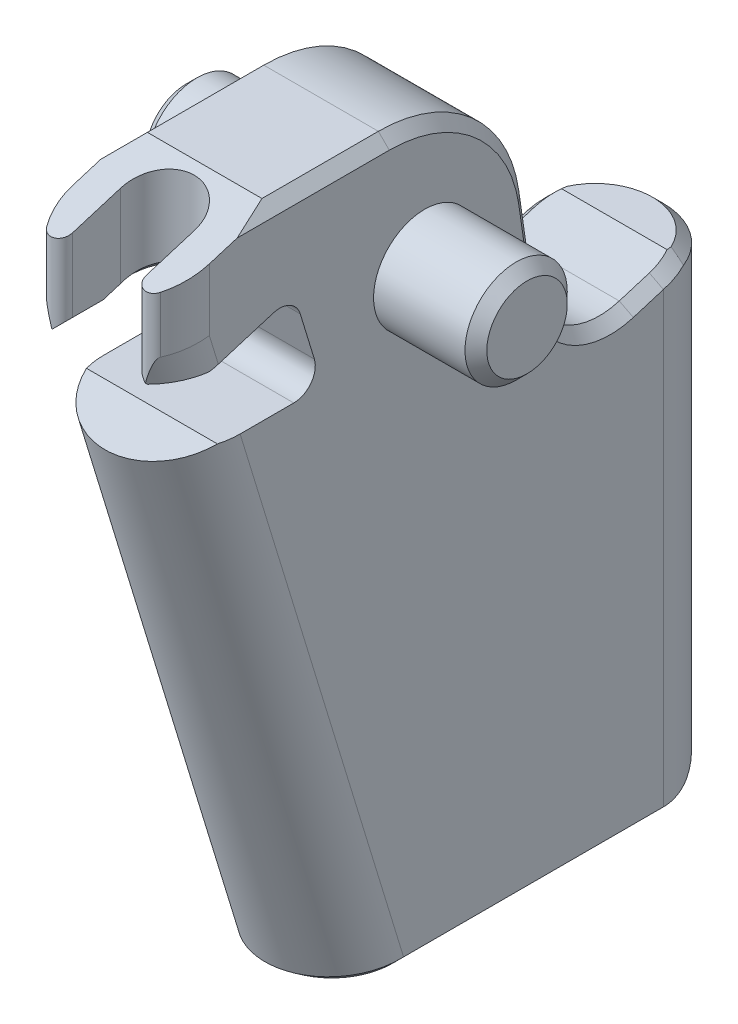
ISO-10303-21;
HEADER;
FILE_DESCRIPTION(('STEP AP214'),'2;1');
FILE_NAME('part.step','',(''),(''),'','','');
FILE_SCHEMA(('AUTOMOTIVE_DESIGN { 1 0 10303 214 1 1 1 1 }'));
ENDSEC;
DATA;
#1=APPLICATION_CONTEXT('core data for automotive mechanical design processes');
#2=APPLICATION_PROTOCOL_DEFINITION('international standard','automotive_design',2000,#1);
#3=PRODUCT_CONTEXT('',#1,'mechanical');
#4=PRODUCT('Part','Part','',(#3));
#5=PRODUCT_RELATED_PRODUCT_CATEGORY('part','',(#4));
#6=PRODUCT_DEFINITION_FORMATION('','',#4);
#7=PRODUCT_DEFINITION_CONTEXT('part definition',#1,'design');
#8=PRODUCT_DEFINITION('design','',#6,#7);
#9=PRODUCT_DEFINITION_SHAPE('','',#8);
#10=(LENGTH_UNIT() NAMED_UNIT(*) SI_UNIT(.MILLI.,.METRE.));
#11=(NAMED_UNIT(*) PLANE_ANGLE_UNIT() SI_UNIT($,.RADIAN.));
#12=(NAMED_UNIT(*) SI_UNIT($,.STERADIAN.) SOLID_ANGLE_UNIT());
#13=UNCERTAINTY_MEASURE_WITH_UNIT(LENGTH_MEASURE(1.E-05),#10,'distance_accuracy_value','');
#14=(GEOMETRIC_REPRESENTATION_CONTEXT(3) GLOBAL_UNCERTAINTY_ASSIGNED_CONTEXT((#13)) GLOBAL_UNIT_ASSIGNED_CONTEXT((#10,
#11,#12)) REPRESENTATION_CONTEXT('',''));
#15=CARTESIAN_POINT('',(0.,0.,0.));
#16=DIRECTION('',(0.,0.,1.));
#17=DIRECTION('',(1.,0.,0.));
#18=AXIS2_PLACEMENT_3D('',#15,#16,#17);
#19=CARTESIAN_POINT('',(3.175,0.767220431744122,6.7528533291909));
#20=DIRECTION('',(1.,0.,0.));
#21=DIRECTION('',(0.,0.,-1.));
#22=AXIS2_PLACEMENT_3D('',#19,#20,#21);
#23=PLANE('',#22);
#24=CARTESIAN_POINT('',(3.175,0.,0.));
#25=DIRECTION('',(1.,0.,0.));
#26=DIRECTION('',(0.,0.,-1.));
#27=AXIS2_PLACEMENT_3D('',#24,#25,#26);
#28=CIRCLE('',#27,2.38125);
#29=CARTESIAN_POINT('',(3.17499999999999,0.,-2.38125000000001));
#30=VERTEX_POINT('',#29);
#31=EDGE_CURVE('P0_E337',#30,#30,#28,.T.);
#32=ORIENTED_EDGE('',*,*,#31,.F.);
#33=EDGE_LOOP('',(#32));
#34=FACE_BOUND('',#33,.T.);
#35=DIRECTION('',(0.,0.956304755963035,0.292371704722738));
#36=VECTOR('',#35,1.);
#37=CARTESIAN_POINT('',(3.17500000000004,4.94524190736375,10.8353133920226));
#38=LINE('',#37,#36);
#39=CARTESIAN_POINT('',(3.175,-2.38125,8.59538002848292));
#40=VERTEX_POINT('',#39);
#41=CARTESIAN_POINT('',(3.175,-27.27325,0.985131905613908));
#42=VERTEX_POINT('',#41);
#43=EDGE_CURVE('P0_E452',#40,#42,#38,.F.);
#44=ORIENTED_EDGE('',*,*,#43,.T.);
#45=DIRECTION('',(0.,0.,-1.));
#46=VECTOR('',#45,1.);
#47=CARTESIAN_POINT('',(3.17499999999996,-27.27325,-11.1125));
#48=LINE('',#47,#46);
#49=CARTESIAN_POINT('',(3.17499999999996,-27.27325,-11.1125));
#50=VERTEX_POINT('',#49);
#51=EDGE_CURVE('P0_E11',#42,#50,#48,.T.);
#52=ORIENTED_EDGE('',*,*,#51,.T.);
#53=DIRECTION('',(0.,-1.,0.));
#54=VECTOR('',#53,1.);
#55=CARTESIAN_POINT('',(3.17499999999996,-27.78125,-11.1125));
#56=LINE('',#55,#54);
#57=CARTESIAN_POINT('',(3.17499999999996,-6.41005598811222,-11.1125));
#58=VERTEX_POINT('',#57);
#59=EDGE_CURVE('P0_E822',#50,#58,#56,.F.);
#60=ORIENTED_EDGE('',*,*,#59,.T.);
#61=DIRECTION('',(0.,-0.292371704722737,0.956304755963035));
#62=VECTOR('',#61,1.);
#63=CARTESIAN_POINT('',(3.17499999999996,-6.83798569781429,-9.71280498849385));
#64=LINE('',#63,#62);
#65=CARTESIAN_POINT('',(3.17499999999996,-6.83798569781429,-9.71280498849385));
#66=VERTEX_POINT('',#65);
#67=EDGE_CURVE('P0_E602',#58,#66,#64,.T.);
#68=ORIENTED_EDGE('',*,*,#67,.T.);
#69=CARTESIAN_POINT('',(3.175,-3.31591528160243,-8.636));
#70=DIRECTION('',(1.,0.,0.));
#71=DIRECTION('',(0.,0.,-1.));
#72=AXIS2_PLACEMENT_3D('',#69,#70,#71);
#73=CIRCLE('',#72,3.683);
#74=CARTESIAN_POINT('',(3.175,-3.84322345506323,-4.99094374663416));
#75=VERTEX_POINT('',#74);
#76=EDGE_CURVE('P0_E977',#66,#75,#73,.F.);
#77=ORIENTED_EDGE('',*,*,#76,.T.);
#78=DIRECTION('',(0.,0.989697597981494,0.143173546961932));
#79=VECTOR('',#78,1.);
#80=CARTESIAN_POINT('',(3.175,0.364785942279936,-4.3821965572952));
#81=LINE('',#80,#79);
#82=CARTESIAN_POINT('',(3.175,0.364785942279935,-4.3821965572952));
#83=VERTEX_POINT('',#82);
#84=EDGE_CURVE('P0_E975',#75,#83,#81,.T.);
#85=ORIENTED_EDGE('',*,*,#84,.T.);
#86=CARTESIAN_POINT('',(3.175,-0.508,1.651));
#87=DIRECTION('',(1.,0.,0.));
#88=DIRECTION('',(0.,0.,-1.));
#89=AXIS2_PLACEMENT_3D('',#86,#87,#88);
#90=CIRCLE('',#89,6.096);
#91=CARTESIAN_POINT('',(3.175,5.588,1.651));
#92=VERTEX_POINT('',#91);
#93=EDGE_CURVE('P0_E606',#83,#92,#90,.T.);
#94=ORIENTED_EDGE('',*,*,#93,.T.);
#95=DIRECTION('',(0.,0.,1.));
#96=VECTOR('',#95,1.);
#97=CARTESIAN_POINT('',(3.175,5.588,7.07135327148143));
#98=LINE('',#97,#96);
#99=CARTESIAN_POINT('',(3.175,5.588,8.73294640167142));
#100=VERTEX_POINT('',#99);
#101=EDGE_CURVE('P0_E597',#92,#100,#98,.T.);
#102=ORIENTED_EDGE('',*,*,#101,.T.);
#103=DIRECTION('',(0.,-0.29237170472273,0.956304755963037));
#104=VECTOR('',#103,1.);
#105=CARTESIAN_POINT('',(3.175,6.096,7.07135327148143));
#106=LINE('',#105,#104);
#107=CARTESIAN_POINT('',(3.17500000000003,5.19214995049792,10.0277135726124));
#108=VERTEX_POINT('',#107);
#109=EDGE_CURVE('P0_E319',#100,#108,#106,.T.);
#110=ORIENTED_EDGE('',*,*,#109,.T.);
#111=DIRECTION('',(0.,1.,0.));
#112=VECTOR('',#111,1.);
#113=CARTESIAN_POINT('',(3.17500000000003,0.81915,10.0277135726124));
#114=LINE('',#113,#112);
#115=CARTESIAN_POINT('',(3.17500000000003,2.30370192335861,10.0277135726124));
#116=VERTEX_POINT('',#115);
#117=EDGE_CURVE('P0_E310',#108,#116,#114,.F.);
#118=ORIENTED_EDGE('',*,*,#117,.T.);
#119=DIRECTION('',(0.,0.956304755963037,0.292371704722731));
#120=VECTOR('',#119,1.);
#121=CARTESIAN_POINT('',(3.175,-32.0081319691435,-0.462466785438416));
#122=LINE('',#121,#120);
#123=CARTESIAN_POINT('',(3.17500000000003,0.939226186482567,9.61055147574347));
#124=VERTEX_POINT('',#123);
#125=EDGE_CURVE('P0_E297',#124,#116,#122,.T.);
#126=ORIENTED_EDGE('',*,*,#125,.F.);
#127=DIRECTION('',(0.,0.292371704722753,-0.956304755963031));
#128=VECTOR('',#127,1.);
#129=CARTESIAN_POINT('',(3.175,1.72352518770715,7.04522503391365));
#130=LINE('',#129,#128);
#131=CARTESIAN_POINT('',(3.175,1.72352518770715,7.04522503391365));
#132=VERTEX_POINT('',#131);
#133=EDGE_CURVE('P0_E307',#124,#132,#130,.T.);
#134=ORIENTED_EDGE('',*,*,#133,.T.);
#135=CARTESIAN_POINT('',(3.175,0.767220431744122,6.7528533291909));
#136=DIRECTION('',(-1.,0.,0.));
#137=DIRECTION('',(0.,0.,-1.));
#138=AXIS2_PLACEMENT_3D('',#135,#136,#137);
#139=CIRCLE('',#138,1.);
#140=CARTESIAN_POINT('',(3.175,1.05959213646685,5.79654857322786));
#141=VERTEX_POINT('',#140);
#142=EDGE_CURVE('P0_E318',#132,#141,#139,.T.);
#143=ORIENTED_EDGE('',*,*,#142,.T.);
#144=DIRECTION('',(0.,-0.956304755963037,-0.292371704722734));
#145=VECTOR('',#144,1.);
#146=CARTESIAN_POINT('',(3.175,-1.08887829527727,5.13969524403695));
#147=LINE('',#146,#145);
#148=CARTESIAN_POINT('',(3.175,-1.08887829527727,5.13969524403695));
#149=VERTEX_POINT('',#148);
#150=EDGE_CURVE('P0_E321',#141,#149,#147,.T.);
#151=ORIENTED_EDGE('',*,*,#150,.T.);
#152=CARTESIAN_POINT('',(3.175,-1.38125,6.096));
#153=DIRECTION('',(-1.,0.,0.));
#154=DIRECTION('',(0.,0.,1.));
#155=AXIS2_PLACEMENT_3D('',#152,#153,#154);
#156=CIRCLE('',#155,1.);
#157=CARTESIAN_POINT('',(3.175,-2.38125,6.096));
#158=VERTEX_POINT('',#157);
#159=EDGE_CURVE('P0_E328',#149,#158,#156,.T.);
#160=ORIENTED_EDGE('',*,*,#159,.T.);
#161=DIRECTION('',(0.,0.,1.));
#162=VECTOR('',#161,1.);
#163=CARTESIAN_POINT('',(3.175,-2.38125,6.096));
#164=LINE('',#163,#162);
#165=EDGE_CURVE('P0_E330',#158,#40,#164,.T.);
#166=ORIENTED_EDGE('',*,*,#165,.T.);
#167=EDGE_LOOP('',(#44,#52,#60,#68,#77,#85,#94,#102,#110,#118,#126,#134,#143,#151,#160,#166));
#168=FACE_BOUND('',#167,.T.);
#169=ADVANCED_FACE('P0_F16',(#34,#168),#23,.T.);
#170=CARTESIAN_POINT('',(-3.175,0.767220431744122,6.75285332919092));
#171=DIRECTION('',(1.,0.,0.));
#172=DIRECTION('',(0.,0.,-1.));
#173=AXIS2_PLACEMENT_3D('',#170,#171,#172);
#174=PLANE('',#173);
#175=DIRECTION('',(0.,1.,0.));
#176=VECTOR('',#175,1.);
#177=CARTESIAN_POINT('',(-3.17500000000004,0.767220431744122,-11.1125));
#178=LINE('',#177,#176);
#179=CARTESIAN_POINT('',(-3.17500000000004,-6.41005598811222,-11.1125));
#180=VERTEX_POINT('',#179);
#181=CARTESIAN_POINT('',(-3.17500000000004,-27.2732500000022,-11.1125));
#182=VERTEX_POINT('',#181);
#183=EDGE_CURVE('P0_E829',#180,#182,#178,.F.);
#184=ORIENTED_EDGE('',*,*,#183,.T.);
#185=DIRECTION('',(0.,0.,1.));
#186=VECTOR('',#185,1.);
#187=CARTESIAN_POINT('',(-3.175,-27.27325,6.75285332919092));
#188=LINE('',#187,#186);
#189=CARTESIAN_POINT('',(-3.175,-27.27325,0.985131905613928));
#190=VERTEX_POINT('',#189);
#191=EDGE_CURVE('P0_E444',#182,#190,#188,.T.);
#192=ORIENTED_EDGE('',*,*,#191,.T.);
#193=DIRECTION('',(0.,-0.956304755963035,-0.292371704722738));
#194=VECTOR('',#193,1.);
#195=CARTESIAN_POINT('',(-3.175,-0.0170785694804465,9.31817977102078));
#196=LINE('',#195,#194);
#197=CARTESIAN_POINT('',(-3.175,-2.38125,8.59538002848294));
#198=VERTEX_POINT('',#197);
#199=EDGE_CURVE('P0_E448',#190,#198,#196,.F.);
#200=ORIENTED_EDGE('',*,*,#199,.T.);
#201=DIRECTION('',(0.,0.,1.));
#202=VECTOR('',#201,1.);
#203=CARTESIAN_POINT('',(-3.175,-2.38125,6.096));
#204=LINE('',#203,#202);
#205=CARTESIAN_POINT('',(-3.175,-2.38125,6.096));
#206=VERTEX_POINT('',#205);
#207=EDGE_CURVE('P0_E323',#206,#198,#204,.T.);
#208=ORIENTED_EDGE('',*,*,#207,.F.);
#209=CARTESIAN_POINT('',(-3.175,-1.38125,6.096));
#210=DIRECTION('',(-1.,0.,0.));
#211=DIRECTION('',(0.,0.,1.));
#212=AXIS2_PLACEMENT_3D('',#209,#210,#211);
#213=CIRCLE('',#212,1.);
#214=CARTESIAN_POINT('',(-3.175,-1.08887829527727,5.13969524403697));
#215=VERTEX_POINT('',#214);
#216=EDGE_CURVE('P0_E343',#215,#206,#213,.T.);
#217=ORIENTED_EDGE('',*,*,#216,.F.);
#218=DIRECTION('',(0.,-0.956304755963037,-0.292371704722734));
#219=VECTOR('',#218,1.);
#220=CARTESIAN_POINT('',(-3.175,-1.08887829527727,5.13969524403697));
#221=LINE('',#220,#219);
#222=CARTESIAN_POINT('',(-3.175,1.05959213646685,5.79654857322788));
#223=VERTEX_POINT('',#222);
#224=EDGE_CURVE('P0_E341',#223,#215,#221,.T.);
#225=ORIENTED_EDGE('',*,*,#224,.F.);
#226=CARTESIAN_POINT('',(-3.175,0.767220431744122,6.75285332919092));
#227=DIRECTION('',(-1.,0.,0.));
#228=DIRECTION('',(0.,0.,-1.));
#229=AXIS2_PLACEMENT_3D('',#226,#227,#228);
#230=CIRCLE('',#229,1.);
#231=CARTESIAN_POINT('',(-3.175,1.72352518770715,7.04522503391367));
#232=VERTEX_POINT('',#231);
#233=EDGE_CURVE('P0_E339',#232,#223,#230,.T.);
#234=ORIENTED_EDGE('',*,*,#233,.F.);
#235=DIRECTION('',(0.,0.292371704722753,-0.956304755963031));
#236=VECTOR('',#235,1.);
#237=CARTESIAN_POINT('',(-3.175,1.72352518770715,7.04522503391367));
#238=LINE('',#237,#236);
#239=CARTESIAN_POINT('',(-3.17499999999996,0.939226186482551,9.61055147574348));
#240=VERTEX_POINT('',#239);
#241=EDGE_CURVE('P0_E336',#240,#232,#238,.T.);
#242=ORIENTED_EDGE('',*,*,#241,.F.);
#243=DIRECTION('',(0.,0.956304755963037,0.292371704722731));
#244=VECTOR('',#243,1.);
#245=CARTESIAN_POINT('',(-3.175,-32.0081319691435,-0.462466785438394));
#246=LINE('',#245,#244);
#247=CARTESIAN_POINT('',(-3.17499999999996,2.30370192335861,10.0277135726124));
#248=VERTEX_POINT('',#247);
#249=EDGE_CURVE('P0_E312',#240,#248,#246,.T.);
#250=ORIENTED_EDGE('',*,*,#249,.T.);
#251=DIRECTION('',(0.,1.,0.));
#252=VECTOR('',#251,1.);
#253=CARTESIAN_POINT('',(-3.17499999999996,0.767220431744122,10.0277135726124));
#254=LINE('',#253,#252);
#255=CARTESIAN_POINT('',(-3.17499999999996,5.19214995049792,10.0277135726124));
#256=VERTEX_POINT('',#255);
#257=EDGE_CURVE('P0_E464',#248,#256,#254,.T.);
#258=ORIENTED_EDGE('',*,*,#257,.T.);
#259=DIRECTION('',(0.,-0.29237170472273,0.956304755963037));
#260=VECTOR('',#259,1.);
#261=CARTESIAN_POINT('',(-3.175,6.096,7.07135327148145));
#262=LINE('',#261,#260);
#263=CARTESIAN_POINT('',(-3.175,5.588,8.73294640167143));
#264=VERTEX_POINT('',#263);
#265=EDGE_CURVE('P0_E334',#264,#256,#262,.T.);
#266=ORIENTED_EDGE('',*,*,#265,.F.);
#267=DIRECTION('',(0.,0.,-1.));
#268=VECTOR('',#267,1.);
#269=CARTESIAN_POINT('',(-3.175,5.588,6.75285332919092));
#270=LINE('',#269,#268);
#271=CARTESIAN_POINT('',(-3.175,5.588,1.651));
#272=VERTEX_POINT('',#271);
#273=EDGE_CURVE('P0_E995',#264,#272,#270,.T.);
#274=ORIENTED_EDGE('',*,*,#273,.T.);
#275=CARTESIAN_POINT('',(-3.175,-0.508,1.651));
#276=DIRECTION('',(1.,0.,0.));
#277=DIRECTION('',(0.,0.,-1.));
#278=AXIS2_PLACEMENT_3D('',#275,#276,#277);
#279=CIRCLE('',#278,6.096);
#280=CARTESIAN_POINT('',(-3.175,0.364785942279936,-4.38219655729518));
#281=VERTEX_POINT('',#280);
#282=EDGE_CURVE('P0_E999',#272,#281,#279,.F.);
#283=ORIENTED_EDGE('',*,*,#282,.T.);
#284=DIRECTION('',(0.,-0.989697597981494,-0.143173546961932));
#285=VECTOR('',#284,1.);
#286=CARTESIAN_POINT('',(-3.175,2.33679110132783,-4.09691853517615));
#287=LINE('',#286,#285);
#288=CARTESIAN_POINT('',(-3.175,-3.84322345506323,-4.99094374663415));
#289=VERTEX_POINT('',#288);
#290=EDGE_CURVE('P0_E1026',#281,#289,#287,.T.);
#291=ORIENTED_EDGE('',*,*,#290,.T.);
#292=CARTESIAN_POINT('',(-3.175,-3.31591528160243,-8.636));
#293=DIRECTION('',(1.,0.,0.));
#294=DIRECTION('',(0.,0.,-1.));
#295=AXIS2_PLACEMENT_3D('',#292,#293,#294);
#296=CIRCLE('',#295,3.683);
#297=CARTESIAN_POINT('',(-3.17500000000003,-6.83798569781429,-9.71280498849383));
#298=VERTEX_POINT('',#297);
#299=EDGE_CURVE('P0_E1027',#289,#298,#296,.T.);
#300=ORIENTED_EDGE('',*,*,#299,.T.);
#301=DIRECTION('',(0.,0.292371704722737,-0.956304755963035));
#302=VECTOR('',#301,1.);
#303=CARTESIAN_POINT('',(-3.175,-10.7916230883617,3.21896022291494));
#304=LINE('',#303,#302);
#305=EDGE_CURVE('P0_E1023',#298,#180,#304,.T.);
#306=ORIENTED_EDGE('',*,*,#305,.T.);
#307=EDGE_LOOP('',(#184,#192,#200,#208,#217,#225,#234,#242,#250,#258,#266,#274,#283,#291,#300,#306));
#308=FACE_BOUND('',#307,.T.);
#309=CARTESIAN_POINT('',(-3.175,0.,0.));
#310=DIRECTION('',(1.,0.,0.));
#311=DIRECTION('',(0.,0.,-1.));
#312=AXIS2_PLACEMENT_3D('',#309,#310,#311);
#313=CIRCLE('',#312,2.38125);
#314=CARTESIAN_POINT('',(-3.17500000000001,0.,-2.38124999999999));
#315=VERTEX_POINT('',#314);
#316=EDGE_CURVE('P0_E382',#315,#315,#313,.T.);
#317=ORIENTED_EDGE('',*,*,#316,.T.);
#318=EDGE_LOOP('',(#317));
#319=FACE_BOUND('',#318,.T.);
#320=ADVANCED_FACE('P0_F394',(#308,#319),#174,.F.);
#321=CARTESIAN_POINT('',(-1.71449999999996,1.32715,12.7));
#322=DIRECTION('',(-0.707106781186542,0.707106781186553,0.));
#323=DIRECTION('',(0.,0.,-1.));
#324=AXIS2_PLACEMENT_3D('',#321,#322,#323);
#325=PLANE('',#324);
#326=CARTESIAN_POINT('',(0.,3.04164999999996,10.253326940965));
#327=DIRECTION('',(-0.707106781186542,0.707106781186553,0.));
#328=DIRECTION('',(0.649038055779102,0.649038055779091,0.396861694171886));
#329=AXIS2_PLACEMENT_3D('',#326,#327,#328);
#330=ELLIPSE('',#329,4.69528989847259,3.175);
#331=CARTESIAN_POINT('',(-2.22249999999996,0.81915,11.9448456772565));
#332=VERTEX_POINT('',#331);
#333=CARTESIAN_POINT('',(-2.17451349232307,0.867136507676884,12.0076817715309));
#334=VERTEX_POINT('',#333);
#335=EDGE_CURVE('P0_E535',#332,#334,#330,.T.);
#336=ORIENTED_EDGE('',*,*,#335,.F.);
#337=DIRECTION('',(0.,0.,1.));
#338=VECTOR('',#337,1.);
#339=CARTESIAN_POINT('',(-2.22249999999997,0.81915,10.0033029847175));
#340=LINE('',#339,#338);
#341=CARTESIAN_POINT('',(-2.22249999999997,0.81915,10.0033029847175));
#342=VERTEX_POINT('',#341);
#343=EDGE_CURVE('P0_E1075',#342,#332,#340,.T.);
#344=ORIENTED_EDGE('',*,*,#343,.F.);
#345=DIRECTION('',(0.703191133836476,0.703191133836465,0.105092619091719));
#346=VECTOR('',#345,1.);
#347=CARTESIAN_POINT('',(-1.52082414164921,1.52082585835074,10.1081691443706));
#348=LINE('',#347,#346);
#349=CARTESIAN_POINT('',(-1.71449999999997,1.32715,10.0792240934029));
#350=VERTEX_POINT('',#349);
#351=EDGE_CURVE('P0_E862',#350,#342,#348,.F.);
#352=ORIENTED_EDGE('',*,*,#351,.F.);
#353=DIRECTION('',(0.,0.,-1.));
#354=VECTOR('',#353,1.);
#355=CARTESIAN_POINT('',(-1.71449999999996,1.32715,12.7));
#356=LINE('',#355,#354);
#357=CARTESIAN_POINT('',(-1.71449999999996,1.32715,11.5019532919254));
#358=VERTEX_POINT('',#357);
#359=EDGE_CURVE('P0_E1286',#358,#350,#356,.T.);
#360=ORIENTED_EDGE('',*,*,#359,.F.);
#361=CARTESIAN_POINT('',(-2.22249999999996,0.81915,11.5019532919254));
#362=DIRECTION('',(-0.707106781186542,0.707106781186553,0.));
#363=DIRECTION('',(0.707106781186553,0.707106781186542,0.));
#364=AXIS2_PLACEMENT_3D('',#361,#362,#363);
#365=ELLIPSE('',#364,0.718420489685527,0.508);
#366=EDGE_CURVE('P0_E835',#358,#334,#365,.F.);
#367=ORIENTED_EDGE('',*,*,#366,.T.);
#368=EDGE_LOOP('',(#336,#344,#352,#360,#367));
#369=FACE_BOUND('',#368,.T.);
#370=ADVANCED_FACE('P0_F419',(#369),#325,.F.);
#371=CARTESIAN_POINT('',(1.71450000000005,1.32715,12.7));
#372=DIRECTION('',(0.707106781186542,0.707106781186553,0.));
#373=DIRECTION('',(0.,0.,1.));
#374=AXIS2_PLACEMENT_3D('',#371,#372,#373);
#375=PLANE('',#374);
#376=CARTESIAN_POINT('',(0.,3.04164999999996,10.253326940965));
#377=DIRECTION('',(0.707106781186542,0.707106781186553,0.));
#378=DIRECTION('',(-0.6490380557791,0.649038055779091,0.396861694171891));
#379=AXIS2_PLACEMENT_3D('',#376,#377,#378);
#380=ELLIPSE('',#379,4.69528989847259,3.175);
#381=CARTESIAN_POINT('',(2.17451349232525,0.867136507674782,12.007681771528));
#382=VERTEX_POINT('',#381);
#383=CARTESIAN_POINT('',(2.22250000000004,0.81915,11.9448456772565));
#384=VERTEX_POINT('',#383);
#385=EDGE_CURVE('P0_E311',#382,#384,#380,.T.);
#386=ORIENTED_EDGE('',*,*,#385,.F.);
#387=CARTESIAN_POINT('',(2.22250000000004,0.81915,11.5019532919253));
#388=DIRECTION('',(0.707106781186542,0.707106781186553,0.));
#389=DIRECTION('',(0.707106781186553,-0.707106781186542,0.));
#390=AXIS2_PLACEMENT_3D('',#387,#388,#389);
#391=ELLIPSE('',#390,0.718420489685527,0.508);
#392=CARTESIAN_POINT('',(1.71450000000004,1.32715,11.5019532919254));
#393=VERTEX_POINT('',#392);
#394=EDGE_CURVE('P0_E501',#382,#393,#391,.F.);
#395=ORIENTED_EDGE('',*,*,#394,.T.);
#396=DIRECTION('',(0.,0.,1.));
#397=VECTOR('',#396,1.);
#398=CARTESIAN_POINT('',(1.71450000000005,1.32715,12.7));
#399=LINE('',#398,#397);
#400=CARTESIAN_POINT('',(1.71450000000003,1.32715,10.0792240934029));
#401=VERTEX_POINT('',#400);
#402=EDGE_CURVE('P0_E375',#401,#393,#399,.T.);
#403=ORIENTED_EDGE('',*,*,#402,.F.);
#404=DIRECTION('',(0.703191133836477,-0.703191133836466,-0.10509261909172));
#405=VECTOR('',#404,1.);
#406=CARTESIAN_POINT('',(1.52082414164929,1.52082585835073,10.1081691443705));
#407=LINE('',#406,#405);
#408=CARTESIAN_POINT('',(2.22250000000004,0.81915,10.0033029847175));
#409=VERTEX_POINT('',#408);
#410=EDGE_CURVE('P0_E848',#409,#401,#407,.F.);
#411=ORIENTED_EDGE('',*,*,#410,.F.);
#412=DIRECTION('',(0.,0.,-1.));
#413=VECTOR('',#412,1.);
#414=CARTESIAN_POINT('',(2.22250000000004,0.81915,10.0033029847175));
#415=LINE('',#414,#413);
#416=EDGE_CURVE('P0_E591',#384,#409,#415,.T.);
#417=ORIENTED_EDGE('',*,*,#416,.F.);
#418=EDGE_LOOP('',(#386,#395,#403,#411,#417));
#419=FACE_BOUND('',#418,.T.);
#420=ADVANCED_FACE('P0_F427',(#419),#375,.F.);
#421=CARTESIAN_POINT('',(3.175,-27.78125,4.1498920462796));
#422=DIRECTION('',(0.,1.,0.));
#423=DIRECTION('',(1.,0.,0.));
#424=AXIS2_PLACEMENT_3D('',#421,#422,#423);
#425=PLANE('',#424);
#426=CARTESIAN_POINT('',(-2.667,-27.78125,0.985131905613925));
#427=CARTESIAN_POINT('',(-2.66701176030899,-27.78125,1.16766338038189));
#428=CARTESIAN_POINT('',(-2.64980847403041,-27.78125,1.35018730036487));
#429=CARTESIAN_POINT('',(-2.58170021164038,-27.78125,1.70823566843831));
#430=CARTESIAN_POINT('',(-2.53078629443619,-27.78125,1.88374529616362));
#431=CARTESIAN_POINT('',(-2.39718713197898,-27.78125,2.22101948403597));
#432=CARTESIAN_POINT('',(-2.31450741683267,-27.78125,2.38277008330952));
#433=CARTESIAN_POINT('',(-2.12055149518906,-27.78125,2.68630883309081));
#434=CARTESIAN_POINT('',(-2.00928331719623,-27.78125,2.82808441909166));
#435=CARTESIAN_POINT('',(-1.76242425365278,-27.78125,3.08622290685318));
#436=CARTESIAN_POINT('',(-1.6268435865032,-27.78125,3.20257512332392));
#437=CARTESIAN_POINT('',(-1.33656803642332,-27.78125,3.40539323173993));
#438=CARTESIAN_POINT('',(-1.18188516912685,-27.78125,3.49185072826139));
#439=CARTESIAN_POINT('',(-0.859348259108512,-27.78125,3.63155427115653));
#440=CARTESIAN_POINT('',(-0.691507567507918,-27.78125,3.68479453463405));
#441=CARTESIAN_POINT('',(-0.349104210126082,-27.78125,3.75601478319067));
#442=CARTESIAN_POINT('',(-0.174555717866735,-27.78125,3.77399182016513));
#443=CARTESIAN_POINT('',(0.174555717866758,-27.78125,3.77399182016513));
#444=CARTESIAN_POINT('',(0.349104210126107,-27.78125,3.75601478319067));
#445=CARTESIAN_POINT('',(0.691507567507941,-27.78125,3.68479453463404));
#446=CARTESIAN_POINT('',(0.859348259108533,-27.78125,3.63155427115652));
#447=CARTESIAN_POINT('',(1.18188516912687,-27.78125,3.49185072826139));
#448=CARTESIAN_POINT('',(1.33656803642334,-27.78125,3.40539323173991));
#449=CARTESIAN_POINT('',(1.62684358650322,-27.78125,3.20257512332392));
#450=CARTESIAN_POINT('',(1.7624242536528,-27.78125,3.08622290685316));
#451=CARTESIAN_POINT('',(2.00928331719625,-27.78125,2.82808441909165));
#452=CARTESIAN_POINT('',(2.12055149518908,-27.78125,2.68630883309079));
#453=CARTESIAN_POINT('',(2.31450741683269,-27.78125,2.38277008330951));
#454=CARTESIAN_POINT('',(2.397187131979,-27.78125,2.22101948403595));
#455=CARTESIAN_POINT('',(2.5307862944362,-27.78125,1.8837452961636));
#456=CARTESIAN_POINT('',(2.5817002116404,-27.78125,1.70823566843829));
#457=CARTESIAN_POINT('',(2.64980847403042,-27.78125,1.35018730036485));
#458=CARTESIAN_POINT('',(2.66701176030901,-27.78125,1.16766338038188));
#459=CARTESIAN_POINT('',(2.667,-27.78125,0.985131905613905));
#460=B_SPLINE_CURVE_WITH_KNOTS('',3,(#426,#427,#428,#429,#430,#431,#432,#433,#434,#435,#436,
#437,#438,#439,#440,#441,#442,#443,#444,#445,#446,#447,#448,#449,#450,#451,#452,#453,#454,#455,
#456,#457,#458,#459),.UNSPECIFIED.,.F.,.F.,(4,2,2,2,2,2,2,2,2,2,2,2,2,2,2,2,4),(1.5707963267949,
1.76714586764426,1.96349540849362,2.15984494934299,2.35619449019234,2.5525440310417,
2.74889357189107,2.94524311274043,3.1415926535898,3.33794219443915,3.53429173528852,
3.73064127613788,3.92699081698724,4.12334035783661,4.31968989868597,4.51603943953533,
4.71238898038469),.UNSPECIFIED.);
#461=CARTESIAN_POINT('',(2.667,-27.78125,0.985131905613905));
#462=VERTEX_POINT('',#461);
#463=CARTESIAN_POINT('',(-2.667,-27.78125,0.985131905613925));
#464=VERTEX_POINT('',#463);
#465=EDGE_CURVE('P0_E445',#462,#464,#460,.F.);
#466=ORIENTED_EDGE('',*,*,#465,.T.);
#467=DIRECTION('',(0.,0.,-1.));
#468=VECTOR('',#467,1.);
#469=CARTESIAN_POINT('',(-2.667,-27.78125,4.14989204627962));
#470=LINE('',#469,#468);
#471=CARTESIAN_POINT('',(-2.66700000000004,-27.78125,-11.1125));
#472=VERTEX_POINT('',#471);
#473=EDGE_CURVE('P0_E436',#464,#472,#470,.T.);
#474=ORIENTED_EDGE('',*,*,#473,.T.);
#475=DIRECTION('',(1.,0.,0.));
#476=VECTOR('',#475,1.);
#477=CARTESIAN_POINT('',(-3.17502500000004,-27.78125,-11.1125));
#478=LINE('',#477,#476);
#479=CARTESIAN_POINT('',(2.66699999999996,-27.78125,-11.1125));
#480=VERTEX_POINT('',#479);
#481=EDGE_CURVE('P0_E587',#480,#472,#478,.F.);
#482=ORIENTED_EDGE('',*,*,#481,.F.);
#483=DIRECTION('',(0.,0.,1.));
#484=VECTOR('',#483,1.);
#485=CARTESIAN_POINT('',(2.667,-27.78125,0.829820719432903));
#486=LINE('',#485,#484);
#487=EDGE_CURVE('P0_E596',#480,#462,#486,.T.);
#488=ORIENTED_EDGE('',*,*,#487,.T.);
#489=EDGE_LOOP('',(#466,#474,#482,#488));
#490=FACE_BOUND('',#489,.T.);
#491=ADVANCED_FACE('P0_F424',(#490),#425,.F.);
#492=CARTESIAN_POINT('',(3.175,1.72352518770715,7.04522503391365));
#493=DIRECTION('',(0.,0.956304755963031,0.292371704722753));
#494=DIRECTION('',(0.,-0.292371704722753,0.956304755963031));
#495=AXIS2_PLACEMENT_3D('',#492,#493,#494);
#496=PLANE('',#495);
#497=ORIENTED_EDGE('',*,*,#133,.F.);
#498=CARTESIAN_POINT('',(0.,0.93922618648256,9.61055147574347));
#499=DIRECTION('',(0.,0.956304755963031,0.292371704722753));
#500=DIRECTION('',(0.,-0.292371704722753,0.956304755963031));
#501=AXIS2_PLACEMENT_3D('',#498,#499,#500);
#502=CIRCLE('',#501,3.175);
#503=CARTESIAN_POINT('',(3.14832542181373,0.81915,10.0033029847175));
#504=VERTEX_POINT('',#503);
#505=EDGE_CURVE('P0_E294',#124,#504,#502,.F.);
#506=ORIENTED_EDGE('',*,*,#505,.T.);
#507=DIRECTION('',(-1.,0.,0.));
#508=VECTOR('',#507,1.);
#509=CARTESIAN_POINT('',(3.17500000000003,0.81915,10.0033029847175));
#510=LINE('',#509,#508);
#511=EDGE_CURVE('P0_E361',#504,#409,#510,.T.);
#512=ORIENTED_EDGE('',*,*,#511,.T.);
#513=DIRECTION('',(0.,0.292371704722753,-0.956304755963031));
#514=VECTOR('',#513,1.);
#515=CARTESIAN_POINT('',(2.22250000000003,1.72352518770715,7.04522503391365));
#516=LINE('',#515,#514);
#517=CARTESIAN_POINT('',(2.22250000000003,1.08844608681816,9.12247517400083));
#518=VERTEX_POINT('',#517);
#519=EDGE_CURVE('P0_E1233',#409,#518,#516,.T.);
#520=ORIENTED_EDGE('',*,*,#519,.T.);
#521=CARTESIAN_POINT('',(-2.22249999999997,1.08844608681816,9.12247517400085));
#522=CARTESIAN_POINT('',(-2.22250980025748,1.13291861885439,8.97701207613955));
#523=CARTESIAN_POINT('',(-2.20817372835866,1.17738931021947,8.83155499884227));
#524=CARTESIAN_POINT('',(-2.15141684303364,1.2646253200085,8.54621886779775));
#525=CARTESIAN_POINT('',(-2.10898857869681,1.30738702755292,8.40635162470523));
#526=CARTESIAN_POINT('',(-1.9976559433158,1.38956155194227,8.13757086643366));
#527=CARTESIAN_POINT('',(-1.92875618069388,1.42897096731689,8.00866847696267));
#528=CARTESIAN_POINT('',(-1.76712624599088,1.50292608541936,7.76677218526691));
#529=CARTESIAN_POINT('',(-1.67440276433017,1.53746872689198,7.65378829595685));
#530=CARTESIAN_POINT('',(-1.46868687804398,1.60036238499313,7.44807240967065));
#531=CARTESIAN_POINT('',(-1.35570298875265,1.62871079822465,7.35534892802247));
#532=CARTESIAN_POINT('',(-1.11380669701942,1.67812602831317,7.19371899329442));
#533=CARTESIAN_POINT('',(-0.984904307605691,1.69919079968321,7.12481923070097));
#534=CARTESIAN_POINT('',(-0.716123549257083,1.7332286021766,7.01348659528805));
#535=CARTESIAN_POINT('',(-0.576256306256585,1.74620022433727,6.97105833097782));
#536=CARTESIAN_POINT('',(-0.290920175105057,1.76355254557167,6.91430144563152));
#537=CARTESIAN_POINT('',(-0.145463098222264,1.76793252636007,6.89997517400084));
#538=CARTESIAN_POINT('',(0.145463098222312,1.76793252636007,6.89997517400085));
#539=CARTESIAN_POINT('',(0.290920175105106,1.76355254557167,6.91430144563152));
#540=CARTESIAN_POINT('',(0.576256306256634,1.74620022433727,6.97105833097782));
#541=CARTESIAN_POINT('',(0.716123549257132,1.7332286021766,7.01348659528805));
#542=CARTESIAN_POINT('',(0.98490430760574,1.69919079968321,7.12481923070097));
#543=CARTESIAN_POINT('',(1.11380669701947,1.67812602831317,7.19371899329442));
#544=CARTESIAN_POINT('',(1.35570298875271,1.62871079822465,7.35534892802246));
#545=CARTESIAN_POINT('',(1.46868687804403,1.60036238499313,7.44807240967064));
#546=CARTESIAN_POINT('',(1.67440276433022,1.53746872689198,7.65378829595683));
#547=CARTESIAN_POINT('',(1.76712624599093,1.50292608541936,7.76677218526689));
#548=CARTESIAN_POINT('',(1.92875618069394,1.42897096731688,8.00866847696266));
#549=CARTESIAN_POINT('',(1.99765594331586,1.38956155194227,8.13757086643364));
#550=CARTESIAN_POINT('',(2.10898857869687,1.30738702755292,8.40635162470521));
#551=CARTESIAN_POINT('',(2.1514168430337,1.2646253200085,8.54621886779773));
#552=CARTESIAN_POINT('',(2.20817372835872,1.17738931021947,8.83155499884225));
#553=CARTESIAN_POINT('',(2.22250980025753,1.13291861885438,8.97701207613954));
#554=CARTESIAN_POINT('',(2.22250000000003,1.08844608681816,9.12247517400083));
#555=B_SPLINE_CURVE_WITH_KNOTS('',3,(#521,#522,#523,#524,#525,#526,#527,#528,#529,#530,#531,
#532,#533,#534,#535,#536,#537,#538,#539,#540,#541,#542,#543,#544,#545,#546,#547,#548,#549,#550,
#551,#552,#553,#554),.UNSPECIFIED.,.F.,.F.,(4,2,2,2,2,2,2,2,2,2,2,2,2,2,2,2,4),
(-1.5707963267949,-1.37444678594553,-1.17809724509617,-0.98174770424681,-0.785398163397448,
-0.589048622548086,-0.392699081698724,-0.196349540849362,0.,0.196349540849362,0.392699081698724,
0.589048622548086,0.785398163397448,0.98174770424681,1.17809724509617,1.37444678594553,
1.5707963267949),.UNSPECIFIED.);
#556=CARTESIAN_POINT('',(0.790271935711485,1.72352518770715,7.04522503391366));
#557=VERTEX_POINT('',#556);
#558=EDGE_CURVE('P0_E1162',#518,#557,#555,.F.);
#559=ORIENTED_EDGE('',*,*,#558,.T.);
#560=DIRECTION('',(-1.,0.,0.));
#561=VECTOR('',#560,1.);
#562=CARTESIAN_POINT('',(3.175,1.72352518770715,7.04522503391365));
#563=LINE('',#562,#561);
#564=EDGE_CURVE('P0_E316',#132,#557,#563,.T.);
#565=ORIENTED_EDGE('',*,*,#564,.F.);
#566=EDGE_LOOP('',(#497,#506,#512,#520,#559,#565));
#567=FACE_BOUND('',#566,.T.);
#568=ADVANCED_FACE('P0_F314',(#567),#496,.F.);
#569=CARTESIAN_POINT('',(0.,4.94524190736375,10.8353133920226));
#570=DIRECTION('',(0.,-0.956304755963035,-0.292371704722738));
#571=DIRECTION('',(0.,0.292371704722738,-0.956304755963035));
#572=AXIS2_PLACEMENT_3D('',#569,#570,#571);
#573=CYLINDRICAL_SURFACE('',#572,3.175);
#574=ORIENTED_EDGE('',*,*,#199,.F.);
#575=CARTESIAN_POINT('',(3.175,-27.27325,0.985131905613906));
#576=CARTESIAN_POINT('',(3.17501400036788,-27.2829709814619,1.19945927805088));
#577=CARTESIAN_POINT('',(3.15453389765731,-27.2926915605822,1.4137777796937));
#578=CARTESIAN_POINT('',(3.07345263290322,-27.3117599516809,1.83419604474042));
#579=CARTESIAN_POINT('',(3.01284082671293,-27.3211069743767,2.0402784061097));
#580=CARTESIAN_POINT('',(2.85379420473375,-27.3390690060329,2.43630375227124));
#581=CARTESIAN_POINT('',(2.75536597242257,-27.3476832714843,2.62623034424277));
#582=CARTESIAN_POINT('',(2.52446606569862,-27.3638486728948,2.98264373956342));
#583=CARTESIAN_POINT('',(2.39200394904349,-27.3713991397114,3.14911578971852));
#584=CARTESIAN_POINT('',(2.09812411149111,-27.3851466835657,3.45222046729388));
#585=CARTESIAN_POINT('',(1.9367185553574,-27.3913431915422,3.58884054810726));
#586=CARTESIAN_POINT('',(1.59115242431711,-27.4021445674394,3.8269883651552));
#587=CARTESIAN_POINT('',(1.40700615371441,-27.4067489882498,3.92850624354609));
#588=CARTESIAN_POINT('',(1.02303364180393,-27.4141891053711,4.09254531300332));
#589=CARTESIAN_POINT('',(0.823223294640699,-27.4170244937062,4.15505971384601));
#590=CARTESIAN_POINT('',(0.415600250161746,-27.4208174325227,4.23868610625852));
#591=CARTESIAN_POINT('',(0.207804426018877,-27.4217748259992,4.25979463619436));
#592=CARTESIAN_POINT('',(-0.207804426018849,-27.4217748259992,4.25979463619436));
#593=CARTESIAN_POINT('',(-0.415600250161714,-27.4208174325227,4.23868610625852));
#594=CARTESIAN_POINT('',(-0.823223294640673,-27.4170244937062,4.15505971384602));
#595=CARTESIAN_POINT('',(-1.02303364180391,-27.4141891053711,4.09254531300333));
#596=CARTESIAN_POINT('',(-1.40700615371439,-27.4067489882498,3.9285062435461));
#597=CARTESIAN_POINT('',(-1.59115242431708,-27.4021445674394,3.82698836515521));
#598=CARTESIAN_POINT('',(-1.93671855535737,-27.3913431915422,3.58884054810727));
#599=CARTESIAN_POINT('',(-2.09812411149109,-27.3851466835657,3.4522204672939));
#600=CARTESIAN_POINT('',(-2.39200394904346,-27.3713991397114,3.14911578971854));
#601=CARTESIAN_POINT('',(-2.52446606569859,-27.3638486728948,2.98264373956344));
#602=CARTESIAN_POINT('',(-2.75536597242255,-27.3476832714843,2.62623034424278));
#603=CARTESIAN_POINT('',(-2.85379420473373,-27.3390690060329,2.43630375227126));
#604=CARTESIAN_POINT('',(-3.01284082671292,-27.3211069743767,2.04027840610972));
#605=CARTESIAN_POINT('',(-3.07345263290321,-27.3117599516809,1.83419604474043));
#606=CARTESIAN_POINT('',(-3.15453389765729,-27.2926915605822,1.41377777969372));
#607=CARTESIAN_POINT('',(-3.17501400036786,-27.2829709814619,1.19945927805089));
#608=CARTESIAN_POINT('',(-3.175,-27.27325,0.985131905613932));
#609=B_SPLINE_CURVE_WITH_KNOTS('',3,(#575,#576,#577,#578,#579,#580,#581,#582,#583,#584,#585,
#586,#587,#588,#589,#590,#591,#592,#593,#594,#595,#596,#597,#598,#599,#600,#601,#602,#603,#604,
#605,#606,#607,#608),.UNSPECIFIED.,.F.,.F.,(4,2,2,2,2,2,2,2,2,2,2,2,2,2,2,2,4),
(1.57079632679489,1.76714586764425,1.96349540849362,2.15984494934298,2.35619449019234,
2.5525440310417,2.74889357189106,2.94524311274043,3.14159265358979,3.33794219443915,
3.53429173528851,3.73064127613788,3.92699081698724,4.1233403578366,4.31968989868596,
4.51603943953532,4.71238898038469),.UNSPECIFIED.);
#610=EDGE_CURVE('P0_E43',#190,#42,#609,.F.);
#611=ORIENTED_EDGE('',*,*,#610,.T.);
#612=ORIENTED_EDGE('',*,*,#43,.F.);
#613=CARTESIAN_POINT('',(0.,-2.38125,8.59538002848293));
#614=DIRECTION('',(0.,-1.,0.));
#615=DIRECTION('',(0.,0.,-1.));
#616=AXIS2_PLACEMENT_3D('',#613,#614,#615);
#617=ELLIPSE('',#616,3.3200713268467,3.175);
#618=CARTESIAN_POINT('',(3.04800000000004,-2.38125,9.525));
#619=VERTEX_POINT('',#618);
#620=EDGE_CURVE('P0_E451',#619,#40,#617,.F.);
#621=ORIENTED_EDGE('',*,*,#620,.F.);
#622=CARTESIAN_POINT('',(0.,-2.12133155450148,8.67484507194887));
#623=DIRECTION('',(0.,-0.95630475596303,-0.292371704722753));
#624=DIRECTION('',(0.,0.292371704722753,-0.956304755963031));
#625=AXIS2_PLACEMENT_3D('',#622,#623,#624);
#626=CIRCLE('',#625,3.175);
#627=CARTESIAN_POINT('',(-3.04799999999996,-2.38125,9.525));
#628=VERTEX_POINT('',#627);
#629=EDGE_CURVE('P0_E462',#628,#619,#626,.F.);
#630=ORIENTED_EDGE('',*,*,#629,.F.);
#631=CARTESIAN_POINT('',(0.,-2.38125,8.59538002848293));
#632=DIRECTION('',(0.,-1.,0.));
#633=DIRECTION('',(0.,0.,-1.));
#634=AXIS2_PLACEMENT_3D('',#631,#632,#633);
#635=ELLIPSE('',#634,3.3200713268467,3.175);
#636=EDGE_CURVE('P0_E459',#198,#628,#635,.F.);
#637=ORIENTED_EDGE('',*,*,#636,.F.);
#638=EDGE_LOOP('',(#574,#611,#612,#621,#630,#637));
#639=FACE_BOUND('',#638,.T.);
#640=ADVANCED_FACE('P0_F1417',(#639),#573,.T.);
#641=CARTESIAN_POINT('',(0.,-27.78125,-11.1125));
#642=DIRECTION('',(0.,1.,0.));
#643=DIRECTION('',(1.,0.,0.));
#644=AXIS2_PLACEMENT_3D('',#641,#642,#643);
#645=CYLINDRICAL_SURFACE('',#644,3.175);
#646=CARTESIAN_POINT('',(0.,-24.60625,-14.2875));
#647=CARTESIAN_POINT('',(0.207804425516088,-24.7808057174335,-14.2875140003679));
#648=CARTESIAN_POINT('',(0.415600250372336,-24.9553542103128,-14.2670338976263));
#649=CARTESIAN_POINT('',(0.823223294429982,-25.2977575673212,-14.1859526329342));
#650=CARTESIAN_POINT('',(1.02303364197,-25.4655982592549,-14.1253408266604));
#651=CARTESIAN_POINT('',(1.40700615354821,-25.7881351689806,-13.9662942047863));
#652=CARTESIAN_POINT('',(1.59115242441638,-25.9428180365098,-13.867865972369));
#653=CARTESIAN_POINT('',(1.93671855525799,-26.2330935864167,-13.6369660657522));
#654=CARTESIAN_POINT('',(2.0981241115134,-26.3686742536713,-13.5045039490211));
#655=CARTESIAN_POINT('',(2.39200394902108,-26.6155333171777,-13.2106241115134));
#656=CARTESIAN_POINT('',(2.52446606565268,-26.7268014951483,-13.0492185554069));
#657=CARTESIAN_POINT('',(2.75536597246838,-26.9207574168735,-12.7036524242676));
#658=CARTESIAN_POINT('',(2.85379420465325,-27.0034371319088,-12.5195061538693));
#659=CARTESIAN_POINT('',(3.01284082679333,-27.1370362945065,-12.135533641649));
#660=CARTESIAN_POINT('',(3.07345263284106,-27.1879502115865,-11.9357232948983));
#661=CARTESIAN_POINT('',(3.15453389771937,-27.2560584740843,-11.5281002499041));
#662=CARTESIAN_POINT('',(3.17501400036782,-27.273261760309,-11.3203044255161));
#663=CARTESIAN_POINT('',(3.17499999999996,-27.27325,-11.1125));
#664=B_SPLINE_CURVE_WITH_KNOTS('',3,(#646,#647,#648,#649,#650,#651,#652,#653,#654,#655,#656,
#657,#658,#659,#660,#661,#662,#663),.UNSPECIFIED.,.F.,.F.,(4,2,2,2,2,2,2,2,4),(0.,
0.196349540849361,0.392699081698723,0.589048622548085,0.785398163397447,0.981747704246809,
1.17809724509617,1.37444678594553,1.5707963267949),.UNSPECIFIED.);
#665=CARTESIAN_POINT('',(0.,-24.60625,-14.2875));
#666=VERTEX_POINT('',#665);
#667=EDGE_CURVE('P0_E798',#50,#666,#664,.F.);
#668=ORIENTED_EDGE('',*,*,#667,.T.);
#669=CARTESIAN_POINT('',(-3.17500000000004,-27.27325,-11.1125));
#670=CARTESIAN_POINT('',(-3.1750140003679,-27.273261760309,-11.3203044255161));
#671=CARTESIAN_POINT('',(-3.15453389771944,-27.2560584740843,-11.5281002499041));
#672=CARTESIAN_POINT('',(-3.07345263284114,-27.1879502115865,-11.9357232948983));
#673=CARTESIAN_POINT('',(-3.01284082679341,-27.1370362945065,-12.135533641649));
#674=CARTESIAN_POINT('',(-2.85379420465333,-27.0034371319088,-12.5195061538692));
#675=CARTESIAN_POINT('',(-2.75536597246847,-26.9207574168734,-12.7036524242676));
#676=CARTESIAN_POINT('',(-2.52446606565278,-26.7268014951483,-13.0492185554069));
#677=CARTESIAN_POINT('',(-2.39200394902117,-26.6155333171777,-13.2106241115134));
#678=CARTESIAN_POINT('',(-2.09812411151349,-26.3686742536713,-13.5045039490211));
#679=CARTESIAN_POINT('',(-1.93671855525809,-26.2330935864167,-13.6369660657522));
#680=CARTESIAN_POINT('',(-1.59115242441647,-25.9428180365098,-13.867865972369));
#681=CARTESIAN_POINT('',(-1.40700615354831,-25.7881351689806,-13.9662942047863));
#682=CARTESIAN_POINT('',(-1.0230336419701,-25.4655982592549,-14.1253408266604));
#683=CARTESIAN_POINT('',(-0.823223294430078,-25.2977575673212,-14.1859526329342));
#684=CARTESIAN_POINT('',(-0.415600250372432,-24.9553542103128,-14.2670338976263));
#685=CARTESIAN_POINT('',(-0.207804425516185,-24.7808057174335,-14.2875140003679));
#686=CARTESIAN_POINT('',(0.,-24.60625,-14.2875));
#687=B_SPLINE_CURVE_WITH_KNOTS('',3,(#669,#670,#671,#672,#673,#674,#675,#676,#677,#678,#679,
#680,#681,#682,#683,#684,#685,#686),.UNSPECIFIED.,.F.,.F.,(4,2,2,2,2,2,2,2,4),(3.14159265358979,
3.33794219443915,3.53429173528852,3.73064127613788,3.92699081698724,4.1233403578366,
4.31968989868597,4.51603943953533,4.71238898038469),.UNSPECIFIED.);
#688=EDGE_CURVE('P0_E29',#666,#182,#687,.F.);
#689=ORIENTED_EDGE('',*,*,#688,.T.);
#690=ORIENTED_EDGE('',*,*,#183,.F.);
#691=CARTESIAN_POINT('',(-2.83581647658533,-6.04117019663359,-12.5488941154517));
#692=CARTESIAN_POINT('',(-2.85709106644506,-6.0534168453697,-12.5012072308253));
#693=CARTESIAN_POINT('',(-2.87836565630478,-6.06566349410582,-12.4535203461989));
#694=CARTESIAN_POINT('',(-2.89964024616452,-6.07791014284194,-12.4058334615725));
#695=CARTESIAN_POINT('',(-2.99009380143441,-6.12997943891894,-12.2030822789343));
#696=CARTESIAN_POINT('',(-3.05916518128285,-6.184494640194,-11.9908070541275));
#697=CARTESIAN_POINT('',(-3.15162909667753,-6.29602693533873,-11.5565145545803));
#698=CARTESIAN_POINT('',(-3.17501823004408,-6.3530399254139,-11.334513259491));
#699=CARTESIAN_POINT('',(-3.17500000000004,-6.41005598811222,-11.1125));
#700=B_SPLINE_CURVE_WITH_KNOTS('',3,(#691,#692,#693,#694,#695,#696,#697,#698,#699),
.UNSPECIFIED.,.F.,.F.,(4,3,2,4),(4.71238898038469,4.76172780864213,4.97150258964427,
5.18127737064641),.UNSPECIFIED.);
#701=CARTESIAN_POINT('',(-2.95991173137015,-6.11505,-12.2612156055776));
#702=VERTEX_POINT('',#701);
#703=EDGE_CURVE('P0_E695',#180,#702,#700,.F.);
#704=ORIENTED_EDGE('',*,*,#703,.T.);
#705=CARTESIAN_POINT('',(0.,-6.11505,-11.1125));
#706=DIRECTION('',(0.,-1.,0.));
#707=DIRECTION('',(-1.,0.,0.));
#708=AXIS2_PLACEMENT_3D('',#705,#706,#707);
#709=CIRCLE('',#708,3.175);
#710=CARTESIAN_POINT('',(2.95991172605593,-6.11505006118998,-12.2612156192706));
#711=VERTEX_POINT('',#710);
#712=EDGE_CURVE('P0_E759',#702,#711,#709,.T.);
#713=ORIENTED_EDGE('',*,*,#712,.T.);
#714=CARTESIAN_POINT('',(3.17499999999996,-6.41005598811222,-11.1125));
#715=CARTESIAN_POINT('',(3.175018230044,-6.3530399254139,-11.334513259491));
#716=CARTESIAN_POINT('',(3.15162909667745,-6.29602693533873,-11.5565145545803));
#717=CARTESIAN_POINT('',(3.05916518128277,-6.184494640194,-11.9908070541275));
#718=CARTESIAN_POINT('',(2.99009380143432,-6.12997943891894,-12.2030822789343));
#719=CARTESIAN_POINT('',(2.89964024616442,-6.07791014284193,-12.4058334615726));
#720=CARTESIAN_POINT('',(2.8783656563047,-6.06566349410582,-12.453520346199));
#721=CARTESIAN_POINT('',(2.85709106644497,-6.0534168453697,-12.5012072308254));
#722=CARTESIAN_POINT('',(2.83581647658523,-6.04117019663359,-12.5488941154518));
#723=B_SPLINE_CURVE_WITH_KNOTS('',3,(#714,#715,#716,#717,#718,#719,#720,#721,#722),
.UNSPECIFIED.,.F.,.F.,(4,2,3,4),(1.10190793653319,1.31168271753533,1.52145749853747,
1.5707963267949),.UNSPECIFIED.);
#724=EDGE_CURVE('P0_E753',#711,#58,#723,.F.);
#725=ORIENTED_EDGE('',*,*,#724,.T.);
#726=ORIENTED_EDGE('',*,*,#59,.F.);
#727=EDGE_LOOP('',(#668,#689,#690,#704,#713,#725,#726));
#728=FACE_BOUND('',#727,.T.);
#729=ADVANCED_FACE('P0_F1414',(#728),#645,.T.);
#730=CARTESIAN_POINT('',(3.17500000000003,0.81915,10.0033029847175));
#731=DIRECTION('',(0.,1.,0.));
#732=DIRECTION('',(0.,0.,1.));
#733=AXIS2_PLACEMENT_3D('',#730,#731,#732);
#734=PLANE('',#733);
#735=ORIENTED_EDGE('',*,*,#343,.T.);
#736=CARTESIAN_POINT('',(0.,0.81915,9.57384050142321));
#737=DIRECTION('',(0.,1.,0.));
#738=DIRECTION('',(0.,0.,1.));
#739=AXIS2_PLACEMENT_3D('',#736,#737,#738);
#740=ELLIPSE('',#739,3.32007132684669,3.175);
#741=CARTESIAN_POINT('',(-3.14832542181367,0.81915,10.0033029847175));
#742=VERTEX_POINT('',#741);
#743=EDGE_CURVE('P0_E841',#332,#742,#740,.F.);
#744=ORIENTED_EDGE('',*,*,#743,.T.);
#745=EDGE_CURVE('P0_E368',#342,#742,#510,.T.);
#746=ORIENTED_EDGE('',*,*,#745,.F.);
#747=EDGE_LOOP('',(#735,#744,#746));
#748=FACE_BOUND('',#747,.T.);
#749=ADVANCED_FACE('P0_F1422',(#748),#734,.F.);
#750=CARTESIAN_POINT('',(3.17499999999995,6.096,-14.2875));
#751=DIRECTION('',(0.,-1.,0.));
#752=DIRECTION('',(0.,0.,-1.));
#753=AXIS2_PLACEMENT_3D('',#750,#751,#752);
#754=PLANE('',#753);
#755=DIRECTION('',(1.,0.,0.));
#756=VECTOR('',#755,1.);
#757=CARTESIAN_POINT('',(-3.175,6.096,1.651));
#758=LINE('',#757,#756);
#759=CARTESIAN_POINT('',(-2.667,6.096,1.651));
#760=VERTEX_POINT('',#759);
#761=CARTESIAN_POINT('',(2.667,6.096,1.651));
#762=VERTEX_POINT('',#761);
#763=EDGE_CURVE('P0_E859',#760,#762,#758,.T.);
#764=ORIENTED_EDGE('',*,*,#763,.F.);
#765=DIRECTION('',(0.,0.,1.));
#766=VECTOR('',#765,1.);
#767=CARTESIAN_POINT('',(-2.66700000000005,6.096,-14.2875));
#768=LINE('',#767,#766);
#769=CARTESIAN_POINT('',(-2.667,6.096,7.07135327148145));
#770=VERTEX_POINT('',#769);
#771=EDGE_CURVE('P0_E1050',#760,#770,#768,.T.);
#772=ORIENTED_EDGE('',*,*,#771,.T.);
#773=DIRECTION('',(-1.,0.,0.));
#774=VECTOR('',#773,1.);
#775=CARTESIAN_POINT('',(3.175,6.096,7.07135327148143));
#776=LINE('',#775,#774);
#777=CARTESIAN_POINT('',(2.667,6.096,7.07135327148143));
#778=VERTEX_POINT('',#777);
#779=EDGE_CURVE('P0_E830',#778,#770,#776,.T.);
#780=ORIENTED_EDGE('',*,*,#779,.F.);
#781=DIRECTION('',(0.,0.,-1.));
#782=VECTOR('',#781,1.);
#783=CARTESIAN_POINT('',(2.667,6.096,1.651));
#784=LINE('',#783,#782);
#785=EDGE_CURVE('P0_E1051',#778,#762,#784,.T.);
#786=ORIENTED_EDGE('',*,*,#785,.T.);
#787=EDGE_LOOP('',(#764,#772,#780,#786));
#788=FACE_BOUND('',#787,.T.);
#789=ADVANCED_FACE('P0_F1048',(#788),#754,.F.);
#790=CARTESIAN_POINT('',(3.175,6.096,7.07135327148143));
#791=DIRECTION('',(0.,-0.956304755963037,-0.29237170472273));
#792=DIRECTION('',(0.,0.29237170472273,-0.956304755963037));
#793=AXIS2_PLACEMENT_3D('',#790,#791,#792);
#794=PLANE('',#793);
#795=ORIENTED_EDGE('',*,*,#779,.T.);
#796=DIRECTION('',(0.28062359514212,0.280623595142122,-0.917878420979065));
#797=VECTOR('',#796,1.);
#798=CARTESIAN_POINT('',(2.83457802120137,11.5975780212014,-10.9234976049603));
#799=LINE('',#798,#797);
#800=EDGE_CURVE('P0_E1030',#770,#264,#799,.F.);
#801=ORIENTED_EDGE('',*,*,#800,.T.);
#802=ORIENTED_EDGE('',*,*,#265,.T.);
#803=CARTESIAN_POINT('',(0.,5.19214995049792,10.0277135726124));
#804=DIRECTION('',(0.,-0.956304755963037,-0.29237170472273));
#805=DIRECTION('',(0.,0.29237170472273,-0.956304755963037));
#806=AXIS2_PLACEMENT_3D('',#803,#804,#805);
#807=ELLIPSE('',#806,3.32007132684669,3.175);
#808=CARTESIAN_POINT('',(-2.64583333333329,4.65557814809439,11.7827608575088));
#809=VERTEX_POINT('',#808);
#810=EDGE_CURVE('P0_E469',#256,#809,#807,.F.);
#811=ORIENTED_EDGE('',*,*,#810,.T.);
#812=CARTESIAN_POINT('',(-2.22249999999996,4.74142963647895,11.5019532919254));
#813=DIRECTION('',(0.,-0.956304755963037,-0.29237170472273));
#814=DIRECTION('',(0.,0.29237170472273,-0.956304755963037));
#815=AXIS2_PLACEMENT_3D('',#812,#813,#814);
#816=ELLIPSE('',#815,0.53121141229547,0.508);
#817=CARTESIAN_POINT('',(-1.71449999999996,4.74142963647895,11.5019532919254));
#818=VERTEX_POINT('',#817);
#819=EDGE_CURVE('P0_E477',#809,#818,#816,.F.);
#820=ORIENTED_EDGE('',*,*,#819,.T.);
#821=DIRECTION('',(0.,-0.29237170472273,0.956304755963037));
#822=VECTOR('',#821,1.);
#823=CARTESIAN_POINT('',(-1.71449999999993,1.62629641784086,21.691094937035));
#824=LINE('',#823,#822);
#825=CARTESIAN_POINT('',(-1.71449999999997,5.42350050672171,9.271));
#826=VERTEX_POINT('',#825);
#827=EDGE_CURVE('P0_E865',#826,#818,#824,.T.);
#828=ORIENTED_EDGE('',*,*,#827,.F.);
#829=CARTESIAN_POINT('',(0.,5.42350050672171,9.271));
#830=DIRECTION('',(0.,-0.956304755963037,-0.29237170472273));
#831=DIRECTION('',(0.,0.29237170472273,-0.956304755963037));
#832=AXIS2_PLACEMENT_3D('',#829,#830,#831);
#833=ELLIPSE('',#832,1.79283851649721,1.7145);
#834=CARTESIAN_POINT('',(1.71450000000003,5.42350050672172,9.271));
#835=VERTEX_POINT('',#834);
#836=EDGE_CURVE('P0_E866',#835,#826,#833,.F.);
#837=ORIENTED_EDGE('',*,*,#836,.F.);
#838=DIRECTION('',(0.,0.29237170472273,-0.956304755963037));
#839=VECTOR('',#838,1.);
#840=CARTESIAN_POINT('',(1.71450000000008,1.62629641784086,21.691094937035));
#841=LINE('',#840,#839);
#842=CARTESIAN_POINT('',(1.71450000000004,4.74142963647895,11.5019532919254));
#843=VERTEX_POINT('',#842);
#844=EDGE_CURVE('P0_E863',#843,#835,#841,.T.);
#845=ORIENTED_EDGE('',*,*,#844,.F.);
#846=CARTESIAN_POINT('',(2.22250000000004,4.74142963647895,11.5019532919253));
#847=DIRECTION('',(0.,-0.956304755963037,-0.29237170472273));
#848=DIRECTION('',(0.,-0.29237170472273,0.956304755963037));
#849=AXIS2_PLACEMENT_3D('',#846,#847,#848);
#850=ELLIPSE('',#849,0.53121141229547,0.508);
#851=CARTESIAN_POINT('',(2.64583333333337,4.65557814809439,11.7827608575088));
#852=VERTEX_POINT('',#851);
#853=EDGE_CURVE('P0_E491',#843,#852,#850,.F.);
#854=ORIENTED_EDGE('',*,*,#853,.T.);
#855=CARTESIAN_POINT('',(0.,5.19214995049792,10.0277135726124));
#856=DIRECTION('',(0.,-0.956304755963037,-0.29237170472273));
#857=DIRECTION('',(0.,-0.29237170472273,0.956304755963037));
#858=AXIS2_PLACEMENT_3D('',#855,#856,#857);
#859=ELLIPSE('',#858,3.32007132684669,3.175);
#860=EDGE_CURVE('P0_E467',#852,#108,#859,.F.);
#861=ORIENTED_EDGE('',*,*,#860,.T.);
#862=ORIENTED_EDGE('',*,*,#109,.F.);
#863=DIRECTION('',(-0.280623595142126,0.280623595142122,-0.917878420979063));
#864=VECTOR('',#863,1.);
#865=CARTESIAN_POINT('',(2.6649709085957,6.09802909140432,7.06471641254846));
#866=LINE('',#865,#864);
#867=EDGE_CURVE('P0_E988',#100,#778,#866,.T.);
#868=ORIENTED_EDGE('',*,*,#867,.T.);
#869=EDGE_LOOP('',(#795,#801,#802,#811,#820,#828,#837,#845,#854,#861,#862,#868));
#870=FACE_BOUND('',#869,.T.);
#871=ADVANCED_FACE('P0_F475',(#870),#794,.F.);
#872=ORIENTED_EDGE('',*,*,#511,.F.);
#873=CARTESIAN_POINT('',(0.,0.81915,9.57384050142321));
#874=DIRECTION('',(0.,1.,0.));
#875=DIRECTION('',(0.,0.,1.));
#876=AXIS2_PLACEMENT_3D('',#873,#874,#875);
#877=ELLIPSE('',#876,3.32007132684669,3.175);
#878=EDGE_CURVE('P0_E300',#504,#384,#877,.F.);
#879=ORIENTED_EDGE('',*,*,#878,.T.);
#880=ORIENTED_EDGE('',*,*,#416,.T.);
#881=EDGE_LOOP('',(#872,#879,#880));
#882=FACE_BOUND('',#881,.T.);
#883=ADVANCED_FACE('P0_F1068',(#882),#734,.F.);
#884=ORIENTED_EDGE('',*,*,#745,.T.);
#885=CARTESIAN_POINT('',(0.,0.93922618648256,9.61055147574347));
#886=DIRECTION('',(0.,0.956304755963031,0.292371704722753));
#887=DIRECTION('',(0.,-0.292371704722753,0.956304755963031));
#888=AXIS2_PLACEMENT_3D('',#885,#886,#887);
#889=CIRCLE('',#888,3.175);
#890=EDGE_CURVE('P0_E843',#742,#240,#889,.F.);
#891=ORIENTED_EDGE('',*,*,#890,.T.);
#892=ORIENTED_EDGE('',*,*,#241,.T.);
#893=CARTESIAN_POINT('',(-0.790271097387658,1.72352518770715,7.04522503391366));
#894=VERTEX_POINT('',#893);
#895=EDGE_CURVE('P0_E358',#894,#232,#563,.T.);
#896=ORIENTED_EDGE('',*,*,#895,.F.);
#897=CARTESIAN_POINT('',(-2.22249999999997,1.08844608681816,9.12247517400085));
#898=CARTESIAN_POINT('',(-2.22250980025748,1.13291861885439,8.97701207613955));
#899=CARTESIAN_POINT('',(-2.20817372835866,1.17738931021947,8.83155499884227));
#900=CARTESIAN_POINT('',(-2.15141684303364,1.2646253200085,8.54621886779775));
#901=CARTESIAN_POINT('',(-2.10898857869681,1.30738702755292,8.40635162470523));
#902=CARTESIAN_POINT('',(-1.9976559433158,1.38956155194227,8.13757086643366));
#903=CARTESIAN_POINT('',(-1.92875618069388,1.42897096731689,8.00866847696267));
#904=CARTESIAN_POINT('',(-1.76712624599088,1.50292608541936,7.76677218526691));
#905=CARTESIAN_POINT('',(-1.67440276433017,1.53746872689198,7.65378829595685));
#906=CARTESIAN_POINT('',(-1.46868687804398,1.60036238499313,7.44807240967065));
#907=CARTESIAN_POINT('',(-1.35570298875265,1.62871079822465,7.35534892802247));
#908=CARTESIAN_POINT('',(-1.11380669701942,1.67812602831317,7.19371899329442));
#909=CARTESIAN_POINT('',(-0.984904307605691,1.69919079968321,7.12481923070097));
#910=CARTESIAN_POINT('',(-0.716123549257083,1.7332286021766,7.01348659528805));
#911=CARTESIAN_POINT('',(-0.576256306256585,1.74620022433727,6.97105833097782));
#912=CARTESIAN_POINT('',(-0.290920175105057,1.76355254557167,6.91430144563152));
#913=CARTESIAN_POINT('',(-0.145463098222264,1.76793252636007,6.89997517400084));
#914=CARTESIAN_POINT('',(0.145463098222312,1.76793252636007,6.89997517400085));
#915=CARTESIAN_POINT('',(0.290920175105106,1.76355254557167,6.91430144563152));
#916=CARTESIAN_POINT('',(0.576256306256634,1.74620022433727,6.97105833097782));
#917=CARTESIAN_POINT('',(0.716123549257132,1.7332286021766,7.01348659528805));
#918=CARTESIAN_POINT('',(0.98490430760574,1.69919079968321,7.12481923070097));
#919=CARTESIAN_POINT('',(1.11380669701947,1.67812602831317,7.19371899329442));
#920=CARTESIAN_POINT('',(1.35570298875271,1.62871079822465,7.35534892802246));
#921=CARTESIAN_POINT('',(1.46868687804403,1.60036238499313,7.44807240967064));
#922=CARTESIAN_POINT('',(1.67440276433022,1.53746872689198,7.65378829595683));
#923=CARTESIAN_POINT('',(1.76712624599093,1.50292608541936,7.76677218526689));
#924=CARTESIAN_POINT('',(1.92875618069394,1.42897096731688,8.00866847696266));
#925=CARTESIAN_POINT('',(1.99765594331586,1.38956155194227,8.13757086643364));
#926=CARTESIAN_POINT('',(2.10898857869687,1.30738702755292,8.40635162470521));
#927=CARTESIAN_POINT('',(2.1514168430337,1.2646253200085,8.54621886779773));
#928=CARTESIAN_POINT('',(2.20817372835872,1.17738931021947,8.83155499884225));
#929=CARTESIAN_POINT('',(2.22250980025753,1.13291861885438,8.97701207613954));
#930=CARTESIAN_POINT('',(2.22250000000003,1.08844608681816,9.12247517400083));
#931=B_SPLINE_CURVE_WITH_KNOTS('',3,(#897,#898,#899,#900,#901,#902,#903,#904,#905,#906,#907,
#908,#909,#910,#911,#912,#913,#914,#915,#916,#917,#918,#919,#920,#921,#922,#923,#924,#925,#926,
#927,#928,#929,#930),.UNSPECIFIED.,.F.,.F.,(4,2,2,2,2,2,2,2,2,2,2,2,2,2,2,2,4),
(-1.5707963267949,-1.37444678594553,-1.17809724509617,-0.98174770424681,-0.785398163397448,
-0.589048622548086,-0.392699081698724,-0.196349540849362,0.,0.196349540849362,0.392699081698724,
0.589048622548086,0.785398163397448,0.98174770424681,1.17809724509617,1.37444678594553,
1.5707963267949),.UNSPECIFIED.);
#932=CARTESIAN_POINT('',(-2.22249999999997,1.08844608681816,9.12247517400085));
#933=VERTEX_POINT('',#932);
#934=EDGE_CURVE('P0_E572',#894,#933,#931,.F.);
#935=ORIENTED_EDGE('',*,*,#934,.T.);
#936=DIRECTION('',(0.,-0.292371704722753,0.956304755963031));
#937=VECTOR('',#936,1.);
#938=CARTESIAN_POINT('',(-2.22249999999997,1.72352518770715,7.04522503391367));
#939=LINE('',#938,#937);
#940=EDGE_CURVE('P0_E374',#933,#342,#939,.T.);
#941=ORIENTED_EDGE('',*,*,#940,.T.);
#942=EDGE_LOOP('',(#884,#891,#892,#896,#935,#941));
#943=FACE_BOUND('',#942,.T.);
#944=ADVANCED_FACE('P0_F1298',(#943),#496,.F.);
#945=CARTESIAN_POINT('',(3.175,0.767220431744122,6.7528533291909));
#946=DIRECTION('',(-1.,0.,0.));
#947=DIRECTION('',(0.,0.,1.));
#948=AXIS2_PLACEMENT_3D('',#945,#946,#947);
#949=CYLINDRICAL_SURFACE('',#948,1.);
#950=ORIENTED_EDGE('',*,*,#564,.T.);
#951=CARTESIAN_POINT('',(-0.790271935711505,1.72352559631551,7.04522369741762));
#952=CARTESIAN_POINT('',(-0.66371076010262,1.73325395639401,7.01330899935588));
#953=CARTESIAN_POINT('',(-0.534503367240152,1.73897594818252,6.98941429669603));
#954=CARTESIAN_POINT('',(-0.337126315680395,1.74443201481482,6.96528356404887));
#955=CARTESIAN_POINT('',(-0.270683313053,1.74570880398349,6.95919787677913));
#956=CARTESIAN_POINT('',(-0.170177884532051,1.74697581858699,6.95306242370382));
#957=CARTESIAN_POINT('',(-0.136487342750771,1.74728879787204,6.95151666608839));
#958=CARTESIAN_POINT('',(-0.0688782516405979,1.74770705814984,6.94944196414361));
#959=CARTESIAN_POINT('',(-0.0347989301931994,1.74781221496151,6.94891391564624));
#960=CARTESIAN_POINT('',(0.0330715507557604,1.74781553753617,6.94889730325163));
#961=CARTESIAN_POINT('',(0.0668814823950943,1.74771481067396,6.94940316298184));
#962=CARTESIAN_POINT('',(0.134275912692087,1.74730679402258,6.95142772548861));
#963=CARTESIAN_POINT('',(0.167856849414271,1.74699954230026,6.95294604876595));
#964=CARTESIAN_POINT('',(0.268253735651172,1.74574993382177,6.95900156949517));
#965=CARTESIAN_POINT('',(0.334724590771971,1.74448501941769,6.96503678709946));
#966=CARTESIAN_POINT('',(0.46673784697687,1.74086210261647,6.98108418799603));
#967=CARTESIAN_POINT('',(0.532272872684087,1.73850505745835,6.9910972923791));
#968=CARTESIAN_POINT('',(0.662406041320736,1.73228205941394,7.01517223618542));
#969=CARTESIAN_POINT('',(0.727088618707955,1.72839949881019,7.02927878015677));
#970=CARTESIAN_POINT('',(0.790271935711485,1.72352559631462,7.04522369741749));
#971=B_SPLINE_CURVE_WITH_KNOTS('',3,(#951,#952,#953,#954,#955,#956,#957,#958,#959,#960,#961,
#962,#963,#964,#965,#966,#967,#968,#969,#970),.UNSPECIFIED.,.F.,.F.,(4,2,2,2,2,2,2,2,2,4),(0.,
0.000401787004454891,0.000602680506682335,0.000703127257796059,0.000803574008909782,
0.000904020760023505,0.00100446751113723,0.00120536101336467,0.00140625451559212,
0.00160714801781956),.UNSPECIFIED.);
#972=EDGE_CURVE('P0_E1202',#557,#894,#971,.F.);
#973=ORIENTED_EDGE('',*,*,#972,.T.);
#974=ORIENTED_EDGE('',*,*,#895,.T.);
#975=ORIENTED_EDGE('',*,*,#233,.T.);
#976=DIRECTION('',(-1.,0.,0.));
#977=VECTOR('',#976,1.);
#978=CARTESIAN_POINT('',(3.175,1.05959213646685,5.79654857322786));
#979=LINE('',#978,#977);
#980=EDGE_CURVE('P0_E355',#141,#223,#979,.T.);
#981=ORIENTED_EDGE('',*,*,#980,.F.);
#982=ORIENTED_EDGE('',*,*,#142,.F.);
#983=EDGE_LOOP('',(#950,#973,#974,#975,#981,#982));
#984=FACE_BOUND('',#983,.T.);
#985=ADVANCED_FACE('P0_F1288',(#984),#949,.F.);
#986=CARTESIAN_POINT('',(3.175,-1.08887829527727,5.13969524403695));
#987=DIRECTION('',(0.,0.292371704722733,-0.956304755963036));
#988=DIRECTION('',(0.,0.956304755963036,0.292371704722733));
#989=AXIS2_PLACEMENT_3D('',#986,#987,#988);
#990=PLANE('',#989);
#991=ORIENTED_EDGE('',*,*,#224,.T.);
#992=DIRECTION('',(-1.,0.,0.));
#993=VECTOR('',#992,1.);
#994=CARTESIAN_POINT('',(3.175,-1.08887829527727,5.13969524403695));
#995=LINE('',#994,#993);
#996=EDGE_CURVE('P0_E352',#149,#215,#995,.T.);
#997=ORIENTED_EDGE('',*,*,#996,.F.);
#998=ORIENTED_EDGE('',*,*,#150,.F.);
#999=ORIENTED_EDGE('',*,*,#980,.T.);
#1000=EDGE_LOOP('',(#991,#997,#998,#999));
#1001=FACE_BOUND('',#1000,.T.);
#1002=ADVANCED_FACE('P0_F1297',(#1001),#990,.F.);
#1003=CARTESIAN_POINT('',(3.175,-1.38125,6.096));
#1004=DIRECTION('',(-1.,0.,0.));
#1005=DIRECTION('',(0.,0.,1.));
#1006=AXIS2_PLACEMENT_3D('',#1003,#1004,#1005);
#1007=CYLINDRICAL_SURFACE('',#1006,1.);
#1008=ORIENTED_EDGE('',*,*,#216,.T.);
#1009=DIRECTION('',(-1.,0.,0.));
#1010=VECTOR('',#1009,1.);
#1011=CARTESIAN_POINT('',(3.175,-2.38125,6.096));
#1012=LINE('',#1011,#1010);
#1013=EDGE_CURVE('P0_E349',#158,#206,#1012,.T.);
#1014=ORIENTED_EDGE('',*,*,#1013,.F.);
#1015=ORIENTED_EDGE('',*,*,#159,.F.);
#1016=ORIENTED_EDGE('',*,*,#996,.T.);
#1017=EDGE_LOOP('',(#1008,#1014,#1015,#1016));
#1018=FACE_BOUND('',#1017,.T.);
#1019=ADVANCED_FACE('P0_F1326',(#1018),#1007,.F.);
#1020=CARTESIAN_POINT('',(3.175,-2.38125,6.096));
#1021=DIRECTION('',(0.,-1.,0.));
#1022=DIRECTION('',(0.,0.,-1.));
#1023=AXIS2_PLACEMENT_3D('',#1020,#1021,#1022);
#1024=PLANE('',#1023);
#1025=ORIENTED_EDGE('',*,*,#207,.T.);
#1026=ORIENTED_EDGE('',*,*,#636,.T.);
#1027=DIRECTION('',(-1.,0.,0.));
#1028=VECTOR('',#1027,1.);
#1029=CARTESIAN_POINT('',(3.17500000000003,-2.38125,9.525));
#1030=LINE('',#1029,#1028);
#1031=EDGE_CURVE('P0_E333',#619,#628,#1030,.T.);
#1032=ORIENTED_EDGE('',*,*,#1031,.F.);
#1033=ORIENTED_EDGE('',*,*,#620,.T.);
#1034=ORIENTED_EDGE('',*,*,#165,.F.);
#1035=ORIENTED_EDGE('',*,*,#1013,.T.);
#1036=EDGE_LOOP('',(#1025,#1026,#1032,#1033,#1034,#1035));
#1037=FACE_BOUND('',#1036,.T.);
#1038=ADVANCED_FACE('P0_F410',(#1037),#1024,.F.);
#1039=CARTESIAN_POINT('',(3.17500000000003,-2.38125,9.525));
#1040=DIRECTION('',(0.,-0.95630475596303,-0.292371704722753));
#1041=DIRECTION('',(0.,0.292371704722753,-0.956304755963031));
#1042=AXIS2_PLACEMENT_3D('',#1039,#1040,#1041);
#1043=PLANE('',#1042);
#1044=ORIENTED_EDGE('',*,*,#1031,.T.);
#1045=ORIENTED_EDGE('',*,*,#629,.T.);
#1046=EDGE_LOOP('',(#1044,#1045));
#1047=FACE_BOUND('',#1046,.T.);
#1048=ADVANCED_FACE('P0_F399',(#1047),#1043,.F.);
#1049=CARTESIAN_POINT('',(3.175,0.,0.));
#1050=DIRECTION('',(-1.,0.,0.));
#1051=DIRECTION('',(0.,0.,1.));
#1052=AXIS2_PLACEMENT_3D('',#1049,#1050,#1051);
#1053=CYLINDRICAL_SURFACE('',#1052,2.38125);
#1054=ORIENTED_EDGE('',*,*,#31,.T.);
#1055=EDGE_LOOP('',(#1054));
#1056=FACE_BOUND('',#1055,.T.);
#1057=ORIENTED_EDGE('',*,*,#316,.F.);
#1058=EDGE_LOOP('',(#1057));
#1059=FACE_BOUND('',#1058,.T.);
#1060=ADVANCED_FACE('P0_F396',(#1056,#1059),#1053,.F.);
#1061=CARTESIAN_POINT('',(-1.71449999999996,-27.78225,12.7));
#1062=DIRECTION('',(-1.,0.,0.));
#1063=DIRECTION('',(0.,0.,1.));
#1064=AXIS2_PLACEMENT_3D('',#1061,#1062,#1063);
#1065=PLANE('',#1064);
#1066=ORIENTED_EDGE('',*,*,#827,.T.);
#1067=DIRECTION('',(0.,-1.,0.));
#1068=VECTOR('',#1067,1.);
#1069=CARTESIAN_POINT('',(-1.71449999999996,1.32715,11.5019532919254));
#1070=LINE('',#1069,#1068);
#1071=EDGE_CURVE('P0_E489',#818,#358,#1070,.T.);
#1072=ORIENTED_EDGE('',*,*,#1071,.T.);
#1073=ORIENTED_EDGE('',*,*,#359,.T.);
#1074=DIRECTION('',(0.,0.292371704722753,-0.956304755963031));
#1075=VECTOR('',#1074,1.);
#1076=CARTESIAN_POINT('',(-1.71449999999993,-1.89391648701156,20.6148578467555));
#1077=LINE('',#1076,#1075);
#1078=CARTESIAN_POINT('',(-1.71449999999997,1.57424890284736,9.271));
#1079=VERTEX_POINT('',#1078);
#1080=EDGE_CURVE('P0_E1078',#350,#1079,#1077,.T.);
#1081=ORIENTED_EDGE('',*,*,#1080,.T.);
#1082=DIRECTION('',(0.,1.,0.));
#1083=VECTOR('',#1082,1.);
#1084=CARTESIAN_POINT('',(-1.71449999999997,-27.78225,9.271));
#1085=LINE('',#1084,#1083);
#1086=EDGE_CURVE('P0_E383',#1079,#826,#1085,.T.);
#1087=ORIENTED_EDGE('',*,*,#1086,.T.);
#1088=EDGE_LOOP('',(#1066,#1072,#1073,#1081,#1087));
#1089=FACE_BOUND('',#1088,.T.);
#1090=ADVANCED_FACE('P0_F398',(#1089),#1065,.F.);
#1091=CARTESIAN_POINT('',(0.,-27.78225,9.271));
#1092=DIRECTION('',(0.,1.,0.));
#1093=DIRECTION('',(1.,0.,0.));
#1094=AXIS2_PLACEMENT_3D('',#1091,#1092,#1093);
#1095=CYLINDRICAL_SURFACE('',#1094,1.7145);
#1096=ORIENTED_EDGE('',*,*,#1086,.F.);
#1097=CARTESIAN_POINT('',(1.71450000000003,1.57424890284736,9.271));
#1098=CARTESIAN_POINT('',(1.71450756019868,1.61872143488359,9.15878561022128));
#1099=CARTESIAN_POINT('',(1.70344830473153,1.66319212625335,9.04657586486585));
#1100=CARTESIAN_POINT('',(1.65966442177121,1.75042813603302,8.82645942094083));
#1101=CARTESIAN_POINT('',(1.62693404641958,1.79318984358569,8.71856183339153));
#1102=CARTESIAN_POINT('',(1.54104887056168,1.87536436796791,8.51121667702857));
#1103=CARTESIAN_POINT('',(1.48789762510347,1.91477378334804,8.41177769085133));
#1104=CARTESIAN_POINT('',(1.36321167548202,1.9887289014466,8.22517198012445));
#1105=CARTESIAN_POINT('',(1.29168213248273,2.02327154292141,8.13801297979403));
#1106=CARTESIAN_POINT('',(1.132987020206,2.0861652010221,7.9793178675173));
#1107=CARTESIAN_POINT('',(1.04582801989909,2.11451361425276,7.90778832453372));
#1108=CARTESIAN_POINT('',(0.859222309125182,2.16392884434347,7.78310237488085));
#1109=CARTESIAN_POINT('',(0.759783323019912,2.18499361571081,7.72995112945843));
#1110=CARTESIAN_POINT('',(0.552438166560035,2.2190314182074,7.64406595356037));
#1111=CARTESIAN_POINT('',(0.444540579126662,2.23200304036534,7.61133557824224));
#1112=CARTESIAN_POINT('',(0.224424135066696,2.24935536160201,7.56755169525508));
#1113=CARTESIAN_POINT('',(0.112214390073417,2.25373534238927,7.5565));
#1114=CARTESIAN_POINT('',(-0.112214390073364,2.25373534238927,7.5565));
#1115=CARTESIAN_POINT('',(-0.224424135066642,2.24935536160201,7.56755169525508));
#1116=CARTESIAN_POINT('',(-0.444540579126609,2.23200304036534,7.61133557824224));
#1117=CARTESIAN_POINT('',(-0.552438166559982,2.2190314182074,7.64406595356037));
#1118=CARTESIAN_POINT('',(-0.759783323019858,2.18499361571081,7.72995112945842));
#1119=CARTESIAN_POINT('',(-0.859222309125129,2.16392884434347,7.78310237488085));
#1120=CARTESIAN_POINT('',(-1.04582801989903,2.11451361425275,7.90778832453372));
#1121=CARTESIAN_POINT('',(-1.13298702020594,2.08616520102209,7.9793178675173));
#1122=CARTESIAN_POINT('',(-1.29168213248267,2.02327154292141,8.13801297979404));
#1123=CARTESIAN_POINT('',(-1.36321167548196,1.9887289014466,8.22517198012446));
#1124=CARTESIAN_POINT('',(-1.48789762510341,1.91477378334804,8.41177769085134));
#1125=CARTESIAN_POINT('',(-1.54104887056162,1.87536436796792,8.51121667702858));
#1126=CARTESIAN_POINT('',(-1.62693404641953,1.79318984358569,8.71856183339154));
#1127=CARTESIAN_POINT('',(-1.65966442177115,1.75042813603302,8.82645942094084));
#1128=CARTESIAN_POINT('',(-1.70344830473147,1.66319212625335,9.04657586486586));
#1129=CARTESIAN_POINT('',(-1.71450756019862,1.61872143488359,9.15878561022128));
#1130=CARTESIAN_POINT('',(-1.71449999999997,1.57424890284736,9.271));
#1131=B_SPLINE_CURVE_WITH_KNOTS('',3,(#1097,#1098,#1099,#1100,#1101,#1102,#1103,#1104,#1105,
#1106,#1107,#1108,#1109,#1110,#1111,#1112,#1113,#1114,#1115,#1116,#1117,#1118,#1119,#1120,#1121,
#1122,#1123,#1124,#1125,#1126,#1127,#1128,#1129,#1130),.UNSPECIFIED.,.F.,.F.,(4,2,2,2,2,2,2,2,2,
2,2,2,2,2,2,2,4),(-1.5707963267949,-1.37444678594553,-1.17809724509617,-0.98174770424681,
-0.785398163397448,-0.589048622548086,-0.392699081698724,-0.196349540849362,0.,
0.196349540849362,0.392699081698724,0.589048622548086,0.785398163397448,0.98174770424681,
1.17809724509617,1.37444678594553,1.5707963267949),.UNSPECIFIED.);
#1132=CARTESIAN_POINT('',(-0.609638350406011,2.20932861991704,7.66854833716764));
#1133=VERTEX_POINT('',#1132);
#1134=EDGE_CURVE('P0_E1212',#1079,#1133,#1131,.F.);
#1135=ORIENTED_EDGE('',*,*,#1134,.T.);
#1136=CARTESIAN_POINT('',(0.609638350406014,2.20932861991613,7.66854833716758));
#1137=CARTESIAN_POINT('',(0.560896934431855,2.21667846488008,7.64999938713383));
#1138=CARTESIAN_POINT('',(0.510998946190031,2.22253336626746,7.63358904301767));
#1139=CARTESIAN_POINT('',(0.410610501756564,2.2319176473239,7.60558231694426));
#1140=CARTESIAN_POINT('',(0.360054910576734,2.23547207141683,7.59393392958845));
#1141=CARTESIAN_POINT('',(0.258216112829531,2.24093542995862,7.57526575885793));
#1142=CARTESIAN_POINT('',(0.206938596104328,2.24284292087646,7.56824490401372));
#1143=CARTESIAN_POINT('',(0.12948956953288,2.24472733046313,7.56120043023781));
#1144=CARTESIAN_POINT('',(0.103584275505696,2.24519066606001,7.55943414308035));
#1145=CARTESIAN_POINT('',(0.0515942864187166,2.24580595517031,7.55707894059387));
#1146=CARTESIAN_POINT('',(0.0255123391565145,2.24595785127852,7.55649046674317));
#1147=CARTESIAN_POINT('',(-0.0268448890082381,2.24595284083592,7.55650979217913));
#1148=CARTESIAN_POINT('',(-0.053134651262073,2.24579426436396,7.55712407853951));
#1149=CARTESIAN_POINT('',(-0.105290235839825,2.24516352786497,7.55953760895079));
#1150=CARTESIAN_POINT('',(-0.131280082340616,2.24469155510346,7.56133581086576));
#1151=CARTESIAN_POINT('',(-0.208812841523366,2.24278089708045,7.56847327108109));
#1152=CARTESIAN_POINT('',(-0.260068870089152,2.24085549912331,7.57555283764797));
#1153=CARTESIAN_POINT('',(-0.412331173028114,2.23262775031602,7.60362446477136));
#1154=CARTESIAN_POINT('',(-0.512005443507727,2.22399898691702,7.63142151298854));
#1155=CARTESIAN_POINT('',(-0.609638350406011,2.20932861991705,7.66854833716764));
#1156=B_SPLINE_CURVE_WITH_KNOTS('',3,(#1136,#1137,#1138,#1139,#1140,#1141,#1142,#1143,#1144,
#1145,#1146,#1147,#1148,#1149,#1150,#1151,#1152,#1153,#1154,#1155),.UNSPECIFIED.,.F.,.F.,(4,2,2,
2,2,2,2,2,2,4),(0.,0.000200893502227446,0.000401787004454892,0.000602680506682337,
0.00070312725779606,0.000803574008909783,0.000904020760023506,0.00100446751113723,
0.00120536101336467,0.00160714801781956),.UNSPECIFIED.);
#1157=CARTESIAN_POINT('',(0.609638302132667,2.20932800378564,7.66854831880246));
#1158=VERTEX_POINT('',#1157);
#1159=EDGE_CURVE('P0_E1172',#1133,#1158,#1156,.F.);
#1160=ORIENTED_EDGE('',*,*,#1159,.T.);
#1161=CARTESIAN_POINT('',(1.71450000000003,1.57424890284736,9.271));
#1162=CARTESIAN_POINT('',(1.71450756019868,1.61872143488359,9.15878561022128));
#1163=CARTESIAN_POINT('',(1.70344830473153,1.66319212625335,9.04657586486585));
#1164=CARTESIAN_POINT('',(1.65966442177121,1.75042813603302,8.82645942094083));
#1165=CARTESIAN_POINT('',(1.62693404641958,1.79318984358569,8.71856183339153));
#1166=CARTESIAN_POINT('',(1.54104887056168,1.87536436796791,8.51121667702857));
#1167=CARTESIAN_POINT('',(1.48789762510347,1.91477378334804,8.41177769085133));
#1168=CARTESIAN_POINT('',(1.36321167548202,1.9887289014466,8.22517198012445));
#1169=CARTESIAN_POINT('',(1.29168213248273,2.02327154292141,8.13801297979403));
#1170=CARTESIAN_POINT('',(1.132987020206,2.0861652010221,7.9793178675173));
#1171=CARTESIAN_POINT('',(1.04582801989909,2.11451361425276,7.90778832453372));
#1172=CARTESIAN_POINT('',(0.859222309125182,2.16392884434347,7.78310237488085));
#1173=CARTESIAN_POINT('',(0.759783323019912,2.18499361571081,7.72995112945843));
#1174=CARTESIAN_POINT('',(0.552438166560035,2.2190314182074,7.64406595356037));
#1175=CARTESIAN_POINT('',(0.444540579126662,2.23200304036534,7.61133557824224));
#1176=CARTESIAN_POINT('',(0.224424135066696,2.24935536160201,7.56755169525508));
#1177=CARTESIAN_POINT('',(0.112214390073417,2.25373534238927,7.5565));
#1178=CARTESIAN_POINT('',(-0.112214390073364,2.25373534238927,7.5565));
#1179=CARTESIAN_POINT('',(-0.224424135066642,2.24935536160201,7.56755169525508));
#1180=CARTESIAN_POINT('',(-0.444540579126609,2.23200304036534,7.61133557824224));
#1181=CARTESIAN_POINT('',(-0.552438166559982,2.2190314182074,7.64406595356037));
#1182=CARTESIAN_POINT('',(-0.759783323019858,2.18499361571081,7.72995112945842));
#1183=CARTESIAN_POINT('',(-0.859222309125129,2.16392884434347,7.78310237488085));
#1184=CARTESIAN_POINT('',(-1.04582801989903,2.11451361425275,7.90778832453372));
#1185=CARTESIAN_POINT('',(-1.13298702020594,2.08616520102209,7.9793178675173));
#1186=CARTESIAN_POINT('',(-1.29168213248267,2.02327154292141,8.13801297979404));
#1187=CARTESIAN_POINT('',(-1.36321167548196,1.9887289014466,8.22517198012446));
#1188=CARTESIAN_POINT('',(-1.48789762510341,1.91477378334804,8.41177769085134));
#1189=CARTESIAN_POINT('',(-1.54104887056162,1.87536436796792,8.51121667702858));
#1190=CARTESIAN_POINT('',(-1.62693404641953,1.79318984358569,8.71856183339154));
#1191=CARTESIAN_POINT('',(-1.65966442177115,1.75042813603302,8.82645942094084));
#1192=CARTESIAN_POINT('',(-1.70344830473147,1.66319212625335,9.04657586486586));
#1193=CARTESIAN_POINT('',(-1.71450756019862,1.61872143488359,9.15878561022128));
#1194=CARTESIAN_POINT('',(-1.71449999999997,1.57424890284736,9.271));
#1195=B_SPLINE_CURVE_WITH_KNOTS('',3,(#1161,#1162,#1163,#1164,#1165,#1166,#1167,#1168,#1169,
#1170,#1171,#1172,#1173,#1174,#1175,#1176,#1177,#1178,#1179,#1180,#1181,#1182,#1183,#1184,#1185,
#1186,#1187,#1188,#1189,#1190,#1191,#1192,#1193,#1194),.UNSPECIFIED.,.F.,.F.,(4,2,2,2,2,2,2,2,2,
2,2,2,2,2,2,2,4),(-1.5707963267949,-1.37444678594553,-1.17809724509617,-0.98174770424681,
-0.785398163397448,-0.589048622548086,-0.392699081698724,-0.196349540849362,0.,
0.196349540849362,0.392699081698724,0.589048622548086,0.785398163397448,0.98174770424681,
1.17809724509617,1.37444678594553,1.5707963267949),.UNSPECIFIED.);
#1196=CARTESIAN_POINT('',(1.71450000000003,1.57424890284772,9.271));
#1197=VERTEX_POINT('',#1196);
#1198=EDGE_CURVE('P0_E1230',#1158,#1197,#1195,.F.);
#1199=ORIENTED_EDGE('',*,*,#1198,.T.);
#1200=DIRECTION('',(0.,1.,0.));
#1201=VECTOR('',#1200,1.);
#1202=CARTESIAN_POINT('',(1.71450000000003,-27.78225,9.271));
#1203=LINE('',#1202,#1201);
#1204=EDGE_CURVE('P0_E378',#1197,#835,#1203,.T.);
#1205=ORIENTED_EDGE('',*,*,#1204,.T.);
#1206=ORIENTED_EDGE('',*,*,#836,.T.);
#1207=EDGE_LOOP('',(#1096,#1135,#1160,#1199,#1205,#1206));
#1208=FACE_BOUND('',#1207,.T.);
#1209=ADVANCED_FACE('P0_F407',(#1208),#1095,.F.);
#1210=CARTESIAN_POINT('',(1.71450000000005,-27.78225,12.7));
#1211=DIRECTION('',(1.,0.,0.));
#1212=DIRECTION('',(0.,0.,-1.));
#1213=AXIS2_PLACEMENT_3D('',#1210,#1211,#1212);
#1214=PLANE('',#1213);
#1215=ORIENTED_EDGE('',*,*,#402,.T.);
#1216=DIRECTION('',(0.,1.,0.));
#1217=VECTOR('',#1216,1.);
#1218=CARTESIAN_POINT('',(1.71450000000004,4.37515,11.5019532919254));
#1219=LINE('',#1218,#1217);
#1220=EDGE_CURVE('P0_E490',#393,#843,#1219,.T.);
#1221=ORIENTED_EDGE('',*,*,#1220,.T.);
#1222=ORIENTED_EDGE('',*,*,#844,.T.);
#1223=ORIENTED_EDGE('',*,*,#1204,.F.);
#1224=DIRECTION('',(0.,-0.292371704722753,0.956304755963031));
#1225=VECTOR('',#1224,1.);
#1226=CARTESIAN_POINT('',(1.71450000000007,-1.89391648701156,20.6148578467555));
#1227=LINE('',#1226,#1225);
#1228=EDGE_CURVE('P0_E371',#1197,#401,#1227,.T.);
#1229=ORIENTED_EDGE('',*,*,#1228,.T.);
#1230=EDGE_LOOP('',(#1215,#1221,#1222,#1223,#1229));
#1231=FACE_BOUND('',#1230,.T.);
#1232=ADVANCED_FACE('P0_F1257',(#1231),#1214,.F.);
#1233=CARTESIAN_POINT('',(0.,4.37515,10.0277135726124));
#1234=DIRECTION('',(0.,1.,0.));
#1235=DIRECTION('',(1.,0.,0.));
#1236=AXIS2_PLACEMENT_3D('',#1233,#1234,#1235);
#1237=CYLINDRICAL_SURFACE('',#1236,3.175);
#1238=CARTESIAN_POINT('',(0.,2.30370192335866,10.0277135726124));
#1239=DIRECTION('',(0.,0.989015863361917,0.147809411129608));
#1240=DIRECTION('',(0.,0.147809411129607,-0.989015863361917));
#1241=AXIS2_PLACEMENT_3D('',#1238,#1239,#1240);
#1242=ELLIPSE('',#1241,3.2102619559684,3.175);
#1243=CARTESIAN_POINT('',(-2.64583333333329,2.04140834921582,11.7827608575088));
#1244=VERTEX_POINT('',#1243);
#1245=EDGE_CURVE('P0_E839',#1244,#248,#1242,.F.);
#1246=ORIENTED_EDGE('',*,*,#1245,.F.);
#1247=DIRECTION('',(0.,1.,0.));
#1248=VECTOR('',#1247,1.);
#1249=CARTESIAN_POINT('',(-2.64583333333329,4.37515,11.7827608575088));
#1250=LINE('',#1249,#1248);
#1251=EDGE_CURVE('P0_E487',#1244,#809,#1250,.T.);
#1252=ORIENTED_EDGE('',*,*,#1251,.T.);
#1253=ORIENTED_EDGE('',*,*,#810,.F.);
#1254=ORIENTED_EDGE('',*,*,#257,.F.);
#1255=EDGE_LOOP('',(#1246,#1252,#1253,#1254));
#1256=FACE_BOUND('',#1255,.T.);
#1257=ADVANCED_FACE('P0_F838',(#1256),#1237,.T.);
#1258=CARTESIAN_POINT('',(0.,4.37515,10.0277135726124));
#1259=DIRECTION('',(0.,-1.,0.));
#1260=DIRECTION('',(-1.,0.,0.));
#1261=AXIS2_PLACEMENT_3D('',#1258,#1259,#1260);
#1262=CYLINDRICAL_SURFACE('',#1261,3.175);
#1263=CARTESIAN_POINT('',(0.,2.30370192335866,10.0277135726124));
#1264=DIRECTION('',(0.,-0.989015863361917,-0.147809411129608));
#1265=DIRECTION('',(0.,-0.147809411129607,0.989015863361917));
#1266=AXIS2_PLACEMENT_3D('',#1263,#1264,#1265);
#1267=ELLIPSE('',#1266,3.2102619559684,3.175);
#1268=CARTESIAN_POINT('',(2.64583333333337,2.04140834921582,11.7827608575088));
#1269=VERTEX_POINT('',#1268);
#1270=EDGE_CURVE('P0_E1064',#116,#1269,#1267,.T.);
#1271=ORIENTED_EDGE('',*,*,#1270,.F.);
#1272=ORIENTED_EDGE('',*,*,#117,.F.);
#1273=ORIENTED_EDGE('',*,*,#860,.F.);
#1274=DIRECTION('',(0.,-1.,0.));
#1275=VECTOR('',#1274,1.);
#1276=CARTESIAN_POINT('',(2.64583333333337,4.37515,11.7827608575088));
#1277=LINE('',#1276,#1275);
#1278=EDGE_CURVE('P0_E494',#852,#1269,#1277,.T.);
#1279=ORIENTED_EDGE('',*,*,#1278,.T.);
#1280=EDGE_LOOP('',(#1271,#1272,#1273,#1279));
#1281=FACE_BOUND('',#1280,.T.);
#1282=ADVANCED_FACE('P0_F939',(#1281),#1262,.T.);
#1283=CARTESIAN_POINT('',(-3.17500000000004,-5.60705,-12.0015));
#1284=DIRECTION('',(0.,-1.,0.));
#1285=DIRECTION('',(0.,0.,-1.));
#1286=AXIS2_PLACEMENT_3D('',#1283,#1284,#1285);
#1287=PLANE('',#1286);
#1288=CARTESIAN_POINT('',(0.,-5.60705,-11.1125));
#1289=DIRECTION('',(0.,-1.,0.));
#1290=DIRECTION('',(0.,0.,-1.));
#1291=AXIS2_PLACEMENT_3D('',#1288,#1289,#1290);
#1292=CIRCLE('',#1291,2.667);
#1293=CARTESIAN_POINT('',(2.43035642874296,-5.60705,-12.210797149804));
#1294=VERTEX_POINT('',#1293);
#1295=CARTESIAN_POINT('',(-2.43035642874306,-5.60705,-12.2107971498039));
#1296=VERTEX_POINT('',#1295);
#1297=EDGE_CURVE('P0_E762',#1294,#1296,#1292,.F.);
#1298=ORIENTED_EDGE('',*,*,#1297,.T.);
#1299=CARTESIAN_POINT('',(-2.45691707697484,-5.60705,-12.0015007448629));
#1300=CARTESIAN_POINT('',(-2.45635473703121,-5.60704933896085,-12.0068373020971));
#1301=CARTESIAN_POINT('',(-2.45577769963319,-5.60704740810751,-12.0121723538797));
#1302=CARTESIAN_POINT('',(-2.45438182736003,-5.60704241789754,-12.0247296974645));
#1303=CARTESIAN_POINT('',(-2.45354979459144,-5.60703920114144,-12.0319505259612));
#1304=CARTESIAN_POINT('',(-2.45159488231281,-5.60703721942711,-12.0482835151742));
#1305=CARTESIAN_POINT('',(-2.45045307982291,-5.60703984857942,-12.0573933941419));
#1306=CARTESIAN_POINT('',(-2.44789649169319,-5.60704517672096,-12.0775387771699));
#1307=CARTESIAN_POINT('',(-2.4464751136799,-5.60704777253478,-12.0885734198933));
#1308=CARTESIAN_POINT('',(-2.44411701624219,-5.60704976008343,-12.1067929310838));
#1309=CARTESIAN_POINT('',(-2.44318415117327,-5.60704995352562,-12.1139782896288));
#1310=CARTESIAN_POINT('',(-2.44176257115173,-5.60705002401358,-12.1248754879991));
#1311=CARTESIAN_POINT('',(-2.44127709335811,-5.60705000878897,-12.1285877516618));
#1312=CARTESIAN_POINT('',(-2.43965221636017,-5.60704997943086,-12.1409875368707));
#1313=CARTESIAN_POINT('',(-2.43850850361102,-5.60704999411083,-12.1496744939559));
#1314=CARTESIAN_POINT('',(-2.43620544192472,-5.60705000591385,-12.1670833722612));
#1315=CARTESIAN_POINT('',(-2.4350460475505,-5.60705000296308,-12.1758052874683));
#1316=CARTESIAN_POINT('',(-2.43271170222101,-5.60704999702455,-12.1932840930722));
#1317=CARTESIAN_POINT('',(-2.43153670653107,-5.60704999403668,-12.2020409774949));
#1318=CARTESIAN_POINT('',(-2.43035642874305,-5.60705,-12.2107971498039));
#1319=B_SPLINE_CURVE_WITH_KNOTS('',3,(#1299,#1300,#1301,#1302,#1303,#1304,#1305,#1306,#1307,
#1308,#1309,#1310,#1311,#1312,#1313,#1314,#1315,#1316,#1317,#1318),.UNSPECIFIED.,.F.,.F.,(4,2,2,
2,2,2,2,2,2,4),(0.,0.0160983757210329,0.0379039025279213,0.065447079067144,0.0988245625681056,
0.120561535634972,0.131793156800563,0.158078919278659,0.184474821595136,0.210980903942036),.UNSPECIFIED.);
#1320=CARTESIAN_POINT('',(-2.45691707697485,-5.60705,-12.0015));
#1321=VERTEX_POINT('',#1320);
#1322=EDGE_CURVE('P0_E760',#1296,#1321,#1319,.F.);
#1323=ORIENTED_EDGE('',*,*,#1322,.T.);
#1324=DIRECTION('',(1.,0.,0.));
#1325=VECTOR('',#1324,1.);
#1326=CARTESIAN_POINT('',(-3.17500000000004,-5.60705,-12.0015));
#1327=LINE('',#1326,#1325);
#1328=CARTESIAN_POINT('',(2.45691707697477,-5.60705,-12.0015));
#1329=VERTEX_POINT('',#1328);
#1330=EDGE_CURVE('P0_E512',#1321,#1329,#1327,.T.);
#1331=ORIENTED_EDGE('',*,*,#1330,.T.);
#1332=CARTESIAN_POINT('',(2.43035642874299,-5.60705000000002,-12.210797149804));
#1333=CARTESIAN_POINT('',(2.43153610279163,-5.60705002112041,-12.2020468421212));
#1334=CARTESIAN_POINT('',(2.43271022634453,-5.60705001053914,-12.1932957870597));
#1335=CARTESIAN_POINT('',(2.43504304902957,-5.60704998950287,-12.1758270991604));
#1336=CARTESIAN_POINT('',(2.43620179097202,-5.60704997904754,-12.1671094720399));
#1337=CARTESIAN_POINT('',(2.43873354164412,-5.60705002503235,-12.1479752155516));
#1338=CARTESIAN_POINT('',(2.44010433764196,-5.60705009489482,-12.1375582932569));
#1339=CARTESIAN_POINT('',(2.44277993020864,-5.60704990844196,-12.1170884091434));
#1340=CARTESIAN_POINT('',(2.44408535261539,-5.60704966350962,-12.1070355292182));
#1341=CARTESIAN_POINT('',(2.44678353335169,-5.60704658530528,-12.0861762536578));
#1342=CARTESIAN_POINT('',(2.44817551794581,-5.60704355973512,-12.0753697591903));
#1343=CARTESIAN_POINT('',(2.45066843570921,-5.60703850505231,-12.0556724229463));
#1344=CARTESIAN_POINT('',(2.45177711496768,-5.6070363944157,-12.0467825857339));
#1345=CARTESIAN_POINT('',(2.45367246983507,-5.60703897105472,-12.0308852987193));
#1346=CARTESIAN_POINT('',(2.45447744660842,-5.6070423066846,-12.0238800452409));
#1347=CARTESIAN_POINT('',(2.45582336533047,-5.6070473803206,-12.0117496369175));
#1348=CARTESIAN_POINT('',(2.45637706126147,-5.6070493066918,-12.0066258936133));
#1349=CARTESIAN_POINT('',(2.45691707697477,-5.60705,-12.0015007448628));
#1350=B_SPLINE_CURVE_WITH_KNOTS('',3,(#1332,#1333,#1334,#1335,#1336,#1337,#1338,#1339,#1340,
#1341,#1342,#1343,#1344,#1345,#1346,#1347,#1348,#1349),.UNSPECIFIED.,.F.,.F.,(4,2,2,2,2,2,2,2,
4),(0.,0.0264884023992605,0.0528712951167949,0.0843914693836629,0.114803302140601,
0.147490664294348,0.174366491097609,0.195520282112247,0.210980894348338),.UNSPECIFIED.);
#1351=EDGE_CURVE('P0_E511',#1329,#1294,#1350,.F.);
#1352=ORIENTED_EDGE('',*,*,#1351,.T.);
#1353=EDGE_LOOP('',(#1298,#1323,#1331,#1352));
#1354=FACE_BOUND('',#1353,.T.);
#1355=ADVANCED_FACE('P0_F874',(#1354),#1287,.F.);
#1356=CARTESIAN_POINT('',(-3.17500000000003,-6.35218288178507,-9.56428016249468));
#1357=DIRECTION('',(0.,-0.956304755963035,-0.292371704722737));
#1358=DIRECTION('',(0.,0.292371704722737,-0.956304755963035));
#1359=AXIS2_PLACEMENT_3D('',#1356,#1357,#1358);
#1360=PLANE('',#1359);
#1361=ORIENTED_EDGE('',*,*,#1330,.F.);
#1362=CARTESIAN_POINT('',(-2.66700000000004,-5.924253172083,-10.9639751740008));
#1363=CARTESIAN_POINT('',(-2.66701531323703,-5.86723710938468,-11.1504663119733));
#1364=CARTESIAN_POINT('',(-2.64736844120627,-5.81022411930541,-11.3369473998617));
#1365=CARTESIAN_POINT('',(-2.56969875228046,-5.69869182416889,-11.7017530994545));
#1366=CARTESIAN_POINT('',(-2.51167879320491,-5.64417662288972,-11.8800642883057));
#1367=CARTESIAN_POINT('',(-2.4356978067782,-5.59210732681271,-12.0503752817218));
#1368=CARTESIAN_POINT('',(-2.41782715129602,-5.5798606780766,-12.090432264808));
#1369=CARTESIAN_POINT('',(-2.39995649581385,-5.56761402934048,-12.1304892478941));
#1370=CARTESIAN_POINT('',(-2.38208584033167,-5.55536738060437,-12.1705462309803));
#1371=B_SPLINE_CURVE_WITH_KNOTS('',3,(#1362,#1363,#1364,#1365,#1366,#1367,#1368,#1369,#1370),
.UNSPECIFIED.,.F.,.F.,(4,2,3,4),(4.71238898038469,4.92216376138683,5.13193854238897,
5.18127737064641),.UNSPECIFIED.);
#1372=CARTESIAN_POINT('',(-2.66700000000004,-5.924253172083,-10.9639751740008));
#1373=VERTEX_POINT('',#1372);
#1374=EDGE_CURVE('P0_E919',#1321,#1373,#1371,.F.);
#1375=ORIENTED_EDGE('',*,*,#1374,.T.);
#1376=DIRECTION('',(0.,-0.292371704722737,0.956304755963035));
#1377=VECTOR('',#1376,1.);
#1378=CARTESIAN_POINT('',(-2.66700000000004,-6.35218288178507,-9.56428016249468));
#1379=LINE('',#1378,#1377);
#1380=CARTESIAN_POINT('',(-2.66700000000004,-6.35218288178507,-9.56428016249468));
#1381=VERTEX_POINT('',#1380);
#1382=EDGE_CURVE('P0_E958',#1373,#1381,#1379,.T.);
#1383=ORIENTED_EDGE('',*,*,#1382,.T.);
#1384=DIRECTION('',(1.,0.,0.));
#1385=VECTOR('',#1384,1.);
#1386=CARTESIAN_POINT('',(-3.17500000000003,-6.35218288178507,-9.56428016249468));
#1387=LINE('',#1386,#1385);
#1388=CARTESIAN_POINT('',(2.66699999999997,-6.35218288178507,-9.5642801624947));
#1389=VERTEX_POINT('',#1388);
#1390=EDGE_CURVE('P0_E849',#1381,#1389,#1387,.T.);
#1391=ORIENTED_EDGE('',*,*,#1390,.T.);
#1392=DIRECTION('',(0.,0.292371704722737,-0.956304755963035));
#1393=VECTOR('',#1392,1.);
#1394=CARTESIAN_POINT('',(2.66699999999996,-5.87884457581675,-11.1125));
#1395=LINE('',#1394,#1393);
#1396=CARTESIAN_POINT('',(2.66699999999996,-5.924253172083,-10.9639751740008));
#1397=VERTEX_POINT('',#1396);
#1398=EDGE_CURVE('P0_E997',#1389,#1397,#1395,.T.);
#1399=ORIENTED_EDGE('',*,*,#1398,.T.);
#1400=CARTESIAN_POINT('',(2.38208584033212,-5.55536738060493,-12.1705462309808));
#1401=CARTESIAN_POINT('',(2.3999564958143,-5.56761402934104,-12.1304892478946));
#1402=CARTESIAN_POINT('',(2.41782715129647,-5.57986067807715,-12.0904322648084));
#1403=CARTESIAN_POINT('',(2.43569780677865,-5.59210732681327,-12.0503752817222));
#1404=CARTESIAN_POINT('',(2.51167879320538,-5.64417662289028,-11.8800642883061));
#1405=CARTESIAN_POINT('',(2.56969875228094,-5.69869182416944,-11.7017530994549));
#1406=CARTESIAN_POINT('',(2.64736844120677,-5.81022411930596,-11.336947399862));
#1407=CARTESIAN_POINT('',(2.66701531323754,-5.86723710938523,-11.1504663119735));
#1408=CARTESIAN_POINT('',(2.66700000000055,-5.92425317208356,-10.963975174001));
#1409=B_SPLINE_CURVE_WITH_KNOTS('',3,(#1400,#1401,#1402,#1403,#1404,#1405,#1406,#1407,#1408),
.UNSPECIFIED.,.F.,.F.,(4,3,2,4),(1.10190793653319,1.15124676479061,1.36102154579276,
1.5707963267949),.UNSPECIFIED.);
#1410=EDGE_CURVE('P0_E878',#1397,#1329,#1409,.F.);
#1411=ORIENTED_EDGE('',*,*,#1410,.T.);
#1412=EDGE_LOOP('',(#1361,#1375,#1383,#1391,#1399,#1411));
#1413=FACE_BOUND('',#1412,.T.);
#1414=ADVANCED_FACE('P0_F938',(#1413),#1360,.F.);
#1415=CARTESIAN_POINT('',(-3.175,-3.31591528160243,-8.636));
#1416=DIRECTION('',(1.,0.,0.));
#1417=DIRECTION('',(0.,0.,-1.));
#1418=AXIS2_PLACEMENT_3D('',#1415,#1416,#1417);
#1419=CYLINDRICAL_SURFACE('',#1418,3.175);
#1420=ORIENTED_EDGE('',*,*,#1390,.F.);
#1421=CARTESIAN_POINT('',(-2.667,-3.31591528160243,-8.636));
#1422=DIRECTION('',(1.,0.,0.));
#1423=DIRECTION('',(0.,0.,-1.));
#1424=AXIS2_PLACEMENT_3D('',#1421,#1422,#1423);
#1425=CIRCLE('',#1424,3.175);
#1426=CARTESIAN_POINT('',(-2.667,-3.77049129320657,-5.49371012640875));
#1427=VERTEX_POINT('',#1426);
#1428=EDGE_CURVE('P0_E973',#1381,#1427,#1425,.F.);
#1429=ORIENTED_EDGE('',*,*,#1428,.T.);
#1430=DIRECTION('',(1.,0.,0.));
#1431=VECTOR('',#1430,1.);
#1432=CARTESIAN_POINT('',(-3.175,-3.77049129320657,-5.49371012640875));
#1433=LINE('',#1432,#1431);
#1434=CARTESIAN_POINT('',(2.667,-3.77049129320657,-5.49371012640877));
#1435=VERTEX_POINT('',#1434);
#1436=EDGE_CURVE('P0_E851',#1427,#1435,#1433,.T.);
#1437=ORIENTED_EDGE('',*,*,#1436,.T.);
#1438=CARTESIAN_POINT('',(2.667,-3.31591528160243,-8.636));
#1439=DIRECTION('',(1.,0.,0.));
#1440=DIRECTION('',(0.,0.,-1.));
#1441=AXIS2_PLACEMENT_3D('',#1438,#1439,#1440);
#1442=CIRCLE('',#1441,3.175);
#1443=EDGE_CURVE('P0_E971',#1435,#1389,#1442,.T.);
#1444=ORIENTED_EDGE('',*,*,#1443,.T.);
#1445=EDGE_LOOP('',(#1420,#1429,#1437,#1444));
#1446=FACE_BOUND('',#1445,.T.);
#1447=ADVANCED_FACE('P0_F944',(#1446),#1419,.F.);
#1448=CARTESIAN_POINT('',(-3.175,-3.77049129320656,-5.49371012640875));
#1449=DIRECTION('',(0.,-0.143173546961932,0.989697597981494));
#1450=DIRECTION('',(0.,-0.989697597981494,-0.143173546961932));
#1451=AXIS2_PLACEMENT_3D('',#1448,#1449,#1450);
#1452=PLANE('',#1451);
#1453=ORIENTED_EDGE('',*,*,#1436,.F.);
#1454=DIRECTION('',(0.,0.989697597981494,0.143173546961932));
#1455=VECTOR('',#1454,1.);
#1456=CARTESIAN_POINT('',(-2.667,-3.77049129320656,-5.49371012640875));
#1457=LINE('',#1456,#1455);
#1458=CARTESIAN_POINT('',(-2.667,0.437518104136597,-4.88496293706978));
#1459=VERTEX_POINT('',#1458);
#1460=EDGE_CURVE('P0_E969',#1427,#1459,#1457,.T.);
#1461=ORIENTED_EDGE('',*,*,#1460,.T.);
#1462=DIRECTION('',(1.,0.,0.));
#1463=VECTOR('',#1462,1.);
#1464=CARTESIAN_POINT('',(-3.175,0.437518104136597,-4.88496293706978));
#1465=LINE('',#1464,#1463);
#1466=CARTESIAN_POINT('',(2.667,0.437518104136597,-4.8849629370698));
#1467=VERTEX_POINT('',#1466);
#1468=EDGE_CURVE('P0_E856',#1459,#1467,#1465,.T.);
#1469=ORIENTED_EDGE('',*,*,#1468,.T.);
#1470=DIRECTION('',(0.,-0.989697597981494,-0.143173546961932));
#1471=VECTOR('',#1470,1.);
#1472=CARTESIAN_POINT('',(2.667,-3.77049129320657,-5.49371012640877));
#1473=LINE('',#1472,#1471);
#1474=EDGE_CURVE('P0_E967',#1467,#1435,#1473,.T.);
#1475=ORIENTED_EDGE('',*,*,#1474,.T.);
#1476=EDGE_LOOP('',(#1453,#1461,#1469,#1475));
#1477=FACE_BOUND('',#1476,.T.);
#1478=ADVANCED_FACE('P0_F1015',(#1477),#1452,.F.);
#1479=CARTESIAN_POINT('',(-3.175,-0.508,1.651));
#1480=DIRECTION('',(1.,0.,0.));
#1481=DIRECTION('',(0.,0.,-1.));
#1482=AXIS2_PLACEMENT_3D('',#1479,#1480,#1481);
#1483=CYLINDRICAL_SURFACE('',#1482,6.604);
#1484=ORIENTED_EDGE('',*,*,#1468,.F.);
#1485=CARTESIAN_POINT('',(-2.667,-0.508,1.651));
#1486=DIRECTION('',(1.,0.,0.));
#1487=DIRECTION('',(0.,0.,-1.));
#1488=AXIS2_PLACEMENT_3D('',#1485,#1486,#1487);
#1489=CIRCLE('',#1488,6.604);
#1490=EDGE_CURVE('P0_E994',#1459,#760,#1489,.T.);
#1491=ORIENTED_EDGE('',*,*,#1490,.T.);
#1492=ORIENTED_EDGE('',*,*,#763,.T.);
#1493=CARTESIAN_POINT('',(2.667,-0.508,1.651));
#1494=DIRECTION('',(1.,0.,0.));
#1495=DIRECTION('',(0.,0.,-1.));
#1496=AXIS2_PLACEMENT_3D('',#1493,#1494,#1495);
#1497=CIRCLE('',#1496,6.604);
#1498=EDGE_CURVE('P0_E990',#762,#1467,#1497,.F.);
#1499=ORIENTED_EDGE('',*,*,#1498,.T.);
#1500=EDGE_LOOP('',(#1484,#1491,#1492,#1499));
#1501=FACE_BOUND('',#1500,.T.);
#1502=ADVANCED_FACE('P0_F549',(#1501),#1483,.T.);
#1503=CARTESIAN_POINT('',(-1.71449999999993,-1.89391648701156,20.6148578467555));
#1504=DIRECTION('',(-0.707106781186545,0.676209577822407,0.206738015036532));
#1505=DIRECTION('',(0.,0.292371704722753,-0.956304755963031));
#1506=AXIS2_PLACEMENT_3D('',#1503,#1504,#1505);
#1507=PLANE('',#1506);
#1508=ORIENTED_EDGE('',*,*,#351,.T.);
#1509=ORIENTED_EDGE('',*,*,#940,.F.);
#1510=CARTESIAN_POINT('',(-1.71449999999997,1.57424890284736,9.271));
#1511=CARTESIAN_POINT('',(-2.22249999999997,1.08844608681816,9.12247517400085));
#1512=B_SPLINE_CURVE_WITH_KNOTS('',1,(#1510,#1511),.UNSPECIFIED.,.F.,.F.,(2,2),(0.,1.),.UNSPECIFIED.);
#1513=EDGE_CURVE('P0_E1086',#1079,#933,#1512,.T.);
#1514=ORIENTED_EDGE('',*,*,#1513,.F.);
#1515=ORIENTED_EDGE('',*,*,#1080,.F.);
#1516=EDGE_LOOP('',(#1508,#1509,#1514,#1515));
#1517=FACE_BOUND('',#1516,.T.);
#1518=ADVANCED_FACE('P0_F544',(#1517),#1507,.F.);
#1519=CARTESIAN_POINT('',(2.22250000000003,1.08844608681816,9.12247517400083));
#1520=CARTESIAN_POINT('',(2.22250980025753,1.13291861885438,8.97701207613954));
#1521=CARTESIAN_POINT('',(2.20817372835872,1.17738931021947,8.83155499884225));
#1522=CARTESIAN_POINT('',(2.1514168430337,1.2646253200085,8.54621886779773));
#1523=CARTESIAN_POINT('',(2.10898857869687,1.30738702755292,8.40635162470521));
#1524=CARTESIAN_POINT('',(1.99765594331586,1.38956155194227,8.13757086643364));
#1525=CARTESIAN_POINT('',(1.92875618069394,1.42897096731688,8.00866847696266));
#1526=CARTESIAN_POINT('',(1.76712624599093,1.50292608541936,7.76677218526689));
#1527=CARTESIAN_POINT('',(1.67440276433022,1.53746872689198,7.65378829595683));
#1528=CARTESIAN_POINT('',(1.46868687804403,1.60036238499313,7.44807240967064));
#1529=CARTESIAN_POINT('',(1.35570298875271,1.62871079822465,7.35534892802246));
#1530=CARTESIAN_POINT('',(1.11380669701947,1.67812602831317,7.19371899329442));
#1531=CARTESIAN_POINT('',(0.98490430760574,1.69919079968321,7.12481923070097));
#1532=CARTESIAN_POINT('',(0.716123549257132,1.7332286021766,7.01348659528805));
#1533=CARTESIAN_POINT('',(0.576256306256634,1.74620022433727,6.97105833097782));
#1534=CARTESIAN_POINT('',(0.290920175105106,1.76355254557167,6.91430144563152));
#1535=CARTESIAN_POINT('',(0.145463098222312,1.76793252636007,6.89997517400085));
#1536=CARTESIAN_POINT('',(-0.145463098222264,1.76793252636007,6.89997517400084));
#1537=CARTESIAN_POINT('',(-0.290920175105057,1.76355254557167,6.91430144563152));
#1538=CARTESIAN_POINT('',(-0.576256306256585,1.74620022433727,6.97105833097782));
#1539=CARTESIAN_POINT('',(-0.716123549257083,1.7332286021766,7.01348659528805));
#1540=CARTESIAN_POINT('',(-0.984904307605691,1.69919079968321,7.12481923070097));
#1541=CARTESIAN_POINT('',(-1.11380669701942,1.67812602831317,7.19371899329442));
#1542=CARTESIAN_POINT('',(-1.35570298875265,1.62871079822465,7.35534892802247));
#1543=CARTESIAN_POINT('',(-1.46868687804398,1.60036238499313,7.44807240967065));
#1544=CARTESIAN_POINT('',(-1.67440276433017,1.53746872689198,7.65378829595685));
#1545=CARTESIAN_POINT('',(-1.76712624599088,1.50292608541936,7.76677218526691));
#1546=CARTESIAN_POINT('',(-1.92875618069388,1.42897096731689,8.00866847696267));
#1547=CARTESIAN_POINT('',(-1.9976559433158,1.38956155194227,8.13757086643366));
#1548=CARTESIAN_POINT('',(-2.10898857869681,1.30738702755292,8.40635162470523));
#1549=CARTESIAN_POINT('',(-2.15141684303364,1.2646253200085,8.54621886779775));
#1550=CARTESIAN_POINT('',(-2.20817372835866,1.17738931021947,8.83155499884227));
#1551=CARTESIAN_POINT('',(-2.22250980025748,1.13291861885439,8.97701207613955));
#1552=CARTESIAN_POINT('',(-2.22249999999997,1.08844608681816,9.12247517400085));
#1553=CARTESIAN_POINT('',(1.71450000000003,1.57424890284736,9.271));
#1554=CARTESIAN_POINT('',(1.71450756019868,1.61872143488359,9.15878561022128));
#1555=CARTESIAN_POINT('',(1.70344830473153,1.66319212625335,9.04657586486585));
#1556=CARTESIAN_POINT('',(1.65966442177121,1.75042813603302,8.82645942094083));
#1557=CARTESIAN_POINT('',(1.62693404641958,1.79318984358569,8.71856183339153));
#1558=CARTESIAN_POINT('',(1.54104887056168,1.87536436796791,8.51121667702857));
#1559=CARTESIAN_POINT('',(1.48789762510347,1.91477378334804,8.41177769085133));
#1560=CARTESIAN_POINT('',(1.36321167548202,1.9887289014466,8.22517198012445));
#1561=CARTESIAN_POINT('',(1.29168213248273,2.02327154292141,8.13801297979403));
#1562=CARTESIAN_POINT('',(1.132987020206,2.0861652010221,7.9793178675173));
#1563=CARTESIAN_POINT('',(1.04582801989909,2.11451361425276,7.90778832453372));
#1564=CARTESIAN_POINT('',(0.859222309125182,2.16392884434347,7.78310237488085));
#1565=CARTESIAN_POINT('',(0.759783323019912,2.18499361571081,7.72995112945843));
#1566=CARTESIAN_POINT('',(0.552438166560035,2.2190314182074,7.64406595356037));
#1567=CARTESIAN_POINT('',(0.444540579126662,2.23200304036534,7.61133557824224));
#1568=CARTESIAN_POINT('',(0.224424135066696,2.24935536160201,7.56755169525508));
#1569=CARTESIAN_POINT('',(0.112214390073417,2.25373534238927,7.5565));
#1570=CARTESIAN_POINT('',(-0.112214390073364,2.25373534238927,7.5565));
#1571=CARTESIAN_POINT('',(-0.224424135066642,2.24935536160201,7.56755169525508));
#1572=CARTESIAN_POINT('',(-0.444540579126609,2.23200304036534,7.61133557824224));
#1573=CARTESIAN_POINT('',(-0.552438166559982,2.2190314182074,7.64406595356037));
#1574=CARTESIAN_POINT('',(-0.759783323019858,2.18499361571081,7.72995112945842));
#1575=CARTESIAN_POINT('',(-0.859222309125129,2.16392884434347,7.78310237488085));
#1576=CARTESIAN_POINT('',(-1.04582801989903,2.11451361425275,7.90778832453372));
#1577=CARTESIAN_POINT('',(-1.13298702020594,2.08616520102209,7.9793178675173));
#1578=CARTESIAN_POINT('',(-1.29168213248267,2.02327154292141,8.13801297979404));
#1579=CARTESIAN_POINT('',(-1.36321167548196,1.9887289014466,8.22517198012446));
#1580=CARTESIAN_POINT('',(-1.48789762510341,1.91477378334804,8.41177769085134));
#1581=CARTESIAN_POINT('',(-1.54104887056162,1.87536436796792,8.51121667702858));
#1582=CARTESIAN_POINT('',(-1.62693404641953,1.79318984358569,8.71856183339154));
#1583=CARTESIAN_POINT('',(-1.65966442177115,1.75042813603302,8.82645942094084));
#1584=CARTESIAN_POINT('',(-1.70344830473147,1.66319212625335,9.04657586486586));
#1585=CARTESIAN_POINT('',(-1.71450756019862,1.61872143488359,9.15878561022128));
#1586=CARTESIAN_POINT('',(-1.71449999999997,1.57424890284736,9.271));
#1587=B_SPLINE_SURFACE_WITH_KNOTS('',1,3,((#1519,#1520,#1521,#1522,#1523,#1524,#1525,#1526,
#1527,#1528,#1529,#1530,#1531,#1532,#1533,#1534,#1535,#1536,#1537,#1538,#1539,#1540,#1541,#1542,
#1543,#1544,#1545,#1546,#1547,#1548,#1549,#1550,#1551,#1552),(#1553,#1554,#1555,#1556,#1557,
#1558,#1559,#1560,#1561,#1562,#1563,#1564,#1565,#1566,#1567,#1568,#1569,#1570,#1571,#1572,#1573,
#1574,#1575,#1576,#1577,#1578,#1579,#1580,#1581,#1582,#1583,#1584,#1585,#1586)),.UNSPECIFIED.,
.F.,.F.,.F.,(2,2),(4,2,2,2,2,2,2,2,2,2,2,2,2,2,2,2,4),(0.,1.),(-1.5707963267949,
-1.37444678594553,-1.17809724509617,-0.98174770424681,-0.785398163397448,-0.589048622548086,
-0.392699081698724,-0.196349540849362,0.,0.196349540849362,0.392699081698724,0.589048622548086,
0.785398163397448,0.98174770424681,1.17809724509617,1.37444678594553,1.5707963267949),.UNSPECIFIED.);
#1588=CARTESIAN_POINT('',(-0.609638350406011,2.20932861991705,7.66854833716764));
#1589=CARTESIAN_POINT('',(-0.790271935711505,1.72352559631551,7.04522369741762));
#1590=B_SPLINE_CURVE_WITH_KNOTS('',1,(#1588,#1589),.UNSPECIFIED.,.F.,.F.,(2,2),(0.,1.),.UNSPECIFIED.);
#1591=EDGE_CURVE('P0_E1182',#1133,#894,#1590,.T.);
#1592=ORIENTED_EDGE('',*,*,#1513,.T.);
#1593=ORIENTED_EDGE('',*,*,#934,.F.);
#1594=ORIENTED_EDGE('',*,*,#1591,.F.);
#1595=ORIENTED_EDGE('',*,*,#1134,.F.);
#1596=EDGE_LOOP('',(#1592,#1593,#1594,#1595));
#1597=FACE_BOUND('',#1596,.T.);
#1598=ADVANCED_FACE('P0_F548',(#1597),#1587,.T.);
#1599=CARTESIAN_POINT('',(0.790271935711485,1.72352559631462,7.04522369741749));
#1600=CARTESIAN_POINT('',(0.727088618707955,1.72839949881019,7.02927878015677));
#1601=CARTESIAN_POINT('',(0.662406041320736,1.73228205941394,7.01517223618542));
#1602=CARTESIAN_POINT('',(0.532272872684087,1.73850505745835,6.9910972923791));
#1603=CARTESIAN_POINT('',(0.46673784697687,1.74086210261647,6.98108418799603));
#1604=CARTESIAN_POINT('',(0.334724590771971,1.74448501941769,6.96503678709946));
#1605=CARTESIAN_POINT('',(0.268253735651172,1.74574993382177,6.95900156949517));
#1606=CARTESIAN_POINT('',(0.167856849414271,1.74699954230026,6.95294604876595));
#1607=CARTESIAN_POINT('',(0.134275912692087,1.74730679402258,6.95142772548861));
#1608=CARTESIAN_POINT('',(0.0668814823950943,1.74771481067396,6.94940316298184));
#1609=CARTESIAN_POINT('',(0.0330715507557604,1.74781553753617,6.94889730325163));
#1610=CARTESIAN_POINT('',(-0.0347989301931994,1.74781221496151,6.94891391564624));
#1611=CARTESIAN_POINT('',(-0.0688782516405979,1.74770705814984,6.94944196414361));
#1612=CARTESIAN_POINT('',(-0.136487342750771,1.74728879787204,6.95151666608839));
#1613=CARTESIAN_POINT('',(-0.170177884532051,1.74697581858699,6.95306242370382));
#1614=CARTESIAN_POINT('',(-0.270683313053,1.74570880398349,6.95919787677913));
#1615=CARTESIAN_POINT('',(-0.337126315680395,1.74443201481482,6.96528356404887));
#1616=CARTESIAN_POINT('',(-0.534503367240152,1.73897594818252,6.98941429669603));
#1617=CARTESIAN_POINT('',(-0.66371076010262,1.73325395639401,7.01330899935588));
#1618=CARTESIAN_POINT('',(-0.790271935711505,1.72352559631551,7.04522369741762));
#1619=CARTESIAN_POINT('',(0.609638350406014,2.20932861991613,7.66854833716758));
#1620=CARTESIAN_POINT('',(0.560896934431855,2.21667846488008,7.64999938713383));
#1621=CARTESIAN_POINT('',(0.510998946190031,2.22253336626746,7.63358904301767));
#1622=CARTESIAN_POINT('',(0.410610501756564,2.2319176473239,7.60558231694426));
#1623=CARTESIAN_POINT('',(0.360054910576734,2.23547207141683,7.59393392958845));
#1624=CARTESIAN_POINT('',(0.258216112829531,2.24093542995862,7.57526575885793));
#1625=CARTESIAN_POINT('',(0.206938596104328,2.24284292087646,7.56824490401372));
#1626=CARTESIAN_POINT('',(0.12948956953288,2.24472733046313,7.56120043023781));
#1627=CARTESIAN_POINT('',(0.103584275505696,2.24519066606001,7.55943414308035));
#1628=CARTESIAN_POINT('',(0.0515942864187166,2.24580595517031,7.55707894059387));
#1629=CARTESIAN_POINT('',(0.0255123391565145,2.24595785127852,7.55649046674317));
#1630=CARTESIAN_POINT('',(-0.0268448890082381,2.24595284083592,7.55650979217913));
#1631=CARTESIAN_POINT('',(-0.053134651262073,2.24579426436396,7.55712407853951));
#1632=CARTESIAN_POINT('',(-0.105290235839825,2.24516352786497,7.55953760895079));
#1633=CARTESIAN_POINT('',(-0.131280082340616,2.24469155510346,7.56133581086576));
#1634=CARTESIAN_POINT('',(-0.208812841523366,2.24278089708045,7.56847327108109));
#1635=CARTESIAN_POINT('',(-0.260068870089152,2.24085549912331,7.57555283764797));
#1636=CARTESIAN_POINT('',(-0.412331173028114,2.23262775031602,7.60362446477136));
#1637=CARTESIAN_POINT('',(-0.512005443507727,2.22399898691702,7.63142151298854));
#1638=CARTESIAN_POINT('',(-0.609638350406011,2.20932861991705,7.66854833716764));
#1639=B_SPLINE_SURFACE_WITH_KNOTS('',1,3,((#1599,#1600,#1601,#1602,#1603,#1604,#1605,#1606,
#1607,#1608,#1609,#1610,#1611,#1612,#1613,#1614,#1615,#1616,#1617,#1618),(#1619,#1620,#1621,
#1622,#1623,#1624,#1625,#1626,#1627,#1628,#1629,#1630,#1631,#1632,#1633,#1634,#1635,#1636,#1637,
#1638)),.UNSPECIFIED.,.F.,.F.,.F.,(2,2),(4,2,2,2,2,2,2,2,2,4),(0.,1.),(0.,0.000200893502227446,
0.000401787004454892,0.000602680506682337,0.00070312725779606,0.000803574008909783,
0.000904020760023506,0.00100446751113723,0.00120536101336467,0.00160714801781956),.UNSPECIFIED.);
#1640=CARTESIAN_POINT('',(0.609637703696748,2.20932800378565,7.66854989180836));
#1641=CARTESIAN_POINT('',(0.790271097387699,1.723525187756,7.0452250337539));
#1642=B_SPLINE_CURVE_WITH_KNOTS('',1,(#1640,#1641),.UNSPECIFIED.,.F.,.F.,(2,2),(0.,1.),.UNSPECIFIED.);
#1643=EDGE_CURVE('P0_E1151',#1158,#557,#1642,.T.);
#1644=ORIENTED_EDGE('',*,*,#1591,.T.);
#1645=ORIENTED_EDGE('',*,*,#972,.F.);
#1646=ORIENTED_EDGE('',*,*,#1643,.F.);
#1647=ORIENTED_EDGE('',*,*,#1159,.F.);
#1648=EDGE_LOOP('',(#1644,#1645,#1646,#1647));
#1649=FACE_BOUND('',#1648,.T.);
#1650=ADVANCED_FACE('P0_F1115',(#1649),#1639,.T.);
#1651=CARTESIAN_POINT('',(2.22250000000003,1.08844608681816,9.12247517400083));
#1652=CARTESIAN_POINT('',(2.22250980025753,1.13291861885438,8.97701207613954));
#1653=CARTESIAN_POINT('',(2.20817372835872,1.17738931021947,8.83155499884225));
#1654=CARTESIAN_POINT('',(2.1514168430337,1.2646253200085,8.54621886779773));
#1655=CARTESIAN_POINT('',(2.10898857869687,1.30738702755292,8.40635162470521));
#1656=CARTESIAN_POINT('',(1.99765594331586,1.38956155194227,8.13757086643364));
#1657=CARTESIAN_POINT('',(1.92875618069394,1.42897096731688,8.00866847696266));
#1658=CARTESIAN_POINT('',(1.76712624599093,1.50292608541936,7.76677218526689));
#1659=CARTESIAN_POINT('',(1.67440276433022,1.53746872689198,7.65378829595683));
#1660=CARTESIAN_POINT('',(1.46868687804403,1.60036238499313,7.44807240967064));
#1661=CARTESIAN_POINT('',(1.35570298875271,1.62871079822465,7.35534892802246));
#1662=CARTESIAN_POINT('',(1.11380669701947,1.67812602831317,7.19371899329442));
#1663=CARTESIAN_POINT('',(0.98490430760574,1.69919079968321,7.12481923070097));
#1664=CARTESIAN_POINT('',(0.716123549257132,1.7332286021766,7.01348659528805));
#1665=CARTESIAN_POINT('',(0.576256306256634,1.74620022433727,6.97105833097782));
#1666=CARTESIAN_POINT('',(0.290920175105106,1.76355254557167,6.91430144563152));
#1667=CARTESIAN_POINT('',(0.145463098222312,1.76793252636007,6.89997517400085));
#1668=CARTESIAN_POINT('',(-0.145463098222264,1.76793252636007,6.89997517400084));
#1669=CARTESIAN_POINT('',(-0.290920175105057,1.76355254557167,6.91430144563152));
#1670=CARTESIAN_POINT('',(-0.576256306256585,1.74620022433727,6.97105833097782));
#1671=CARTESIAN_POINT('',(-0.716123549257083,1.7332286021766,7.01348659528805));
#1672=CARTESIAN_POINT('',(-0.984904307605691,1.69919079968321,7.12481923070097));
#1673=CARTESIAN_POINT('',(-1.11380669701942,1.67812602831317,7.19371899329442));
#1674=CARTESIAN_POINT('',(-1.35570298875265,1.62871079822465,7.35534892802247));
#1675=CARTESIAN_POINT('',(-1.46868687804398,1.60036238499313,7.44807240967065));
#1676=CARTESIAN_POINT('',(-1.67440276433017,1.53746872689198,7.65378829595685));
#1677=CARTESIAN_POINT('',(-1.76712624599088,1.50292608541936,7.76677218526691));
#1678=CARTESIAN_POINT('',(-1.92875618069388,1.42897096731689,8.00866847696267));
#1679=CARTESIAN_POINT('',(-1.9976559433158,1.38956155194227,8.13757086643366));
#1680=CARTESIAN_POINT('',(-2.10898857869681,1.30738702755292,8.40635162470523));
#1681=CARTESIAN_POINT('',(-2.15141684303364,1.2646253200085,8.54621886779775));
#1682=CARTESIAN_POINT('',(-2.20817372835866,1.17738931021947,8.83155499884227));
#1683=CARTESIAN_POINT('',(-2.22250980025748,1.13291861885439,8.97701207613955));
#1684=CARTESIAN_POINT('',(-2.22249999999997,1.08844608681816,9.12247517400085));
#1685=CARTESIAN_POINT('',(1.71450000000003,1.57424890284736,9.271));
#1686=CARTESIAN_POINT('',(1.71450756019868,1.61872143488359,9.15878561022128));
#1687=CARTESIAN_POINT('',(1.70344830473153,1.66319212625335,9.04657586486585));
#1688=CARTESIAN_POINT('',(1.65966442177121,1.75042813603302,8.82645942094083));
#1689=CARTESIAN_POINT('',(1.62693404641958,1.79318984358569,8.71856183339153));
#1690=CARTESIAN_POINT('',(1.54104887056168,1.87536436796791,8.51121667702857));
#1691=CARTESIAN_POINT('',(1.48789762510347,1.91477378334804,8.41177769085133));
#1692=CARTESIAN_POINT('',(1.36321167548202,1.9887289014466,8.22517198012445));
#1693=CARTESIAN_POINT('',(1.29168213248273,2.02327154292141,8.13801297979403));
#1694=CARTESIAN_POINT('',(1.132987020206,2.0861652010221,7.9793178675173));
#1695=CARTESIAN_POINT('',(1.04582801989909,2.11451361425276,7.90778832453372));
#1696=CARTESIAN_POINT('',(0.859222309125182,2.16392884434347,7.78310237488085));
#1697=CARTESIAN_POINT('',(0.759783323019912,2.18499361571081,7.72995112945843));
#1698=CARTESIAN_POINT('',(0.552438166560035,2.2190314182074,7.64406595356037));
#1699=CARTESIAN_POINT('',(0.444540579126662,2.23200304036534,7.61133557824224));
#1700=CARTESIAN_POINT('',(0.224424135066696,2.24935536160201,7.56755169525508));
#1701=CARTESIAN_POINT('',(0.112214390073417,2.25373534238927,7.5565));
#1702=CARTESIAN_POINT('',(-0.112214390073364,2.25373534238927,7.5565));
#1703=CARTESIAN_POINT('',(-0.224424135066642,2.24935536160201,7.56755169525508));
#1704=CARTESIAN_POINT('',(-0.444540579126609,2.23200304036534,7.61133557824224));
#1705=CARTESIAN_POINT('',(-0.552438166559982,2.2190314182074,7.64406595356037));
#1706=CARTESIAN_POINT('',(-0.759783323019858,2.18499361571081,7.72995112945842));
#1707=CARTESIAN_POINT('',(-0.859222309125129,2.16392884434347,7.78310237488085));
#1708=CARTESIAN_POINT('',(-1.04582801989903,2.11451361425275,7.90778832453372));
#1709=CARTESIAN_POINT('',(-1.13298702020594,2.08616520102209,7.9793178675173));
#1710=CARTESIAN_POINT('',(-1.29168213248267,2.02327154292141,8.13801297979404));
#1711=CARTESIAN_POINT('',(-1.36321167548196,1.9887289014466,8.22517198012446));
#1712=CARTESIAN_POINT('',(-1.48789762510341,1.91477378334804,8.41177769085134));
#1713=CARTESIAN_POINT('',(-1.54104887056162,1.87536436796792,8.51121667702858));
#1714=CARTESIAN_POINT('',(-1.62693404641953,1.79318984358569,8.71856183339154));
#1715=CARTESIAN_POINT('',(-1.65966442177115,1.75042813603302,8.82645942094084));
#1716=CARTESIAN_POINT('',(-1.70344830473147,1.66319212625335,9.04657586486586));
#1717=CARTESIAN_POINT('',(-1.71450756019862,1.61872143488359,9.15878561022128));
#1718=CARTESIAN_POINT('',(-1.71449999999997,1.57424890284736,9.271));
#1719=B_SPLINE_SURFACE_WITH_KNOTS('',1,3,((#1651,#1652,#1653,#1654,#1655,#1656,#1657,#1658,
#1659,#1660,#1661,#1662,#1663,#1664,#1665,#1666,#1667,#1668,#1669,#1670,#1671,#1672,#1673,#1674,
#1675,#1676,#1677,#1678,#1679,#1680,#1681,#1682,#1683,#1684),(#1685,#1686,#1687,#1688,#1689,
#1690,#1691,#1692,#1693,#1694,#1695,#1696,#1697,#1698,#1699,#1700,#1701,#1702,#1703,#1704,#1705,
#1706,#1707,#1708,#1709,#1710,#1711,#1712,#1713,#1714,#1715,#1716,#1717,#1718)),.UNSPECIFIED.,
.F.,.F.,.F.,(2,2),(4,2,2,2,2,2,2,2,2,2,2,2,2,2,2,2,4),(0.,1.),(-1.5707963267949,
-1.37444678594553,-1.17809724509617,-0.98174770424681,-0.785398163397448,-0.589048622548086,
-0.392699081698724,-0.196349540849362,0.,0.196349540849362,0.392699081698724,0.589048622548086,
0.785398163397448,0.98174770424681,1.17809724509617,1.37444678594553,1.5707963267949),.UNSPECIFIED.);
#1720=CARTESIAN_POINT('',(2.22250000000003,1.08844608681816,9.12247517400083));
#1721=CARTESIAN_POINT('',(1.71450000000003,1.57424890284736,9.271));
#1722=B_SPLINE_CURVE_WITH_KNOTS('',1,(#1720,#1721),.UNSPECIFIED.,.F.,.F.,(2,2),(0.,1.),.UNSPECIFIED.);
#1723=EDGE_CURVE('P0_E1083',#1197,#518,#1722,.F.);
#1724=ORIENTED_EDGE('',*,*,#1643,.T.);
#1725=ORIENTED_EDGE('',*,*,#558,.F.);
#1726=ORIENTED_EDGE('',*,*,#1723,.F.);
#1727=ORIENTED_EDGE('',*,*,#1198,.F.);
#1728=EDGE_LOOP('',(#1724,#1725,#1726,#1727));
#1729=FACE_BOUND('',#1728,.T.);
#1730=ADVANCED_FACE('P0_F1107',(#1729),#1719,.T.);
#1731=CARTESIAN_POINT('',(1.71450000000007,-1.89391648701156,20.6148578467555));
#1732=DIRECTION('',(0.707106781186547,0.676209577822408,0.206738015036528));
#1733=DIRECTION('',(0.,-0.292371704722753,0.956304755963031));
#1734=AXIS2_PLACEMENT_3D('',#1731,#1732,#1733);
#1735=PLANE('',#1734);
#1736=ORIENTED_EDGE('',*,*,#1723,.T.);
#1737=ORIENTED_EDGE('',*,*,#519,.F.);
#1738=ORIENTED_EDGE('',*,*,#410,.T.);
#1739=ORIENTED_EDGE('',*,*,#1228,.F.);
#1740=EDGE_LOOP('',(#1736,#1737,#1738,#1739));
#1741=FACE_BOUND('',#1740,.T.);
#1742=ADVANCED_FACE('P0_F1097',(#1741),#1735,.F.);
#1743=CARTESIAN_POINT('',(-3.17502500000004,-24.60625,-11.1125));
#1744=DIRECTION('',(1.,0.,0.));
#1745=DIRECTION('',(0.,0.,-1.));
#1746=AXIS2_PLACEMENT_3D('',#1743,#1744,#1745);
#1747=CYLINDRICAL_SURFACE('',#1746,3.175);
#1748=ORIENTED_EDGE('',*,*,#481,.T.);
#1749=CARTESIAN_POINT('',(0.,-24.60625,-14.2875));
#1750=CARTESIAN_POINT('',(-0.174555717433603,-24.8140544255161,-14.2875140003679));
#1751=CARTESIAN_POINT('',(-0.349104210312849,-25.0218502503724,-14.2670338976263));
#1752=CARTESIAN_POINT('',(-0.691507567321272,-25.42947329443,-14.1859526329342));
#1753=CARTESIAN_POINT('',(-0.859348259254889,-25.62928364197,-14.1253408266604));
#1754=CARTESIAN_POINT('',(-1.18188516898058,-26.0132561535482,-13.9662942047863));
#1755=CARTESIAN_POINT('',(-1.33656803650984,-26.1974024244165,-13.867865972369));
#1756=CARTESIAN_POINT('',(-1.6268435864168,-26.5429685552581,-13.6369660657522));
#1757=CARTESIAN_POINT('',(-1.76242425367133,-26.7043741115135,-13.5045039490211));
#1758=CARTESIAN_POINT('',(-2.00928331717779,-26.9982539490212,-13.2106241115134));
#1759=CARTESIAN_POINT('',(-2.12055149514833,-27.1307160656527,-13.0492185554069));
#1760=CARTESIAN_POINT('',(-2.31450741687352,-27.3616159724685,-12.7036524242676));
#1761=CARTESIAN_POINT('',(-2.3971871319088,-27.4600442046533,-12.5195061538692));
#1762=CARTESIAN_POINT('',(-2.53078629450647,-27.6190908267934,-12.135533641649));
#1763=CARTESIAN_POINT('',(-2.58170021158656,-27.6797026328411,-11.9357232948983));
#1764=CARTESIAN_POINT('',(-2.64980847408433,-27.7607838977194,-11.5281002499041));
#1765=CARTESIAN_POINT('',(-2.66701176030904,-27.7812640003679,-11.3203044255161));
#1766=CARTESIAN_POINT('',(-2.66700000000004,-27.78125,-11.1125));
#1767=B_SPLINE_CURVE_WITH_KNOTS('',3,(#1749,#1750,#1751,#1752,#1753,#1754,#1755,#1756,#1757,
#1758,#1759,#1760,#1761,#1762,#1763,#1764,#1765,#1766),.UNSPECIFIED.,.F.,.F.,(4,2,2,2,2,2,2,2,
4),(3.1415926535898,3.33794219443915,3.53429173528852,3.73064127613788,3.92699081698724,
4.12334035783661,4.31968989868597,4.51603943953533,4.71238898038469),.UNSPECIFIED.);
#1768=EDGE_CURVE('P0_E791',#472,#666,#1767,.F.);
#1769=ORIENTED_EDGE('',*,*,#1768,.T.);
#1770=CARTESIAN_POINT('',(2.66699999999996,-27.78125,-11.1125));
#1771=CARTESIAN_POINT('',(2.66701176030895,-27.7812640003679,-11.3203044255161));
#1772=CARTESIAN_POINT('',(2.64980847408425,-27.7607838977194,-11.5281002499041));
#1773=CARTESIAN_POINT('',(2.58170021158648,-27.6797026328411,-11.9357232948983));
#1774=CARTESIAN_POINT('',(2.53078629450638,-27.6190908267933,-12.1355336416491));
#1775=CARTESIAN_POINT('',(2.39718713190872,-27.4600442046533,-12.5195061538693));
#1776=CARTESIAN_POINT('',(2.31450741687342,-27.3616159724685,-12.7036524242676));
#1777=CARTESIAN_POINT('',(2.12055149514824,-27.1307160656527,-13.0492185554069));
#1778=CARTESIAN_POINT('',(2.0092833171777,-26.9982539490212,-13.2106241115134));
#1779=CARTESIAN_POINT('',(1.76242425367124,-26.7043741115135,-13.5045039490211));
#1780=CARTESIAN_POINT('',(1.6268435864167,-26.5429685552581,-13.6369660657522));
#1781=CARTESIAN_POINT('',(1.33656803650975,-26.1974024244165,-13.867865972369));
#1782=CARTESIAN_POINT('',(1.18188516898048,-26.0132561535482,-13.9662942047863));
#1783=CARTESIAN_POINT('',(0.859348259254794,-25.62928364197,-14.1253408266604));
#1784=CARTESIAN_POINT('',(0.691507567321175,-25.42947329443,-14.1859526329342));
#1785=CARTESIAN_POINT('',(0.349104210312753,-25.0218502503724,-14.2670338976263));
#1786=CARTESIAN_POINT('',(0.174555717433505,-24.8140544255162,-14.2875140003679));
#1787=CARTESIAN_POINT('',(0.,-24.60625,-14.2875));
#1788=B_SPLINE_CURVE_WITH_KNOTS('',3,(#1770,#1771,#1772,#1773,#1774,#1775,#1776,#1777,#1778,
#1779,#1780,#1781,#1782,#1783,#1784,#1785,#1786,#1787),.UNSPECIFIED.,.F.,.F.,(4,2,2,2,2,2,2,2,
4),(0.,0.196349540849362,0.392699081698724,0.589048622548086,0.785398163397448,0.98174770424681,
1.17809724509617,1.37444678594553,1.5707963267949),.UNSPECIFIED.);
#1789=EDGE_CURVE('P0_E799',#666,#480,#1788,.F.);
#1790=ORIENTED_EDGE('',*,*,#1789,.T.);
#1791=EDGE_LOOP('',(#1748,#1769,#1790));
#1792=FACE_BOUND('',#1791,.T.);
#1793=ADVANCED_FACE('P0_F525',(#1792),#1747,.T.);
#1794=CARTESIAN_POINT('',(-2.22249999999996,4.37515,11.5019532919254));
#1795=DIRECTION('',(0.,1.,0.));
#1796=DIRECTION('',(1.,0.,0.));
#1797=AXIS2_PLACEMENT_3D('',#1794,#1795,#1796);
#1798=CYLINDRICAL_SURFACE('',#1797,0.508);
#1799=CARTESIAN_POINT('',(-2.16099896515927,0.81915,12.0062167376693));
#1800=CARTESIAN_POINT('',(-2.17233152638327,0.859679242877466,12.0075979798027));
#1801=CARTESIAN_POINT('',(-2.18385757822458,0.900164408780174,12.0086177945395));
#1802=CARTESIAN_POINT('',(-2.20731518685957,0.981041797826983,12.0098619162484));
#1803=CARTESIAN_POINT('',(-2.21924686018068,1.02143399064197,12.0100859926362));
#1804=CARTESIAN_POINT('',(-2.25589682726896,1.14318857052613,12.0094506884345));
#1805=CARTESIAN_POINT('',(-2.28125714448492,1.22436451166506,12.007254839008));
#1806=CARTESIAN_POINT('',(-2.32101193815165,1.34614150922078,12.0004935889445));
#1807=CARTESIAN_POINT('',(-2.33467144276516,1.38707994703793,11.9976227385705));
#1808=CARTESIAN_POINT('',(-2.36258248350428,1.46862812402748,11.9904707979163));
#1809=CARTESIAN_POINT('',(-2.37683390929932,1.50923792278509,11.9861899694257));
#1810=CARTESIAN_POINT('',(-2.40600153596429,1.58983016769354,11.9759040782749));
#1811=CARTESIAN_POINT('',(-2.420915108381,1.62981436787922,11.9699053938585));
#1812=CARTESIAN_POINT('',(-2.45165900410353,1.70901020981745,11.9556499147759));
#1813=CARTESIAN_POINT('',(-2.46748847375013,1.74822252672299,11.9473951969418));
#1814=CARTESIAN_POINT('',(-2.4920136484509,1.80541627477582,11.9326647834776));
#1815=CARTESIAN_POINT('',(-2.50019124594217,1.82394483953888,11.9274575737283));
#1816=CARTESIAN_POINT('',(-2.51698428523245,1.86055186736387,11.9160150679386));
#1817=CARTESIAN_POINT('',(-2.52560076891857,1.87862909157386,11.9097772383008));
#1818=CARTESIAN_POINT('',(-2.54380880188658,1.91482265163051,11.8956086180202));
#1819=CARTESIAN_POINT('',(-2.55342728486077,1.93289940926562,11.8876110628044));
#1820=CARTESIAN_POINT('',(-2.57352001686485,1.96745751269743,11.8694248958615));
#1821=CARTESIAN_POINT('',(-2.58399109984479,1.98394430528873,11.8592441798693));
#1822=CARTESIAN_POINT('',(-2.59937433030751,2.00428458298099,11.8426418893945));
#1823=CARTESIAN_POINT('',(-2.6037817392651,2.00971027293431,11.8377147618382));
#1824=CARTESIAN_POINT('',(-2.61276467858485,2.01968320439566,11.8272304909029));
#1825=CARTESIAN_POINT('',(-2.61733900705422,2.02423564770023,11.8216774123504));
#1826=CARTESIAN_POINT('',(-2.62588931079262,2.03145365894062,11.8107904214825));
#1827=CARTESIAN_POINT('',(-2.62984218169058,2.03430542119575,11.8055667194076));
#1828=CARTESIAN_POINT('',(-2.63782233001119,2.03884790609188,11.7945605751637));
#1829=CARTESIAN_POINT('',(-2.64184980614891,2.04051982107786,11.788770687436));
#1830=CARTESIAN_POINT('',(-2.6458333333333,2.0414083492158,11.7827608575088));
#1831=B_SPLINE_CURVE_WITH_KNOTS('',3,(#1799,#1800,#1801,#1802,#1803,#1804,#1805,#1806,#1807,
#1808,#1809,#1810,#1811,#1812,#1813,#1814,#1815,#1816,#1817,#1818,#1819,#1820,#1821,#1822,#1823,
#1824,#1825,#1826,#1827,#1828,#1829,#1830),.UNSPECIFIED.,.F.,.F.,(4,2,2,2,2,2,2,2,2,2,2,2,2,2,2,
4),(0.,0.126312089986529,0.252660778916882,0.507738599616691,0.637476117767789,
0.767189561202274,0.896427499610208,1.02554686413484,1.08825961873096,1.15112890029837,
1.21700869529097,1.28265412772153,1.30826131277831,1.33371087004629,1.35503791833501,
1.37669769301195),.UNSPECIFIED.);
#1832=EDGE_CURVE('P0_E304',#334,#1244,#1831,.T.);
#1833=ORIENTED_EDGE('',*,*,#1832,.F.);
#1834=ORIENTED_EDGE('',*,*,#366,.F.);
#1835=ORIENTED_EDGE('',*,*,#1071,.F.);
#1836=ORIENTED_EDGE('',*,*,#819,.F.);
#1837=ORIENTED_EDGE('',*,*,#1251,.F.);
#1838=EDGE_LOOP('',(#1833,#1834,#1835,#1836,#1837));
#1839=FACE_BOUND('',#1838,.T.);
#1840=ADVANCED_FACE('P0_F486',(#1839),#1798,.T.);
#1841=CARTESIAN_POINT('',(2.22250000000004,4.37515,11.5019532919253));
#1842=DIRECTION('',(0.,-1.,0.));
#1843=DIRECTION('',(-1.,0.,0.));
#1844=AXIS2_PLACEMENT_3D('',#1841,#1842,#1843);
#1845=CYLINDRICAL_SURFACE('',#1844,0.508);
#1846=CARTESIAN_POINT('',(2.64583333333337,2.04140834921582,11.7827608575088));
#1847=CARTESIAN_POINT('',(2.64196002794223,2.04054482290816,11.7886044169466));
#1848=CARTESIAN_POINT('',(2.63804434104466,2.03893951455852,11.7942411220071));
#1849=CARTESIAN_POINT('',(2.63028679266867,2.03458947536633,11.8049652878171));
#1850=CARTESIAN_POINT('',(2.62644477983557,2.03186399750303,11.8100602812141));
#1851=CARTESIAN_POINT('',(2.61701786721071,2.02404082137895,11.8221160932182));
#1852=CARTESIAN_POINT('',(2.61149230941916,2.01843382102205,11.8287819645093));
#1853=CARTESIAN_POINT('',(2.60068208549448,2.00602335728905,11.8412322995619));
#1854=CARTESIAN_POINT('',(2.59540010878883,1.99920934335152,11.8470080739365));
#1855=CARTESIAN_POINT('',(2.57645462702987,1.97285542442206,11.8669010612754));
#1856=CARTESIAN_POINT('',(2.5635752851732,1.95112153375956,11.8787808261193));
#1857=CARTESIAN_POINT('',(2.53897116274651,1.90578335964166,11.8996505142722));
#1858=CARTESIAN_POINT('',(2.52725191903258,1.88217099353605,11.9086270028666));
#1859=CARTESIAN_POINT('',(2.50577277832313,1.83644202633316,11.9238235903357));
#1860=CARTESIAN_POINT('',(2.49593588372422,1.81442539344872,11.9302332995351));
#1861=CARTESIAN_POINT('',(2.47673077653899,1.76988442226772,11.9419036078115));
#1862=CARTESIAN_POINT('',(2.46736289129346,1.74735974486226,11.9471634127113));
#1863=CARTESIAN_POINT('',(2.43977197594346,1.6791930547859,11.9616183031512));
#1864=CARTESIAN_POINT('',(2.42209963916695,1.63304265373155,11.9694635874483));
#1865=CARTESIAN_POINT('',(2.38773462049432,1.53991018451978,11.9826792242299));
#1866=CARTESIAN_POINT('',(2.37104481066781,1.4929261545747,11.9880426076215));
#1867=CARTESIAN_POINT('',(2.33849921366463,1.39855395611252,11.9968188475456));
#1868=CARTESIAN_POINT('',(2.32264248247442,1.35116631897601,12.000233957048));
#1869=CARTESIAN_POINT('',(2.293988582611,1.26333702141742,12.0050740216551));
#1870=CARTESIAN_POINT('',(2.28109373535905,1.22293873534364,12.0067231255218));
#1871=CARTESIAN_POINT('',(2.25575331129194,1.14195826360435,12.0090234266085));
#1872=CARTESIAN_POINT('',(2.24330789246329,1.1013760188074,12.0096742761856));
#1873=CARTESIAN_POINT('',(2.21898863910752,1.02056707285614,12.0100850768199));
#1874=CARTESIAN_POINT('',(2.20710974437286,0.980341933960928,12.0098556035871));
#1875=CARTESIAN_POINT('',(2.18375660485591,0.899807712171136,12.0086078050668));
#1876=CARTESIAN_POINT('',(2.17228216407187,0.85949868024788,12.0075898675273));
#1877=CARTESIAN_POINT('',(2.16099896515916,0.819150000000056,12.0062167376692));
#1878=B_SPLINE_CURVE_WITH_KNOTS('',3,(#1846,#1847,#1848,#1849,#1850,#1851,#1852,#1853,#1854,
#1855,#1856,#1857,#1858,#1859,#1860,#1861,#1862,#1863,#1864,#1865,#1866,#1867,#1868,#1869,#1870,
#1871,#1872,#1873,#1874,#1875,#1876,#1877),.UNSPECIFIED.,.F.,.F.,(4,2,2,2,2,2,2,2,2,2,2,2,2,2,2,
4),(0.,0.0210664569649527,0.0417850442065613,0.0725615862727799,0.103621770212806,
0.18672102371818,0.270199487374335,0.344992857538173,0.419837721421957,0.569813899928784,
0.72020868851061,0.87042920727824,0.997729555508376,1.12507422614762,1.25089386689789,
1.37665167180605),.UNSPECIFIED.);
#1879=EDGE_CURVE('P0_E503',#1269,#382,#1878,.T.);
#1880=ORIENTED_EDGE('',*,*,#1879,.F.);
#1881=ORIENTED_EDGE('',*,*,#1278,.F.);
#1882=ORIENTED_EDGE('',*,*,#853,.F.);
#1883=ORIENTED_EDGE('',*,*,#1220,.F.);
#1884=ORIENTED_EDGE('',*,*,#394,.F.);
#1885=EDGE_LOOP('',(#1880,#1881,#1882,#1883,#1884));
#1886=FACE_BOUND('',#1885,.T.);
#1887=ADVANCED_FACE('P0_F515',(#1886),#1845,.T.);
#1888=CARTESIAN_POINT('',(0.,-32.0081319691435,-0.462466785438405));
#1889=DIRECTION('',(0.,0.956304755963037,0.292371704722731));
#1890=DIRECTION('',(0.,-0.292371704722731,0.956304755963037));
#1891=AXIS2_PLACEMENT_3D('',#1888,#1889,#1890);
#1892=CYLINDRICAL_SURFACE('',#1891,3.175);
#1893=ORIENTED_EDGE('',*,*,#125,.T.);
#1894=ORIENTED_EDGE('',*,*,#1270,.T.);
#1895=ORIENTED_EDGE('',*,*,#1879,.T.);
#1896=ORIENTED_EDGE('',*,*,#385,.T.);
#1897=ORIENTED_EDGE('',*,*,#878,.F.);
#1898=ORIENTED_EDGE('',*,*,#505,.F.);
#1899=EDGE_LOOP('',(#1893,#1894,#1895,#1896,#1897,#1898));
#1900=FACE_BOUND('',#1899,.T.);
#1901=ADVANCED_FACE('P0_F296',(#1900),#1892,.T.);
#1902=ORIENTED_EDGE('',*,*,#743,.F.);
#1903=ORIENTED_EDGE('',*,*,#335,.T.);
#1904=ORIENTED_EDGE('',*,*,#1832,.T.);
#1905=ORIENTED_EDGE('',*,*,#1245,.T.);
#1906=ORIENTED_EDGE('',*,*,#249,.F.);
#1907=ORIENTED_EDGE('',*,*,#890,.F.);
#1908=EDGE_LOOP('',(#1902,#1903,#1904,#1905,#1906,#1907));
#1909=FACE_BOUND('',#1908,.T.);
#1910=ADVANCED_FACE('P0_F519',(#1909),#1892,.T.);
#1911=CARTESIAN_POINT('',(3.175,5.588,6.7528533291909));
#1912=DIRECTION('',(0.707106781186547,0.707106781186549,0.));
#1913=DIRECTION('',(0.,0.,-1.));
#1914=AXIS2_PLACEMENT_3D('',#1911,#1912,#1913);
#1915=PLANE('',#1914);
#1916=ORIENTED_EDGE('',*,*,#867,.F.);
#1917=ORIENTED_EDGE('',*,*,#101,.F.);
#1918=DIRECTION('',(0.707106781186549,-0.707106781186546,0.));
#1919=VECTOR('',#1918,1.);
#1920=CARTESIAN_POINT('',(2.667,6.096,1.651));
#1921=LINE('',#1920,#1919);
#1922=EDGE_CURVE('P0_E633',#762,#92,#1921,.T.);
#1923=ORIENTED_EDGE('',*,*,#1922,.F.);
#1924=ORIENTED_EDGE('',*,*,#785,.F.);
#1925=EDGE_LOOP('',(#1916,#1917,#1923,#1924));
#1926=FACE_BOUND('',#1925,.T.);
#1927=ADVANCED_FACE('P0_F523',(#1926),#1915,.T.);
#1928=CARTESIAN_POINT('',(-2.66700000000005,6.096,-14.2875));
#1929=DIRECTION('',(0.707106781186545,-0.70710678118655,0.));
#1930=DIRECTION('',(0.,0.,1.));
#1931=AXIS2_PLACEMENT_3D('',#1928,#1929,#1930);
#1932=PLANE('',#1931);
#1933=ORIENTED_EDGE('',*,*,#800,.F.);
#1934=ORIENTED_EDGE('',*,*,#771,.F.);
#1935=DIRECTION('',(0.707106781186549,0.707106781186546,0.));
#1936=VECTOR('',#1935,1.);
#1937=CARTESIAN_POINT('',(-3.175,5.588,1.651));
#1938=LINE('',#1937,#1936);
#1939=EDGE_CURVE('P0_E630',#272,#760,#1938,.T.);
#1940=ORIENTED_EDGE('',*,*,#1939,.F.);
#1941=ORIENTED_EDGE('',*,*,#273,.F.);
#1942=EDGE_LOOP('',(#1933,#1934,#1940,#1941));
#1943=FACE_BOUND('',#1942,.T.);
#1944=ADVANCED_FACE('P0_F1054',(#1943),#1932,.F.);
#1945=CARTESIAN_POINT('',(2.667,-0.508,1.651));
#1946=DIRECTION('',(-1.,0.,0.));
#1947=DIRECTION('',(0.,0.,1.));
#1948=AXIS2_PLACEMENT_3D('',#1945,#1946,#1947);
#1949=CONICAL_SURFACE('',#1948,6.604,0.785398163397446);
#1950=ORIENTED_EDGE('',*,*,#1922,.T.);
#1951=ORIENTED_EDGE('',*,*,#93,.F.);
#1952=DIRECTION('',(0.707106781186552,-0.101238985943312,0.699821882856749));
#1953=VECTOR('',#1952,1.);
#1954=CARTESIAN_POINT('',(2.667,0.437518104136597,-4.8849629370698));
#1955=LINE('',#1954,#1953);
#1956=EDGE_CURVE('P0_E627',#1467,#83,#1955,.T.);
#1957=ORIENTED_EDGE('',*,*,#1956,.F.);
#1958=ORIENTED_EDGE('',*,*,#1498,.F.);
#1959=EDGE_LOOP('',(#1950,#1951,#1957,#1958));
#1960=FACE_BOUND('',#1959,.T.);
#1961=ADVANCED_FACE('P0_F989',(#1960),#1949,.T.);
#1962=CARTESIAN_POINT('',(-3.175,-0.508,1.651));
#1963=DIRECTION('',(1.,0.,0.));
#1964=DIRECTION('',(0.,0.,-1.));
#1965=AXIS2_PLACEMENT_3D('',#1962,#1963,#1964);
#1966=CONICAL_SURFACE('',#1965,6.096,0.785398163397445);
#1967=ORIENTED_EDGE('',*,*,#1939,.T.);
#1968=ORIENTED_EDGE('',*,*,#1490,.F.);
#1969=DIRECTION('',(0.707106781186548,0.101238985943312,-0.699821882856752));
#1970=VECTOR('',#1969,1.);
#1971=CARTESIAN_POINT('',(-3.175,0.364785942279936,-4.38219655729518));
#1972=LINE('',#1971,#1970);
#1973=EDGE_CURVE('P0_E624',#281,#1459,#1972,.T.);
#1974=ORIENTED_EDGE('',*,*,#1973,.F.);
#1975=ORIENTED_EDGE('',*,*,#282,.F.);
#1976=EDGE_LOOP('',(#1967,#1968,#1974,#1975));
#1977=FACE_BOUND('',#1976,.T.);
#1978=ADVANCED_FACE('P0_F1042',(#1977),#1966,.T.);
#1979=CARTESIAN_POINT('',(2.667,-3.77049129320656,-5.49371012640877));
#1980=DIRECTION('',(0.707106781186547,0.101238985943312,-0.699821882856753));
#1981=DIRECTION('',(0.,0.989697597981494,0.143173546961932));
#1982=AXIS2_PLACEMENT_3D('',#1979,#1980,#1981);
#1983=PLANE('',#1982);
#1984=ORIENTED_EDGE('',*,*,#1956,.T.);
#1985=ORIENTED_EDGE('',*,*,#84,.F.);
#1986=DIRECTION('',(0.70710678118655,-0.101238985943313,0.699821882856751));
#1987=VECTOR('',#1986,1.);
#1988=CARTESIAN_POINT('',(2.667,-3.77049129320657,-5.49371012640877));
#1989=LINE('',#1988,#1987);
#1990=EDGE_CURVE('P0_E621',#1435,#75,#1989,.T.);
#1991=ORIENTED_EDGE('',*,*,#1990,.F.);
#1992=ORIENTED_EDGE('',*,*,#1474,.F.);
#1993=EDGE_LOOP('',(#1984,#1985,#1991,#1992));
#1994=FACE_BOUND('',#1993,.T.);
#1995=ADVANCED_FACE('P0_F1012',(#1994),#1983,.T.);
#1996=CARTESIAN_POINT('',(-3.175,2.33679110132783,-4.09691853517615));
#1997=DIRECTION('',(0.707106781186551,-0.101238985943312,0.69982188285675));
#1998=DIRECTION('',(0.,-0.989697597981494,-0.143173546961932));
#1999=AXIS2_PLACEMENT_3D('',#1996,#1997,#1998);
#2000=PLANE('',#1999);
#2001=ORIENTED_EDGE('',*,*,#1973,.T.);
#2002=ORIENTED_EDGE('',*,*,#1460,.F.);
#2003=DIRECTION('',(0.707106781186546,0.101238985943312,-0.699821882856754));
#2004=VECTOR('',#2003,1.);
#2005=CARTESIAN_POINT('',(-3.175,-3.84322345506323,-4.99094374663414));
#2006=LINE('',#2005,#2004);
#2007=EDGE_CURVE('P0_E618',#289,#1427,#2006,.T.);
#2008=ORIENTED_EDGE('',*,*,#2007,.F.);
#2009=ORIENTED_EDGE('',*,*,#290,.F.);
#2010=EDGE_LOOP('',(#2001,#2002,#2008,#2009));
#2011=FACE_BOUND('',#2010,.T.);
#2012=ADVANCED_FACE('P0_F1044',(#2011),#2000,.F.);
#2013=CARTESIAN_POINT('',(2.667,-3.31591528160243,-8.636));
#2014=DIRECTION('',(1.,0.,0.));
#2015=DIRECTION('',(0.,0.,-1.));
#2016=AXIS2_PLACEMENT_3D('',#2013,#2014,#2015);
#2017=CONICAL_SURFACE('',#2016,3.175,0.785398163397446);
#2018=ORIENTED_EDGE('',*,*,#1990,.T.);
#2019=ORIENTED_EDGE('',*,*,#76,.F.);
#2020=DIRECTION('',(0.707106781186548,-0.676209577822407,-0.206738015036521));
#2021=VECTOR('',#2020,1.);
#2022=CARTESIAN_POINT('',(2.66699999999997,-6.35218288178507,-9.5642801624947));
#2023=LINE('',#2022,#2021);
#2024=EDGE_CURVE('P0_E614',#1389,#66,#2023,.T.);
#2025=ORIENTED_EDGE('',*,*,#2024,.F.);
#2026=ORIENTED_EDGE('',*,*,#1443,.F.);
#2027=EDGE_LOOP('',(#2018,#2019,#2025,#2026));
#2028=FACE_BOUND('',#2027,.T.);
#2029=ADVANCED_FACE('P0_F1008',(#2028),#2017,.F.);
#2030=CARTESIAN_POINT('',(-3.175,-3.31591528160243,-8.636));
#2031=DIRECTION('',(-1.,0.,0.));
#2032=DIRECTION('',(0.,0.,1.));
#2033=AXIS2_PLACEMENT_3D('',#2030,#2031,#2032);
#2034=CONICAL_SURFACE('',#2033,3.683,0.785398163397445);
#2035=ORIENTED_EDGE('',*,*,#2007,.T.);
#2036=ORIENTED_EDGE('',*,*,#1428,.F.);
#2037=DIRECTION('',(0.707106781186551,0.676209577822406,0.206738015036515));
#2038=VECTOR('',#2037,1.);
#2039=CARTESIAN_POINT('',(-3.17500000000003,-6.83798569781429,-9.71280498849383));
#2040=LINE('',#2039,#2038);
#2041=EDGE_CURVE('P0_E611',#298,#1381,#2040,.T.);
#2042=ORIENTED_EDGE('',*,*,#2041,.F.);
#2043=ORIENTED_EDGE('',*,*,#299,.F.);
#2044=EDGE_LOOP('',(#2035,#2036,#2042,#2043));
#2045=FACE_BOUND('',#2044,.T.);
#2046=ADVANCED_FACE('P0_F737',(#2045),#2034,.F.);
#2047=CARTESIAN_POINT('',(2.66699999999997,-6.35218288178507,-9.5642801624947));
#2048=DIRECTION('',(0.707106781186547,0.67620957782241,0.206738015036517));
#2049=DIRECTION('',(0.,-0.292371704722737,0.956304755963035));
#2050=AXIS2_PLACEMENT_3D('',#2047,#2048,#2049);
#2051=PLANE('',#2050);
#2052=ORIENTED_EDGE('',*,*,#2024,.T.);
#2053=ORIENTED_EDGE('',*,*,#67,.F.);
#2054=CARTESIAN_POINT('',(2.66699999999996,-5.924253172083,-10.9639751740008));
#2055=CARTESIAN_POINT('',(3.17499999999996,-6.41005598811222,-11.1125));
#2056=B_SPLINE_CURVE_WITH_KNOTS('',1,(#2054,#2055),.UNSPECIFIED.,.F.,.F.,(2,2),(0.,1.),.UNSPECIFIED.);
#2057=EDGE_CURVE('P0_E615',#1397,#58,#2056,.T.);
#2058=ORIENTED_EDGE('',*,*,#2057,.F.);
#2059=ORIENTED_EDGE('',*,*,#1398,.F.);
#2060=EDGE_LOOP('',(#2052,#2053,#2058,#2059));
#2061=FACE_BOUND('',#2060,.T.);
#2062=ADVANCED_FACE('P0_F733',(#2061),#2051,.T.);
#2063=CARTESIAN_POINT('',(-3.175,-10.7916230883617,3.21896022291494));
#2064=DIRECTION('',(0.707106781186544,-0.676209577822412,-0.206738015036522));
#2065=DIRECTION('',(0.,0.292371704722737,-0.956304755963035));
#2066=AXIS2_PLACEMENT_3D('',#2063,#2064,#2065);
#2067=PLANE('',#2066);
#2068=ORIENTED_EDGE('',*,*,#2041,.T.);
#2069=ORIENTED_EDGE('',*,*,#1382,.F.);
#2070=CARTESIAN_POINT('',(-3.18008000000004,-6.41491401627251,-11.11398524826));
#2071=CARTESIAN_POINT('',(-3.17500000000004,-6.41005598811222,-11.1125));
#2072=CARTESIAN_POINT('',(-2.66700000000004,-5.924253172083,-10.9639751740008));
#2073=B_SPLINE_CURVE_WITH_KNOTS('',1,(#2070,#2071,#2072),.UNSPECIFIED.,.F.,.F.,(2,1,2),(-0.01,
0.,1.),.UNSPECIFIED.);
#2074=EDGE_CURVE('P0_E707',#180,#1373,#2073,.T.);
#2075=ORIENTED_EDGE('',*,*,#2074,.F.);
#2076=ORIENTED_EDGE('',*,*,#305,.F.);
#2077=EDGE_LOOP('',(#2068,#2069,#2075,#2076));
#2078=FACE_BOUND('',#2077,.T.);
#2079=ADVANCED_FACE('P0_F724',(#2078),#2067,.F.);
#2080=CARTESIAN_POINT('',(2.83581647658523,-6.04117019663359,-12.5488941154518));
#2081=CARTESIAN_POINT('',(2.85709106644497,-6.0534168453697,-12.5012072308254));
#2082=CARTESIAN_POINT('',(2.8783656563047,-6.06566349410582,-12.453520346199));
#2083=CARTESIAN_POINT('',(2.89964024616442,-6.07791014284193,-12.4058334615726));
#2084=CARTESIAN_POINT('',(2.99009380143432,-6.12997943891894,-12.2030822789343));
#2085=CARTESIAN_POINT('',(3.05916518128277,-6.184494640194,-11.9908070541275));
#2086=CARTESIAN_POINT('',(3.15162909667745,-6.29602693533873,-11.5565145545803));
#2087=CARTESIAN_POINT('',(3.175018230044,-6.3530399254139,-11.334513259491));
#2088=CARTESIAN_POINT('',(3.17499999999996,-6.41005598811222,-11.1125));
#2089=CARTESIAN_POINT('',(2.38208584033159,-5.55536738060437,-12.1705462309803));
#2090=CARTESIAN_POINT('',(2.39995649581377,-5.56761402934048,-12.1304892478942));
#2091=CARTESIAN_POINT('',(2.41782715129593,-5.57986067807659,-12.090432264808));
#2092=CARTESIAN_POINT('',(2.43569780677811,-5.59210732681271,-12.0503752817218));
#2093=CARTESIAN_POINT('',(2.51167879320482,-5.64417662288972,-11.8800642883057));
#2094=CARTESIAN_POINT('',(2.56969875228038,-5.69869182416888,-11.7017530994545));
#2095=CARTESIAN_POINT('',(2.64736844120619,-5.8102241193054,-11.3369473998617));
#2096=CARTESIAN_POINT('',(2.66701531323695,-5.86723710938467,-11.1504663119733));
#2097=CARTESIAN_POINT('',(2.66699999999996,-5.924253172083,-10.9639751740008));
#2098=B_SPLINE_SURFACE_WITH_KNOTS('',1,3,((#2080,#2081,#2082,#2083,#2084,#2085,#2086,#2087,
#2088),(#2089,#2090,#2091,#2092,#2093,#2094,#2095,#2096,#2097)),.UNSPECIFIED.,.F.,.F.,.F.,(2,2),
(4,3,2,4),(0.,1.),(1.10190793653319,1.15124676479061,1.36102154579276,1.5707963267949),.UNSPECIFIED.);
#2099=CARTESIAN_POINT('',(2.95991016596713,-6.11504945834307,-12.2612177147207));
#2100=CARTESIAN_POINT('',(2.95077358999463,-6.10632555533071,-12.2606475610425));
#2101=CARTESIAN_POINT('',(2.94163585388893,-6.09760307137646,-12.2600742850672));
#2102=CARTESIAN_POINT('',(2.92341862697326,-6.08021890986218,-12.258925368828));
#2103=CARTESIAN_POINT('',(2.91433915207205,-6.07155721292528,-12.2583497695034));
#2104=CARTESIAN_POINT('',(2.89623845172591,-6.05429469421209,-12.2571963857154));
#2105=CARTESIAN_POINT('',(2.88721724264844,-6.04569385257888,-12.2566186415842));
#2106=CARTESIAN_POINT('',(2.86923307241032,-6.02855311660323,-12.2554611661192));
#2107=CARTESIAN_POINT('',(2.86027012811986,-6.02001320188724,-12.2548814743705));
#2108=CARTESIAN_POINT('',(2.84240248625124,-6.00299439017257,-12.2537202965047));
#2109=CARTESIAN_POINT('',(2.8334978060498,-5.99451547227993,-12.2531388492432));
#2110=CARTESIAN_POINT('',(2.81574667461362,-5.97761873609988,-12.2519744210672));
#2111=CARTESIAN_POINT('',(2.80690024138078,-5.96920089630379,-12.251391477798));
#2112=CARTESIAN_POINT('',(2.78926562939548,-5.95242636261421,-12.2502241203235));
#2113=CARTESIAN_POINT('',(2.78047746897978,-5.94406964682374,-12.2496397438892));
#2114=CARTESIAN_POINT('',(2.76295925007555,-5.92741754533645,-12.2484703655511));
#2115=CARTESIAN_POINT('',(2.75422921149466,-5.91912213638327,-12.2478853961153));
#2116=CARTESIAN_POINT('',(2.73682772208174,-5.90259233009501,-12.2467128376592));
#2117=CARTESIAN_POINT('',(2.728156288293,-5.8943579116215,-12.246125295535));
#2118=CARTESIAN_POINT('',(2.71087011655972,-5.87795163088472,-12.2449561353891));
#2119=CARTESIAN_POINT('',(2.70225540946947,-5.86977973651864,-12.2443745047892));
#2120=CARTESIAN_POINT('',(2.68253356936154,-5.85106811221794,-12.243010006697));
#2121=CARTESIAN_POINT('',(2.67142724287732,-5.84052812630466,-12.2422176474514));
#2122=CARTESIAN_POINT('',(2.65373786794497,-5.82368520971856,-12.2407871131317));
#2123=CARTESIAN_POINT('',(2.6471407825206,-5.81739141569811,-12.2402160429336));
#2124=CARTESIAN_POINT('',(2.63608275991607,-5.80682692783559,-12.239211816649));
#2125=CARTESIAN_POINT('',(2.63161870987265,-5.80255804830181,-12.2387935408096));
#2126=CARTESIAN_POINT('',(2.62286168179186,-5.79417500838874,-12.2379456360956));
#2127=CARTESIAN_POINT('',(2.61856848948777,-5.79006097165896,-12.237517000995));
#2128=CARTESIAN_POINT('',(2.60551634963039,-5.77754115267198,-12.2361758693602));
#2129=CARTESIAN_POINT('',(2.59676589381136,-5.76913064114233,-12.2352246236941));
#2130=CARTESIAN_POINT('',(2.5790477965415,-5.75206676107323,-12.2331951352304));
#2131=CARTESIAN_POINT('',(2.57008078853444,-5.74341306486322,-12.232114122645));
#2132=CARTESIAN_POINT('',(2.55288965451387,-5.72678882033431,-12.2299404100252));
#2133=CARTESIAN_POINT('',(2.54466365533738,-5.71881917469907,-12.228855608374));
#2134=CARTESIAN_POINT('',(2.52796219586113,-5.7026081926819,-12.2265644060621));
#2135=CARTESIAN_POINT('',(2.51948742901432,-5.69436654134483,-12.2253551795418));
#2136=CARTESIAN_POINT('',(2.50229112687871,-5.67761154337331,-12.2228090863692));
#2137=CARTESIAN_POINT('',(2.4935703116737,-5.66909788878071,-12.2214693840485));
#2138=CARTESIAN_POINT('',(2.47588469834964,-5.65179887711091,-12.2186560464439));
#2139=CARTESIAN_POINT('',(2.46692064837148,-5.64301321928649,-12.2171795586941));
#2140=CARTESIAN_POINT('',(2.4487514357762,-5.62517018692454,-12.2140861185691));
#2141=CARTESIAN_POINT('',(2.43954705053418,-5.61611251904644,-12.2124662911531));
#2142=CARTESIAN_POINT('',(2.43035642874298,-5.60705,-12.2107971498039));
#2143=B_SPLINE_CURVE_WITH_KNOTS('',3,(#2099,#2100,#2101,#2102,#2103,#2104,#2105,#2106,#2107,
#2108,#2109,#2110,#2111,#2112,#2113,#2114,#2115,#2116,#2117,#2118,#2119,#2120,#2121,#2122,#2123,
#2124,#2125,#2126,#2127,#2128,#2129,#2130,#2131,#2132,#2133,#2134,#2135,#2136,#2137,#2138,#2139,
#2140,#2141,#2142),.UNSPECIFIED.,.F.,.F.,(4,2,2,2,2,2,2,2,2,2,2,2,2,2,2,2,2,2,2,2,2,4),(0.,
0.0379364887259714,0.0756212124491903,0.113054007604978,0.15023471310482,0.18716317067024,
0.223839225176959,0.260262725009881,0.296433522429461,0.332351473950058,0.368016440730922,
0.414011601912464,0.441418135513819,0.459990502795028,0.477875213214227,0.514397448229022,
0.551922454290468,0.586436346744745,0.622085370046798,0.658867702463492,0.696781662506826,
0.735825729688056),.UNSPECIFIED.);
#2144=EDGE_CURVE('P0_E682',#1294,#711,#2143,.F.);
#2145=ORIENTED_EDGE('',*,*,#2057,.T.);
#2146=ORIENTED_EDGE('',*,*,#724,.F.);
#2147=ORIENTED_EDGE('',*,*,#2144,.F.);
#2148=ORIENTED_EDGE('',*,*,#1351,.F.);
#2149=ORIENTED_EDGE('',*,*,#1410,.F.);
#2150=EDGE_LOOP('',(#2145,#2146,#2147,#2148,#2149));
#2151=FACE_BOUND('',#2150,.T.);
#2152=ADVANCED_FACE('P0_F660',(#2151),#2098,.T.);
#2153=CARTESIAN_POINT('',(-3.18008000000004,-6.41491401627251,-11.11398524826));
#2154=CARTESIAN_POINT('',(-3.18009825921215,-6.35789795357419,-11.3363537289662));
#2155=CARTESIAN_POINT('',(-3.15667170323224,-6.30088496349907,-11.5587102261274));
#2156=CARTESIAN_POINT('',(-3.06405984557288,-6.18935266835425,-11.9936975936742));
#2157=CARTESIAN_POINT('',(-2.99487795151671,-6.13483746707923,-12.2063124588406));
#2158=CARTESIAN_POINT('',(-2.90427967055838,-6.08276817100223,-12.409388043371));
#2159=CARTESIAN_POINT('',(-2.88297104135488,-6.07052152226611,-12.4571512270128));
#2160=CARTESIAN_POINT('',(-2.86166241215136,-6.05827487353,-12.5049144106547));
#2161=CARTESIAN_POINT('',(-2.84035378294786,-6.04602822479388,-12.5526775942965));
#2162=CARTESIAN_POINT('',(-3.17500000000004,-6.41005598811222,-11.1125));
#2163=CARTESIAN_POINT('',(-3.17501823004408,-6.3530399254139,-11.334513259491));
#2164=CARTESIAN_POINT('',(-3.15162909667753,-6.29602693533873,-11.5565145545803));
#2165=CARTESIAN_POINT('',(-3.05916518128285,-6.184494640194,-11.9908070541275));
#2166=CARTESIAN_POINT('',(-2.99009380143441,-6.12997943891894,-12.2030822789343));
#2167=CARTESIAN_POINT('',(-2.89964024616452,-6.07791014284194,-12.4058334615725));
#2168=CARTESIAN_POINT('',(-2.87836565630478,-6.06566349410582,-12.4535203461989));
#2169=CARTESIAN_POINT('',(-2.85709106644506,-6.0534168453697,-12.5012072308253));
#2170=CARTESIAN_POINT('',(-2.83581647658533,-6.04117019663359,-12.5488941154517));
#2171=CARTESIAN_POINT('',(-2.66700000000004,-5.924253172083,-10.9639751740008));
#2172=CARTESIAN_POINT('',(-2.66701531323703,-5.86723710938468,-11.1504663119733));
#2173=CARTESIAN_POINT('',(-2.64736844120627,-5.81022411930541,-11.3369473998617));
#2174=CARTESIAN_POINT('',(-2.56969875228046,-5.69869182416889,-11.7017530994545));
#2175=CARTESIAN_POINT('',(-2.51167879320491,-5.64417662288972,-11.8800642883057));
#2176=CARTESIAN_POINT('',(-2.4356978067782,-5.59210732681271,-12.0503752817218));
#2177=CARTESIAN_POINT('',(-2.41782715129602,-5.5798606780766,-12.090432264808));
#2178=CARTESIAN_POINT('',(-2.39995649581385,-5.56761402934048,-12.1304892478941));
#2179=CARTESIAN_POINT('',(-2.38208584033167,-5.55536738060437,-12.1705462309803));
#2180=B_SPLINE_SURFACE_WITH_KNOTS('',1,3,((#2153,#2154,#2155,#2156,#2157,#2158,#2159,#2160,
#2161),(#2162,#2163,#2164,#2165,#2166,#2167,#2168,#2169,#2170),(#2171,#2172,#2173,#2174,#2175,
#2176,#2177,#2178,#2179)),.UNSPECIFIED.,.F.,.F.,.F.,(2,1,2),(4,2,3,4),(-0.01,0.,1.),
(4.71238898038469,4.92216376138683,5.13193854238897,5.18127737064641),.UNSPECIFIED.);
#2181=CARTESIAN_POINT('',(-2.43035642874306,-5.60705,-12.2107971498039));
#2182=CARTESIAN_POINT('',(-2.43954702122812,-5.61611249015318,-12.2124662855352));
#2183=CARTESIAN_POINT('',(-2.44875137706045,-5.62517012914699,-12.2140861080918));
#2184=CARTESIAN_POINT('',(-2.46692053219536,-5.6430131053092,-12.217179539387));
#2185=CARTESIAN_POINT('',(-2.47588455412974,-5.65179873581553,-12.218656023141));
#2186=CARTESIAN_POINT('',(-2.49357011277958,-5.66909769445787,-12.2214693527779));
#2187=CARTESIAN_POINT('',(-2.50229090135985,-5.67761132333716,-12.2228090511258));
#2188=CARTESIAN_POINT('',(-2.51948715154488,-5.69436627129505,-12.2253551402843));
#2189=CARTESIAN_POINT('',(-2.52796189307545,-5.7026078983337,-12.2265643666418));
#2190=CARTESIAN_POINT('',(-2.54466330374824,-5.71881883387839,-12.2288555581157));
#2191=CARTESIAN_POINT('',(-2.55288927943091,-5.72678845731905,-12.2299403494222));
#2192=CARTESIAN_POINT('',(-2.57008038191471,-5.74341267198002,-12.2321140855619));
#2193=CARTESIAN_POINT('',(-2.57904738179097,-5.75206636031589,-12.2331951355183));
#2194=CARTESIAN_POINT('',(-2.5967654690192,-5.76913023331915,-12.2352245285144));
#2195=CARTESIAN_POINT('',(-2.60551592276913,-5.77754074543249,-12.236175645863));
#2196=CARTESIAN_POINT('',(-2.61856804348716,-5.79006054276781,-12.2375170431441));
#2197=CARTESIAN_POINT('',(-2.62286122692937,-5.79417456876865,-12.2379458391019));
#2198=CARTESIAN_POINT('',(-2.63161827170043,-5.80255763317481,-12.2387932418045));
#2199=CARTESIAN_POINT('',(-2.63608234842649,-5.80682654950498,-12.2392108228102));
#2200=CARTESIAN_POINT('',(-2.64714029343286,-5.81739092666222,-12.2402174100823));
#2201=CARTESIAN_POINT('',(-2.65373720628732,-5.82368447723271,-12.2407934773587));
#2202=CARTESIAN_POINT('',(-2.66094268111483,-5.83054527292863,-12.2413691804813));
#2203=CARTESIAN_POINT('',(-2.6615431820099,-5.83111694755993,-12.2414167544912));
#2204=CARTESIAN_POINT('',(-2.67263045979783,-5.84167018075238,-12.2422908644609));
#2205=CARTESIAN_POINT('',(-2.68313497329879,-5.85163875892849,-12.2430485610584));
#2206=CARTESIAN_POINT('',(-2.70225450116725,-5.86977883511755,-12.2443769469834));
#2207=CARTESIAN_POINT('',(-2.71086884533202,-5.87795041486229,-12.2449567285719));
#2208=CARTESIAN_POINT('',(-2.72815431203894,-5.89435605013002,-12.2461245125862));
#2209=CARTESIAN_POINT('',(-2.7368254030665,-5.90259013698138,-12.2467125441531));
#2210=CARTESIAN_POINT('',(-2.75422633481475,-5.91911941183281,-12.2478854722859));
#2211=CARTESIAN_POINT('',(-2.76295615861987,-5.92741462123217,-12.2484703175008));
#2212=CARTESIAN_POINT('',(-2.78047404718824,-5.94406641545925,-12.2496396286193));
#2213=CARTESIAN_POINT('',(-2.78926209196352,-5.95242302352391,-12.2502240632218));
#2214=CARTESIAN_POINT('',(-2.80689657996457,-5.96919744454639,-12.2513915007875));
#2215=CARTESIAN_POINT('',(-2.81574300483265,-5.97761527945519,-12.2519744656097));
#2216=CARTESIAN_POINT('',(-2.83349422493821,-5.99451210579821,-12.2531389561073));
#2217=CARTESIAN_POINT('',(-2.84239900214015,-6.00299111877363,-12.2537204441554));
#2218=CARTESIAN_POINT('',(-2.86026694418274,-6.02001022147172,-12.2548817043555));
#2219=CARTESIAN_POINT('',(-2.86923009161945,-6.02855033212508,-12.2554614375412));
#2220=CARTESIAN_POINT('',(-2.88721477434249,-6.04569156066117,-12.2566189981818));
#2221=CARTESIAN_POINT('',(-2.89623629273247,-6.05429269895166,-12.2571967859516));
#2222=CARTESIAN_POINT('',(-2.91433771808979,-6.07155591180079,-12.2583502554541));
#2223=CARTESIAN_POINT('',(-2.92341760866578,-6.08021800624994,-12.2589258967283));
#2224=CARTESIAN_POINT('',(-2.94163577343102,-6.09760306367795,-12.2600748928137));
#2225=CARTESIAN_POINT('',(-2.95077403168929,-6.10632604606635,-12.2606482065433));
#2226=CARTESIAN_POINT('',(-2.9599111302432,-6.11505044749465,-12.2612183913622));
#2227=B_SPLINE_CURVE_WITH_KNOTS('',3,(#2181,#2182,#2183,#2184,#2185,#2186,#2187,#2188,#2189,
#2190,#2191,#2192,#2193,#2194,#2195,#2196,#2197,#2198,#2199,#2200,#2201,#2202,#2203,#2204,#2205,
#2206,#2207,#2208,#2209,#2210,#2211,#2212,#2213,#2214,#2215,#2216,#2217,#2218,#2219,#2220,#2221,
#2222,#2223,#2224,#2225,#2226),.UNSPECIFIED.,.F.,.F.,(4,2,2,2,2,2,2,2,2,2,2,2,2,2,2,2,2,2,2,2,2,
2,4),(0.,0.0390439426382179,0.0769577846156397,0.11374000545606,0.149388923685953,
0.183902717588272,0.221427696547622,0.257949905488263,0.275834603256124,0.294406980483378,
0.321813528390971,0.324304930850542,0.367808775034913,0.403471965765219,0.439388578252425,
0.47555847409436,0.511981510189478,0.548657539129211,0.585586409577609,0.622767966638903,
0.66020205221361,0.697888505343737,0.735827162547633),.UNSPECIFIED.);
#2228=EDGE_CURVE('P0_E641',#702,#1296,#2227,.F.);
#2229=ORIENTED_EDGE('',*,*,#1374,.F.);
#2230=ORIENTED_EDGE('',*,*,#1322,.F.);
#2231=ORIENTED_EDGE('',*,*,#2228,.F.);
#2232=ORIENTED_EDGE('',*,*,#703,.F.);
#2233=ORIENTED_EDGE('',*,*,#2074,.T.);
#2234=EDGE_LOOP('',(#2229,#2230,#2231,#2232,#2233));
#2235=FACE_BOUND('',#2234,.T.);
#2236=ADVANCED_FACE('P0_F656',(#2235),#2180,.T.);
#2237=CARTESIAN_POINT('',(0.,-5.60705,-11.1125));
#2238=DIRECTION('',(0.,-1.,0.));
#2239=DIRECTION('',(-1.,0.,0.));
#2240=AXIS2_PLACEMENT_3D('',#2237,#2238,#2239);
#2241=CONICAL_SURFACE('',#2240,2.667,0.785398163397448);
#2242=ORIENTED_EDGE('',*,*,#2144,.T.);
#2243=ORIENTED_EDGE('',*,*,#712,.F.);
#2244=ORIENTED_EDGE('',*,*,#2228,.T.);
#2245=ORIENTED_EDGE('',*,*,#1297,.F.);
#2246=EDGE_LOOP('',(#2242,#2243,#2244,#2245));
#2247=FACE_BOUND('',#2246,.T.);
#2248=ADVANCED_FACE('P0_F648',(#2247),#2241,.T.);
#2249=CARTESIAN_POINT('',(3.17499999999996,-27.27325,-11.1125));
#2250=CARTESIAN_POINT('',(3.17501400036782,-27.273261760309,-11.3203044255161));
#2251=CARTESIAN_POINT('',(3.15453389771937,-27.2560584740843,-11.5281002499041));
#2252=CARTESIAN_POINT('',(3.07345263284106,-27.1879502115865,-11.9357232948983));
#2253=CARTESIAN_POINT('',(3.01284082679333,-27.1370362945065,-12.135533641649));
#2254=CARTESIAN_POINT('',(2.85379420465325,-27.0034371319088,-12.5195061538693));
#2255=CARTESIAN_POINT('',(2.75536597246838,-26.9207574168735,-12.7036524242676));
#2256=CARTESIAN_POINT('',(2.52446606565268,-26.7268014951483,-13.0492185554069));
#2257=CARTESIAN_POINT('',(2.39200394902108,-26.6155333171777,-13.2106241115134));
#2258=CARTESIAN_POINT('',(2.0981241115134,-26.3686742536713,-13.5045039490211));
#2259=CARTESIAN_POINT('',(1.93671855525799,-26.2330935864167,-13.6369660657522));
#2260=CARTESIAN_POINT('',(1.59115242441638,-25.9428180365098,-13.867865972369));
#2261=CARTESIAN_POINT('',(1.40700615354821,-25.7881351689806,-13.9662942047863));
#2262=CARTESIAN_POINT('',(1.02303364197,-25.4655982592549,-14.1253408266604));
#2263=CARTESIAN_POINT('',(0.823223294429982,-25.2977575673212,-14.1859526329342));
#2264=CARTESIAN_POINT('',(0.415600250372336,-24.9553542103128,-14.2670338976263));
#2265=CARTESIAN_POINT('',(0.207804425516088,-24.7808057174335,-14.2875140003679));
#2266=CARTESIAN_POINT('',(0.,-24.60625,-14.2875));
#2267=CARTESIAN_POINT('',(2.66699999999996,-27.78125,-11.1125));
#2268=CARTESIAN_POINT('',(2.66701176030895,-27.7812640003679,-11.3203044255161));
#2269=CARTESIAN_POINT('',(2.64980847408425,-27.7607838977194,-11.5281002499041));
#2270=CARTESIAN_POINT('',(2.58170021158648,-27.6797026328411,-11.9357232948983));
#2271=CARTESIAN_POINT('',(2.53078629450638,-27.6190908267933,-12.1355336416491));
#2272=CARTESIAN_POINT('',(2.39718713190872,-27.4600442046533,-12.5195061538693));
#2273=CARTESIAN_POINT('',(2.31450741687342,-27.3616159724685,-12.7036524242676));
#2274=CARTESIAN_POINT('',(2.12055149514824,-27.1307160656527,-13.0492185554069));
#2275=CARTESIAN_POINT('',(2.0092833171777,-26.9982539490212,-13.2106241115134));
#2276=CARTESIAN_POINT('',(1.76242425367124,-26.7043741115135,-13.5045039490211));
#2277=CARTESIAN_POINT('',(1.6268435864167,-26.5429685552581,-13.6369660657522));
#2278=CARTESIAN_POINT('',(1.33656803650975,-26.1974024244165,-13.867865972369));
#2279=CARTESIAN_POINT('',(1.18188516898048,-26.0132561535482,-13.9662942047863));
#2280=CARTESIAN_POINT('',(0.859348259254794,-25.62928364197,-14.1253408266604));
#2281=CARTESIAN_POINT('',(0.691507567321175,-25.42947329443,-14.1859526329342));
#2282=CARTESIAN_POINT('',(0.349104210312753,-25.0218502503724,-14.2670338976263));
#2283=CARTESIAN_POINT('',(0.174555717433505,-24.8140544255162,-14.2875140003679));
#2284=CARTESIAN_POINT('',(0.,-24.60625,-14.2875));
#2285=B_SPLINE_SURFACE_WITH_KNOTS('',1,3,((#2249,#2250,#2251,#2252,#2253,#2254,#2255,#2256,
#2257,#2258,#2259,#2260,#2261,#2262,#2263,#2264,#2265,#2266),(#2267,#2268,#2269,#2270,#2271,
#2272,#2273,#2274,#2275,#2276,#2277,#2278,#2279,#2280,#2281,#2282,#2283,#2284)),.UNSPECIFIED.,
.F.,.F.,.F.,(2,2),(4,2,2,2,2,2,2,2,4),(0.,1.),(0.,0.196349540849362,0.392699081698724,
0.589048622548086,0.785398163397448,0.98174770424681,1.17809724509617,1.37444678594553,
1.5707963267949),.UNSPECIFIED.);
#2286=CARTESIAN_POINT('',(3.17499999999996,-27.27325,-11.1125));
#2287=CARTESIAN_POINT('',(2.66699999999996,-27.78125,-11.1125));
#2288=B_SPLINE_CURVE_WITH_KNOTS('',1,(#2286,#2287),.UNSPECIFIED.,.F.,.F.,(2,2),(0.,1.),.UNSPECIFIED.);
#2289=EDGE_CURVE('P0_E763',#480,#50,#2288,.F.);
#2290=ORIENTED_EDGE('',*,*,#1789,.F.);
#2291=ORIENTED_EDGE('',*,*,#667,.F.);
#2292=ORIENTED_EDGE('',*,*,#2289,.F.);
#2293=EDGE_LOOP('',(#2290,#2291,#2292));
#2294=FACE_BOUND('',#2293,.T.);
#2295=ADVANCED_FACE('P0_F18',(#2294),#2285,.T.);
#2296=CARTESIAN_POINT('',(3.175,-27.27325,6.7528533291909));
#2297=DIRECTION('',(0.707106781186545,-0.70710678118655,0.));
#2298=DIRECTION('',(0.,0.,1.));
#2299=AXIS2_PLACEMENT_3D('',#2296,#2297,#2298);
#2300=PLANE('',#2299);
#2301=ORIENTED_EDGE('',*,*,#2289,.T.);
#2302=ORIENTED_EDGE('',*,*,#51,.F.);
#2303=CARTESIAN_POINT('',(2.667,-27.78125,0.985131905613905));
#2304=CARTESIAN_POINT('',(3.175,-27.27325,0.985131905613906));
#2305=B_SPLINE_CURVE_WITH_KNOTS('',1,(#2303,#2304),.UNSPECIFIED.,.F.,.F.,(2,2),(0.,1.),.UNSPECIFIED.);
#2306=EDGE_CURVE('P0_E765',#462,#42,#2305,.T.);
#2307=ORIENTED_EDGE('',*,*,#2306,.F.);
#2308=ORIENTED_EDGE('',*,*,#487,.F.);
#2309=EDGE_LOOP('',(#2301,#2302,#2307,#2308));
#2310=FACE_BOUND('',#2309,.T.);
#2311=ADVANCED_FACE('P0_F1333',(#2310),#2300,.T.);
#2312=CARTESIAN_POINT('',(-3.175,-27.27325,0.985131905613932));
#2313=CARTESIAN_POINT('',(-3.17501400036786,-27.2829709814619,1.19945927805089));
#2314=CARTESIAN_POINT('',(-3.15453389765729,-27.2926915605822,1.41377777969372));
#2315=CARTESIAN_POINT('',(-3.07345263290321,-27.3117599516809,1.83419604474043));
#2316=CARTESIAN_POINT('',(-3.01284082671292,-27.3211069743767,2.04027840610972));
#2317=CARTESIAN_POINT('',(-2.85379420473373,-27.3390690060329,2.43630375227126));
#2318=CARTESIAN_POINT('',(-2.75536597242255,-27.3476832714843,2.62623034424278));
#2319=CARTESIAN_POINT('',(-2.52446606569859,-27.3638486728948,2.98264373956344));
#2320=CARTESIAN_POINT('',(-2.39200394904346,-27.3713991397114,3.14911578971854));
#2321=CARTESIAN_POINT('',(-2.09812411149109,-27.3851466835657,3.4522204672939));
#2322=CARTESIAN_POINT('',(-1.93671855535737,-27.3913431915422,3.58884054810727));
#2323=CARTESIAN_POINT('',(-1.59115242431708,-27.4021445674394,3.82698836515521));
#2324=CARTESIAN_POINT('',(-1.40700615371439,-27.4067489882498,3.9285062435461));
#2325=CARTESIAN_POINT('',(-1.02303364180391,-27.4141891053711,4.09254531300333));
#2326=CARTESIAN_POINT('',(-0.823223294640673,-27.4170244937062,4.15505971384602));
#2327=CARTESIAN_POINT('',(-0.415600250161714,-27.4208174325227,4.23868610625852));
#2328=CARTESIAN_POINT('',(-0.207804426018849,-27.4217748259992,4.25979463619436));
#2329=CARTESIAN_POINT('',(0.207804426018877,-27.4217748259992,4.25979463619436));
#2330=CARTESIAN_POINT('',(0.415600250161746,-27.4208174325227,4.23868610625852));
#2331=CARTESIAN_POINT('',(0.823223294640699,-27.4170244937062,4.15505971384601));
#2332=CARTESIAN_POINT('',(1.02303364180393,-27.4141891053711,4.09254531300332));
#2333=CARTESIAN_POINT('',(1.40700615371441,-27.4067489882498,3.92850624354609));
#2334=CARTESIAN_POINT('',(1.59115242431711,-27.4021445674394,3.8269883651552));
#2335=CARTESIAN_POINT('',(1.9367185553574,-27.3913431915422,3.58884054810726));
#2336=CARTESIAN_POINT('',(2.09812411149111,-27.3851466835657,3.45222046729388));
#2337=CARTESIAN_POINT('',(2.39200394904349,-27.3713991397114,3.14911578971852));
#2338=CARTESIAN_POINT('',(2.52446606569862,-27.3638486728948,2.98264373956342));
#2339=CARTESIAN_POINT('',(2.75536597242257,-27.3476832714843,2.62623034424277));
#2340=CARTESIAN_POINT('',(2.85379420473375,-27.3390690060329,2.43630375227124));
#2341=CARTESIAN_POINT('',(3.01284082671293,-27.3211069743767,2.0402784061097));
#2342=CARTESIAN_POINT('',(3.07345263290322,-27.3117599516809,1.83419604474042));
#2343=CARTESIAN_POINT('',(3.15453389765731,-27.2926915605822,1.4137777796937));
#2344=CARTESIAN_POINT('',(3.17501400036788,-27.2829709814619,1.19945927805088));
#2345=CARTESIAN_POINT('',(3.175,-27.27325,0.985131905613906));
#2346=CARTESIAN_POINT('',(-2.667,-27.78125,0.985131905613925));
#2347=CARTESIAN_POINT('',(-2.66701176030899,-27.78125,1.16766338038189));
#2348=CARTESIAN_POINT('',(-2.64980847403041,-27.78125,1.35018730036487));
#2349=CARTESIAN_POINT('',(-2.58170021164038,-27.78125,1.70823566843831));
#2350=CARTESIAN_POINT('',(-2.53078629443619,-27.78125,1.88374529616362));
#2351=CARTESIAN_POINT('',(-2.39718713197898,-27.78125,2.22101948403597));
#2352=CARTESIAN_POINT('',(-2.31450741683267,-27.78125,2.38277008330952));
#2353=CARTESIAN_POINT('',(-2.12055149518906,-27.78125,2.68630883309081));
#2354=CARTESIAN_POINT('',(-2.00928331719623,-27.78125,2.82808441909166));
#2355=CARTESIAN_POINT('',(-1.76242425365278,-27.78125,3.08622290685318));
#2356=CARTESIAN_POINT('',(-1.6268435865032,-27.78125,3.20257512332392));
#2357=CARTESIAN_POINT('',(-1.33656803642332,-27.78125,3.40539323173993));
#2358=CARTESIAN_POINT('',(-1.18188516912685,-27.78125,3.49185072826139));
#2359=CARTESIAN_POINT('',(-0.859348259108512,-27.78125,3.63155427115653));
#2360=CARTESIAN_POINT('',(-0.691507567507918,-27.78125,3.68479453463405));
#2361=CARTESIAN_POINT('',(-0.349104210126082,-27.78125,3.75601478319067));
#2362=CARTESIAN_POINT('',(-0.174555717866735,-27.78125,3.77399182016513));
#2363=CARTESIAN_POINT('',(0.174555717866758,-27.78125,3.77399182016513));
#2364=CARTESIAN_POINT('',(0.349104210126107,-27.78125,3.75601478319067));
#2365=CARTESIAN_POINT('',(0.691507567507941,-27.78125,3.68479453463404));
#2366=CARTESIAN_POINT('',(0.859348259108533,-27.78125,3.63155427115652));
#2367=CARTESIAN_POINT('',(1.18188516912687,-27.78125,3.49185072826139));
#2368=CARTESIAN_POINT('',(1.33656803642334,-27.78125,3.40539323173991));
#2369=CARTESIAN_POINT('',(1.62684358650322,-27.78125,3.20257512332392));
#2370=CARTESIAN_POINT('',(1.7624242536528,-27.78125,3.08622290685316));
#2371=CARTESIAN_POINT('',(2.00928331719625,-27.78125,2.82808441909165));
#2372=CARTESIAN_POINT('',(2.12055149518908,-27.78125,2.68630883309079));
#2373=CARTESIAN_POINT('',(2.31450741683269,-27.78125,2.38277008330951));
#2374=CARTESIAN_POINT('',(2.397187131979,-27.78125,2.22101948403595));
#2375=CARTESIAN_POINT('',(2.5307862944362,-27.78125,1.8837452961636));
#2376=CARTESIAN_POINT('',(2.5817002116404,-27.78125,1.70823566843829));
#2377=CARTESIAN_POINT('',(2.64980847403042,-27.78125,1.35018730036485));
#2378=CARTESIAN_POINT('',(2.66701176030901,-27.78125,1.16766338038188));
#2379=CARTESIAN_POINT('',(2.667,-27.78125,0.985131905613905));
#2380=B_SPLINE_SURFACE_WITH_KNOTS('',1,3,((#2312,#2313,#2314,#2315,#2316,#2317,#2318,#2319,
#2320,#2321,#2322,#2323,#2324,#2325,#2326,#2327,#2328,#2329,#2330,#2331,#2332,#2333,#2334,#2335,
#2336,#2337,#2338,#2339,#2340,#2341,#2342,#2343,#2344,#2345),(#2346,#2347,#2348,#2349,#2350,
#2351,#2352,#2353,#2354,#2355,#2356,#2357,#2358,#2359,#2360,#2361,#2362,#2363,#2364,#2365,#2366,
#2367,#2368,#2369,#2370,#2371,#2372,#2373,#2374,#2375,#2376,#2377,#2378,#2379)),.UNSPECIFIED.,
.F.,.F.,.F.,(2,2),(4,2,2,2,2,2,2,2,2,2,2,2,2,2,2,2,4),(0.,1.),(1.5707963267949,1.76714586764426,
1.96349540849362,2.15984494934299,2.35619449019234,2.5525440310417,2.74889357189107,
2.94524311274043,3.1415926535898,3.33794219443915,3.53429173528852,3.73064127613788,
3.92699081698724,4.12334035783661,4.31968989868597,4.51603943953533,4.71238898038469),.UNSPECIFIED.);
#2381=CARTESIAN_POINT('',(-3.175,-27.27325,0.985131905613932));
#2382=CARTESIAN_POINT('',(-2.667,-27.78125,0.985131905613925));
#2383=B_SPLINE_CURVE_WITH_KNOTS('',1,(#2381,#2382),.UNSPECIFIED.,.F.,.F.,(2,2),(0.,1.),.UNSPECIFIED.);
#2384=EDGE_CURVE('P0_E770',#464,#190,#2383,.F.);
#2385=ORIENTED_EDGE('',*,*,#2306,.T.);
#2386=ORIENTED_EDGE('',*,*,#610,.F.);
#2387=ORIENTED_EDGE('',*,*,#2384,.F.);
#2388=ORIENTED_EDGE('',*,*,#465,.F.);
#2389=EDGE_LOOP('',(#2385,#2386,#2387,#2388));
#2390=FACE_BOUND('',#2389,.T.);
#2391=ADVANCED_FACE('P0_F1338',(#2390),#2380,.T.);
#2392=CARTESIAN_POINT('',(0.,-24.60625,-14.2875));
#2393=CARTESIAN_POINT('',(-0.207804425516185,-24.7808057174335,-14.2875140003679));
#2394=CARTESIAN_POINT('',(-0.415600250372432,-24.9553542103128,-14.2670338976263));
#2395=CARTESIAN_POINT('',(-0.823223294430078,-25.2977575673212,-14.1859526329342));
#2396=CARTESIAN_POINT('',(-1.0230336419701,-25.4655982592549,-14.1253408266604));
#2397=CARTESIAN_POINT('',(-1.40700615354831,-25.7881351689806,-13.9662942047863));
#2398=CARTESIAN_POINT('',(-1.59115242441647,-25.9428180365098,-13.867865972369));
#2399=CARTESIAN_POINT('',(-1.93671855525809,-26.2330935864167,-13.6369660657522));
#2400=CARTESIAN_POINT('',(-2.09812411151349,-26.3686742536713,-13.5045039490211));
#2401=CARTESIAN_POINT('',(-2.39200394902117,-26.6155333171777,-13.2106241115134));
#2402=CARTESIAN_POINT('',(-2.52446606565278,-26.7268014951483,-13.0492185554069));
#2403=CARTESIAN_POINT('',(-2.75536597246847,-26.9207574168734,-12.7036524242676));
#2404=CARTESIAN_POINT('',(-2.85379420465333,-27.0034371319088,-12.5195061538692));
#2405=CARTESIAN_POINT('',(-3.01284082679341,-27.1370362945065,-12.135533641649));
#2406=CARTESIAN_POINT('',(-3.07345263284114,-27.1879502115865,-11.9357232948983));
#2407=CARTESIAN_POINT('',(-3.15453389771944,-27.2560584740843,-11.5281002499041));
#2408=CARTESIAN_POINT('',(-3.1750140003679,-27.273261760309,-11.3203044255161));
#2409=CARTESIAN_POINT('',(-3.17500000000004,-27.27325,-11.1125));
#2410=CARTESIAN_POINT('',(0.,-24.60625,-14.2875));
#2411=CARTESIAN_POINT('',(-0.174555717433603,-24.8140544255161,-14.2875140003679));
#2412=CARTESIAN_POINT('',(-0.349104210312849,-25.0218502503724,-14.2670338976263));
#2413=CARTESIAN_POINT('',(-0.691507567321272,-25.42947329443,-14.1859526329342));
#2414=CARTESIAN_POINT('',(-0.859348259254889,-25.62928364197,-14.1253408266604));
#2415=CARTESIAN_POINT('',(-1.18188516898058,-26.0132561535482,-13.9662942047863));
#2416=CARTESIAN_POINT('',(-1.33656803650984,-26.1974024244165,-13.867865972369));
#2417=CARTESIAN_POINT('',(-1.6268435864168,-26.5429685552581,-13.6369660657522));
#2418=CARTESIAN_POINT('',(-1.76242425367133,-26.7043741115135,-13.5045039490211));
#2419=CARTESIAN_POINT('',(-2.00928331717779,-26.9982539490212,-13.2106241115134));
#2420=CARTESIAN_POINT('',(-2.12055149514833,-27.1307160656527,-13.0492185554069));
#2421=CARTESIAN_POINT('',(-2.31450741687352,-27.3616159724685,-12.7036524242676));
#2422=CARTESIAN_POINT('',(-2.3971871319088,-27.4600442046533,-12.5195061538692));
#2423=CARTESIAN_POINT('',(-2.53078629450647,-27.6190908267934,-12.135533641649));
#2424=CARTESIAN_POINT('',(-2.58170021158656,-27.6797026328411,-11.9357232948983));
#2425=CARTESIAN_POINT('',(-2.64980847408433,-27.7607838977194,-11.5281002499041));
#2426=CARTESIAN_POINT('',(-2.66701176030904,-27.7812640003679,-11.3203044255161));
#2427=CARTESIAN_POINT('',(-2.66700000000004,-27.78125,-11.1125));
#2428=B_SPLINE_SURFACE_WITH_KNOTS('',1,3,((#2392,#2393,#2394,#2395,#2396,#2397,#2398,#2399,
#2400,#2401,#2402,#2403,#2404,#2405,#2406,#2407,#2408,#2409),(#2410,#2411,#2412,#2413,#2414,
#2415,#2416,#2417,#2418,#2419,#2420,#2421,#2422,#2423,#2424,#2425,#2426,#2427)),.UNSPECIFIED.,
.F.,.F.,.F.,(2,2),(4,2,2,2,2,2,2,2,4),(0.,1.),(3.1415926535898,3.33794219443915,
3.53429173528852,3.73064127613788,3.92699081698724,4.12334035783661,4.31968989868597,
4.51603943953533,4.71238898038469),.UNSPECIFIED.);
#2429=CARTESIAN_POINT('',(-2.66700000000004,-27.78125,-11.1125));
#2430=CARTESIAN_POINT('',(-3.17500000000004,-27.27325,-11.1125));
#2431=B_SPLINE_CURVE_WITH_KNOTS('',1,(#2429,#2430),.UNSPECIFIED.,.F.,.F.,(2,2),(0.,1.),.UNSPECIFIED.);
#2432=EDGE_CURVE('P0_E775',#182,#472,#2431,.F.);
#2433=ORIENTED_EDGE('',*,*,#688,.F.);
#2434=ORIENTED_EDGE('',*,*,#1768,.F.);
#2435=ORIENTED_EDGE('',*,*,#2432,.F.);
#2436=EDGE_LOOP('',(#2433,#2434,#2435));
#2437=FACE_BOUND('',#2436,.T.);
#2438=ADVANCED_FACE('P0_F793',(#2437),#2428,.T.);
#2439=CARTESIAN_POINT('',(-2.667,-27.78125,4.14989204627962));
#2440=DIRECTION('',(0.70710678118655,0.707106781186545,0.));
#2441=DIRECTION('',(0.,0.,-1.));
#2442=AXIS2_PLACEMENT_3D('',#2439,#2440,#2441);
#2443=PLANE('',#2442);
#2444=ORIENTED_EDGE('',*,*,#2384,.T.);
#2445=ORIENTED_EDGE('',*,*,#191,.F.);
#2446=ORIENTED_EDGE('',*,*,#2432,.T.);
#2447=ORIENTED_EDGE('',*,*,#473,.F.);
#2448=EDGE_LOOP('',(#2444,#2445,#2446,#2447));
#2449=FACE_BOUND('',#2448,.T.);
#2450=ADVANCED_FACE('P0_F784',(#2449),#2443,.F.);
#2451=CLOSED_SHELL('',(#169,#320,#370,#420,#491,#568,#640,#729,#749,#789,#871,#883,#944,#985,
#1002,#1019,#1038,#1048,#1060,#1090,#1209,#1232,#1257,#1282,#1355,#1414,#1447,#1478,#1502,#1518,
#1598,#1650,#1730,#1742,#1793,#1840,#1887,#1901,#1910,#1927,#1944,#1961,#1978,#1995,#2012,#2029,
#2046,#2062,#2079,#2152,#2236,#2248,#2295,#2311,#2391,#2438,#2450));
#2452=MANIFOLD_SOLID_BREP('P0_B1',#2451);
#2453=CARTESIAN_POINT('',(7.9375,0.,0.));
#2454=DIRECTION('',(1.,0.,0.));
#2455=DIRECTION('',(0.,-1.,0.));
#2456=AXIS2_PLACEMENT_3D('',#2453,#2454,#2455);
#2457=PLANE('',#2456);
#2458=CARTESIAN_POINT('',(7.9375,0.,0.));
#2459=DIRECTION('',(1.,0.,0.));
#2460=DIRECTION('',(0.,-1.,0.));
#2461=AXIS2_PLACEMENT_3D('',#2458,#2459,#2460);
#2462=CIRCLE('',#2461,1.87325);
#2463=CARTESIAN_POINT('',(7.9375,-1.87325,0.));
#2464=VERTEX_POINT('',#2463);
#2465=EDGE_CURVE('P1_E20',#2464,#2464,#2462,.T.);
#2466=ORIENTED_EDGE('',*,*,#2465,.T.);
#2467=EDGE_LOOP('',(#2466));
#2468=FACE_BOUND('',#2467,.T.);
#2469=ADVANCED_FACE('P1_F13',(#2468),#2457,.T.);
#2470=CARTESIAN_POINT('',(-9.52899609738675,0.,0.));
#2471=DIRECTION('',(-1.,0.,0.));
#2472=DIRECTION('',(0.,1.,0.));
#2473=AXIS2_PLACEMENT_3D('',#2470,#2471,#2472);
#2474=CYLINDRICAL_SURFACE('',#2473,2.38125);
#2475=CARTESIAN_POINT('',(7.4295,0.,0.));
#2476=DIRECTION('',(1.,0.,0.));
#2477=DIRECTION('',(0.,-1.,0.));
#2478=AXIS2_PLACEMENT_3D('',#2475,#2476,#2477);
#2479=CIRCLE('',#2478,2.38125);
#2480=CARTESIAN_POINT('',(7.4295,-2.38125,0.));
#2481=VERTEX_POINT('',#2480);
#2482=EDGE_CURVE('P1_E24',#2481,#2481,#2479,.F.);
#2483=ORIENTED_EDGE('',*,*,#2482,.T.);
#2484=EDGE_LOOP('',(#2483));
#2485=FACE_BOUND('',#2484,.T.);
#2486=CARTESIAN_POINT('',(-7.4295,0.,0.));
#2487=DIRECTION('',(-1.,0.,0.));
#2488=DIRECTION('',(0.,1.,0.));
#2489=AXIS2_PLACEMENT_3D('',#2486,#2487,#2488);
#2490=CIRCLE('',#2489,2.38125);
#2491=CARTESIAN_POINT('',(-7.4295,2.38125,0.));
#2492=VERTEX_POINT('',#2491);
#2493=EDGE_CURVE('P1_E28',#2492,#2492,#2490,.F.);
#2494=ORIENTED_EDGE('',*,*,#2493,.T.);
#2495=EDGE_LOOP('',(#2494));
#2496=FACE_BOUND('',#2495,.T.);
#2497=ADVANCED_FACE('P1_F34',(#2485,#2496),#2474,.T.);
#2498=CARTESIAN_POINT('',(-7.9375,-2.38125,0.));
#2499=DIRECTION('',(-1.,0.,0.));
#2500=DIRECTION('',(0.,1.,0.));
#2501=AXIS2_PLACEMENT_3D('',#2498,#2499,#2500);
#2502=PLANE('',#2501);
#2503=CARTESIAN_POINT('',(-7.9375,0.,0.));
#2504=DIRECTION('',(-1.,0.,0.));
#2505=DIRECTION('',(0.,1.,0.));
#2506=AXIS2_PLACEMENT_3D('',#2503,#2504,#2505);
#2507=CIRCLE('',#2506,1.87325);
#2508=CARTESIAN_POINT('',(-7.9375,1.87325,0.));
#2509=VERTEX_POINT('',#2508);
#2510=EDGE_CURVE('P1_E9',#2509,#2509,#2507,.T.);
#2511=ORIENTED_EDGE('',*,*,#2510,.T.);
#2512=EDGE_LOOP('',(#2511));
#2513=FACE_BOUND('',#2512,.T.);
#2514=ADVANCED_FACE('P1_F43',(#2513),#2502,.T.);
#2515=CARTESIAN_POINT('',(7.4295,0.,0.));
#2516=DIRECTION('',(-1.,0.,0.));
#2517=DIRECTION('',(0.,1.,0.));
#2518=AXIS2_PLACEMENT_3D('',#2515,#2516,#2517);
#2519=CONICAL_SURFACE('',#2518,2.38125,0.785398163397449);
#2520=ORIENTED_EDGE('',*,*,#2465,.F.);
#2521=EDGE_LOOP('',(#2520));
#2522=FACE_BOUND('',#2521,.T.);
#2523=ORIENTED_EDGE('',*,*,#2482,.F.);
#2524=EDGE_LOOP('',(#2523));
#2525=FACE_BOUND('',#2524,.T.);
#2526=ADVANCED_FACE('P1_F38',(#2522,#2525),#2519,.T.);
#2527=CARTESIAN_POINT('',(-7.9375,0.,0.));
#2528=DIRECTION('',(1.,0.,0.));
#2529=DIRECTION('',(0.,-1.,0.));
#2530=AXIS2_PLACEMENT_3D('',#2527,#2528,#2529);
#2531=CONICAL_SURFACE('',#2530,1.87325,0.785398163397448);
#2532=ORIENTED_EDGE('',*,*,#2493,.F.);
#2533=EDGE_LOOP('',(#2532));
#2534=FACE_BOUND('',#2533,.T.);
#2535=ORIENTED_EDGE('',*,*,#2510,.F.);
#2536=EDGE_LOOP('',(#2535));
#2537=FACE_BOUND('',#2536,.T.);
#2538=ADVANCED_FACE('P1_F15',(#2534,#2537),#2531,.T.);
#2539=CLOSED_SHELL('',(#2469,#2497,#2514,#2526,#2538));
#2540=MANIFOLD_SOLID_BREP('P1_B1',#2539);
#2541=ADVANCED_BREP_SHAPE_REPRESENTATION('',(#18,#2452,#2540),#14);
#2542=SHAPE_DEFINITION_REPRESENTATION(#9,#2541);
ENDSEC;
END-ISO-10303-21;
